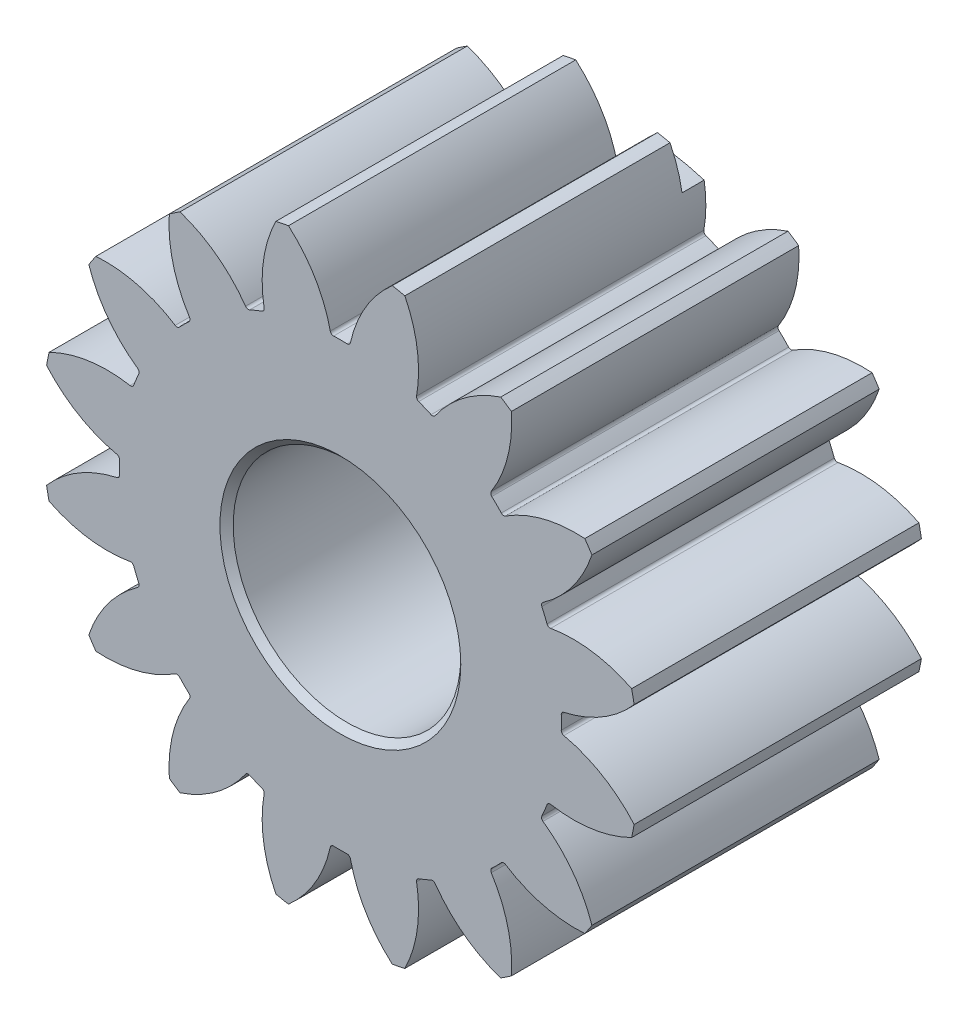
ISO-10303-21;
HEADER;
FILE_DESCRIPTION(('STEP AP214'),'2;1');
FILE_NAME('part.step','',(''),(''),'','','');
FILE_SCHEMA(('AUTOMOTIVE_DESIGN { 1 0 10303 214 1 1 1 1 }'));
ENDSEC;
DATA;
#1=APPLICATION_CONTEXT('core data for automotive mechanical design processes');
#2=APPLICATION_PROTOCOL_DEFINITION('international standard','automotive_design',2000,#1);
#3=PRODUCT_CONTEXT('',#1,'mechanical');
#4=PRODUCT('Part','Part','',(#3));
#5=PRODUCT_RELATED_PRODUCT_CATEGORY('part','',(#4));
#6=PRODUCT_DEFINITION_FORMATION('','',#4);
#7=PRODUCT_DEFINITION_CONTEXT('part definition',#1,'design');
#8=PRODUCT_DEFINITION('design','',#6,#7);
#9=PRODUCT_DEFINITION_SHAPE('','',#8);
#10=(LENGTH_UNIT() NAMED_UNIT(*) SI_UNIT(.MILLI.,.METRE.));
#11=(NAMED_UNIT(*) PLANE_ANGLE_UNIT() SI_UNIT($,.RADIAN.));
#12=(NAMED_UNIT(*) SI_UNIT($,.STERADIAN.) SOLID_ANGLE_UNIT());
#13=UNCERTAINTY_MEASURE_WITH_UNIT(LENGTH_MEASURE(1.E-05),#10,'distance_accuracy_value','');
#14=(GEOMETRIC_REPRESENTATION_CONTEXT(3) GLOBAL_UNCERTAINTY_ASSIGNED_CONTEXT((#13)) GLOBAL_UNIT_ASSIGNED_CONTEXT((#10,
#11,#12)) REPRESENTATION_CONTEXT('',''));
#15=CARTESIAN_POINT('',(0.,0.,0.));
#16=DIRECTION('',(0.,0.,1.));
#17=DIRECTION('',(1.,0.,0.));
#18=AXIS2_PLACEMENT_3D('',#15,#16,#17);
#19=CARTESIAN_POINT('',(0.,0.,13.));
#20=DIRECTION('',(0.,0.,-1.));
#21=DIRECTION('',(-1.,0.,0.));
#22=AXIS2_PLACEMENT_3D('',#19,#20,#21);
#23=CYLINDRICAL_SURFACE('',#22,13.5);
#24=CARTESIAN_POINT('',(0.,0.,0.999999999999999));
#25=DIRECTION('',(0.,0.,-1.));
#26=DIRECTION('',(-1.,0.,0.));
#27=AXIS2_PLACEMENT_3D('',#24,#25,#26);
#28=CIRCLE('',#27,13.5);
#29=CARTESIAN_POINT('',(2.34856400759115,13.2941433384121,0.999999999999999));
#30=VERTEX_POINT('',#29);
#31=CARTESIAN_POINT('',(2.91765818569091,13.1809434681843,1.));
#32=VERTEX_POINT('',#31);
#33=EDGE_CURVE('E49',#30,#32,#28,.T.);
#34=ORIENTED_EDGE('',*,*,#33,.F.);
#35=DIRECTION('',(0.,0.,-1.));
#36=VECTOR('',#35,1.);
#37=CARTESIAN_POINT('',(2.34856400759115,13.2941433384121,13.));
#38=LINE('',#37,#36);
#39=CARTESIAN_POINT('',(2.34856400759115,13.2941433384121,13.));
#40=VERTEX_POINT('',#39);
#41=EDGE_CURVE('E746',#40,#30,#38,.T.);
#42=ORIENTED_EDGE('',*,*,#41,.F.);
#43=CARTESIAN_POINT('',(0.,0.,13.));
#44=DIRECTION('',(0.,0.,1.));
#45=DIRECTION('',(1.,0.,0.));
#46=AXIS2_PLACEMENT_3D('',#43,#44,#45);
#47=CIRCLE('',#46,13.5);
#48=CARTESIAN_POINT('',(2.91765818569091,13.1809434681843,13.));
#49=VERTEX_POINT('',#48);
#50=EDGE_CURVE('E754',#49,#40,#47,.T.);
#51=ORIENTED_EDGE('',*,*,#50,.F.);
#52=DIRECTION('',(0.,0.,-1.));
#53=VECTOR('',#52,1.);
#54=CARTESIAN_POINT('',(2.91765818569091,13.1809434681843,13.));
#55=LINE('',#54,#53);
#56=EDGE_CURVE('E695',#49,#32,#55,.T.);
#57=ORIENTED_EDGE('',*,*,#56,.T.);
#58=EDGE_LOOP('',(#34,#42,#51,#57));
#59=FACE_BOUND('',#58,.T.);
#60=ADVANCED_FACE('F34',(#59),#23,.T.);
#61=CARTESIAN_POINT('',(-7.25723862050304,11.3834303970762,13.));
#62=VERTEX_POINT('',#61);
#63=CARTESIAN_POINT('',(-7.73969336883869,11.0610644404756,13.));
#64=VERTEX_POINT('',#63);
#65=EDGE_CURVE('E760',#62,#64,#47,.T.);
#66=ORIENTED_EDGE('',*,*,#65,.F.);
#67=DIRECTION('',(0.,0.,-1.));
#68=VECTOR('',#67,1.);
#69=CARTESIAN_POINT('',(-7.25723862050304,11.3834303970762,13.));
#70=LINE('',#69,#68);
#71=CARTESIAN_POINT('',(-7.25723862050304,11.3834303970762,0.));
#72=VERTEX_POINT('',#71);
#73=EDGE_CURVE('E1722',#62,#72,#70,.T.);
#74=ORIENTED_EDGE('',*,*,#73,.T.);
#75=CARTESIAN_POINT('',(0.,0.,0.));
#76=DIRECTION('',(0.,0.,1.));
#77=DIRECTION('',(1.,0.,0.));
#78=AXIS2_PLACEMENT_3D('',#75,#76,#77);
#79=CIRCLE('',#78,13.5);
#80=CARTESIAN_POINT('',(-7.73969336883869,11.0610644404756,0.));
#81=VERTEX_POINT('',#80);
#82=EDGE_CURVE('E755',#72,#81,#79,.T.);
#83=ORIENTED_EDGE('',*,*,#82,.T.);
#84=DIRECTION('',(0.,0.,-1.));
#85=VECTOR('',#84,1.);
#86=CARTESIAN_POINT('',(-7.73969336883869,11.0610644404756,13.));
#87=LINE('',#86,#85);
#88=EDGE_CURVE('E860',#64,#81,#87,.T.);
#89=ORIENTED_EDGE('',*,*,#88,.F.);
#90=EDGE_LOOP('',(#66,#74,#83,#89));
#91=FACE_BOUND('',#90,.T.);
#92=ADVANCED_FACE('F866',(#91),#23,.T.);
#93=CARTESIAN_POINT('',(-11.0610644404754,7.73969336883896,13.));
#94=VERTEX_POINT('',#93);
#95=CARTESIAN_POINT('',(-11.3834303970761,7.25723862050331,13.));
#96=VERTEX_POINT('',#95);
#97=EDGE_CURVE('E833',#94,#96,#47,.T.);
#98=ORIENTED_EDGE('',*,*,#97,.F.);
#99=DIRECTION('',(0.,0.,-1.));
#100=VECTOR('',#99,1.);
#101=CARTESIAN_POINT('',(-11.0610644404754,7.73969336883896,13.));
#102=LINE('',#101,#100);
#103=CARTESIAN_POINT('',(-11.0610644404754,7.73969336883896,0.));
#104=VERTEX_POINT('',#103);
#105=EDGE_CURVE('E874',#94,#104,#102,.T.);
#106=ORIENTED_EDGE('',*,*,#105,.T.);
#107=CARTESIAN_POINT('',(-11.3834303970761,7.25723862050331,0.));
#108=VERTEX_POINT('',#107);
#109=EDGE_CURVE('E1442',#104,#108,#79,.T.);
#110=ORIENTED_EDGE('',*,*,#109,.T.);
#111=DIRECTION('',(0.,0.,-1.));
#112=VECTOR('',#111,1.);
#113=CARTESIAN_POINT('',(-11.3834303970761,7.25723862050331,13.));
#114=LINE('',#113,#112);
#115=EDGE_CURVE('E940',#96,#108,#114,.T.);
#116=ORIENTED_EDGE('',*,*,#115,.F.);
#117=EDGE_LOOP('',(#98,#106,#110,#116));
#118=FACE_BOUND('',#117,.T.);
#119=ADVANCED_FACE('F1450',(#118),#23,.T.);
#120=CARTESIAN_POINT('',(-13.1809434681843,2.91765818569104,13.));
#121=VERTEX_POINT('',#120);
#122=CARTESIAN_POINT('',(-13.2941433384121,2.34856400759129,13.));
#123=VERTEX_POINT('',#122);
#124=EDGE_CURVE('E828',#121,#123,#47,.T.);
#125=ORIENTED_EDGE('',*,*,#124,.F.);
#126=DIRECTION('',(0.,0.,-1.));
#127=VECTOR('',#126,1.);
#128=CARTESIAN_POINT('',(-13.1809434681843,2.91765818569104,13.));
#129=LINE('',#128,#127);
#130=CARTESIAN_POINT('',(-13.1809434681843,2.91765818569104,0.));
#131=VERTEX_POINT('',#130);
#132=EDGE_CURVE('E930',#121,#131,#129,.T.);
#133=ORIENTED_EDGE('',*,*,#132,.T.);
#134=CARTESIAN_POINT('',(-13.2941433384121,2.34856400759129,0.));
#135=VERTEX_POINT('',#134);
#136=EDGE_CURVE('E1438',#131,#135,#79,.T.);
#137=ORIENTED_EDGE('',*,*,#136,.T.);
#138=DIRECTION('',(0.,0.,-1.));
#139=VECTOR('',#138,1.);
#140=CARTESIAN_POINT('',(-13.2941433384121,2.34856400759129,13.));
#141=LINE('',#140,#139);
#142=EDGE_CURVE('E981',#123,#135,#141,.T.);
#143=ORIENTED_EDGE('',*,*,#142,.F.);
#144=EDGE_LOOP('',(#125,#133,#137,#143));
#145=FACE_BOUND('',#144,.T.);
#146=ADVANCED_FACE('F1471',(#145),#23,.T.);
#147=CARTESIAN_POINT('',(-13.2941433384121,-2.34856400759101,13.));
#148=VERTEX_POINT('',#147);
#149=CARTESIAN_POINT('',(-13.1809434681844,-2.91765818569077,13.));
#150=VERTEX_POINT('',#149);
#151=EDGE_CURVE('E823',#148,#150,#47,.T.);
#152=ORIENTED_EDGE('',*,*,#151,.F.);
#153=DIRECTION('',(0.,0.,-1.));
#154=VECTOR('',#153,1.);
#155=CARTESIAN_POINT('',(-13.2941433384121,-2.34856400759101,13.));
#156=LINE('',#155,#154);
#157=CARTESIAN_POINT('',(-13.2941433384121,-2.34856400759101,0.));
#158=VERTEX_POINT('',#157);
#159=EDGE_CURVE('E971',#148,#158,#156,.T.);
#160=ORIENTED_EDGE('',*,*,#159,.T.);
#161=CARTESIAN_POINT('',(-13.1809434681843,-2.91765818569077,0.));
#162=VERTEX_POINT('',#161);
#163=EDGE_CURVE('E1434',#158,#162,#79,.T.);
#164=ORIENTED_EDGE('',*,*,#163,.T.);
#165=DIRECTION('',(0.,0.,-1.));
#166=VECTOR('',#165,1.);
#167=CARTESIAN_POINT('',(-13.1809434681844,-2.91765818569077,13.));
#168=LINE('',#167,#166);
#169=EDGE_CURVE('E990',#150,#162,#168,.T.);
#170=ORIENTED_EDGE('',*,*,#169,.F.);
#171=EDGE_LOOP('',(#152,#160,#164,#170));
#172=FACE_BOUND('',#171,.T.);
#173=ADVANCED_FACE('F1491',(#172),#23,.T.);
#174=CARTESIAN_POINT('',(-11.3834303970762,-7.25723862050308,13.));
#175=VERTEX_POINT('',#174);
#176=CARTESIAN_POINT('',(-11.0610644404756,-7.73969336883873,13.));
#177=VERTEX_POINT('',#176);
#178=EDGE_CURVE('E818',#175,#177,#47,.T.);
#179=ORIENTED_EDGE('',*,*,#178,.F.);
#180=DIRECTION('',(0.,0.,-1.));
#181=VECTOR('',#180,1.);
#182=CARTESIAN_POINT('',(-11.3834303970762,-7.25723862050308,13.));
#183=LINE('',#182,#181);
#184=CARTESIAN_POINT('',(-11.3834303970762,-7.25723862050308,0.));
#185=VERTEX_POINT('',#184);
#186=EDGE_CURVE('E986',#175,#185,#183,.T.);
#187=ORIENTED_EDGE('',*,*,#186,.T.);
#188=CARTESIAN_POINT('',(-11.0610644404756,-7.73969336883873,0.));
#189=VERTEX_POINT('',#188);
#190=EDGE_CURVE('E1430',#185,#189,#79,.T.);
#191=ORIENTED_EDGE('',*,*,#190,.T.);
#192=DIRECTION('',(0.,0.,-1.));
#193=VECTOR('',#192,1.);
#194=CARTESIAN_POINT('',(-11.0610644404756,-7.73969336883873,13.));
#195=LINE('',#194,#193);
#196=EDGE_CURVE('E1031',#177,#189,#195,.T.);
#197=ORIENTED_EDGE('',*,*,#196,.F.);
#198=EDGE_LOOP('',(#179,#187,#191,#197));
#199=FACE_BOUND('',#198,.T.);
#200=ADVANCED_FACE('F1511',(#199),#23,.T.);
#201=CARTESIAN_POINT('',(-7.73969336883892,-11.0610644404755,13.));
#202=VERTEX_POINT('',#201);
#203=CARTESIAN_POINT('',(-7.25723862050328,-11.3834303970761,13.));
#204=VERTEX_POINT('',#203);
#205=EDGE_CURVE('E813',#202,#204,#47,.T.);
#206=ORIENTED_EDGE('',*,*,#205,.F.);
#207=DIRECTION('',(0.,0.,-1.));
#208=VECTOR('',#207,1.);
#209=CARTESIAN_POINT('',(-7.73969336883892,-11.0610644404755,13.));
#210=LINE('',#209,#208);
#211=CARTESIAN_POINT('',(-7.73969336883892,-11.0610644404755,0.));
#212=VERTEX_POINT('',#211);
#213=EDGE_CURVE('E1027',#202,#212,#210,.T.);
#214=ORIENTED_EDGE('',*,*,#213,.T.);
#215=CARTESIAN_POINT('',(-7.25723862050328,-11.3834303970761,0.));
#216=VERTEX_POINT('',#215);
#217=EDGE_CURVE('E1426',#212,#216,#79,.T.);
#218=ORIENTED_EDGE('',*,*,#217,.T.);
#219=DIRECTION('',(0.,0.,-1.));
#220=VECTOR('',#219,1.);
#221=CARTESIAN_POINT('',(-7.25723862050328,-11.3834303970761,13.));
#222=LINE('',#221,#220);
#223=EDGE_CURVE('E1104',#204,#216,#222,.T.);
#224=ORIENTED_EDGE('',*,*,#223,.F.);
#225=EDGE_LOOP('',(#206,#214,#218,#224));
#226=FACE_BOUND('',#225,.T.);
#227=ADVANCED_FACE('F1531',(#226),#23,.T.);
#228=CARTESIAN_POINT('',(-2.917658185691,-13.1809434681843,13.));
#229=VERTEX_POINT('',#228);
#230=CARTESIAN_POINT('',(-2.34856400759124,-13.2941433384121,13.));
#231=VERTEX_POINT('',#230);
#232=EDGE_CURVE('E808',#229,#231,#47,.T.);
#233=ORIENTED_EDGE('',*,*,#232,.F.);
#234=DIRECTION('',(0.,0.,-1.));
#235=VECTOR('',#234,1.);
#236=CARTESIAN_POINT('',(-2.917658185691,-13.1809434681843,13.));
#237=LINE('',#236,#235);
#238=CARTESIAN_POINT('',(-2.917658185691,-13.1809434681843,0.));
#239=VERTEX_POINT('',#238);
#240=EDGE_CURVE('E1094',#229,#239,#237,.T.);
#241=ORIENTED_EDGE('',*,*,#240,.T.);
#242=CARTESIAN_POINT('',(-2.34856400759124,-13.2941433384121,0.));
#243=VERTEX_POINT('',#242);
#244=EDGE_CURVE('E1422',#239,#243,#79,.T.);
#245=ORIENTED_EDGE('',*,*,#244,.T.);
#246=DIRECTION('',(0.,0.,-1.));
#247=VECTOR('',#246,1.);
#248=CARTESIAN_POINT('',(-2.34856400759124,-13.2941433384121,13.));
#249=LINE('',#248,#247);
#250=EDGE_CURVE('E1145',#231,#243,#249,.T.);
#251=ORIENTED_EDGE('',*,*,#250,.F.);
#252=EDGE_LOOP('',(#233,#241,#245,#251));
#253=FACE_BOUND('',#252,.T.);
#254=ADVANCED_FACE('F1551',(#253),#23,.T.);
#255=CARTESIAN_POINT('',(2.34856400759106,-13.2941433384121,13.));
#256=VERTEX_POINT('',#255);
#257=CARTESIAN_POINT('',(2.91765818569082,-13.1809434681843,13.));
#258=VERTEX_POINT('',#257);
#259=EDGE_CURVE('E803',#256,#258,#47,.T.);
#260=ORIENTED_EDGE('',*,*,#259,.F.);
#261=DIRECTION('',(0.,0.,-1.));
#262=VECTOR('',#261,1.);
#263=CARTESIAN_POINT('',(2.34856400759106,-13.2941433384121,13.));
#264=LINE('',#263,#262);
#265=CARTESIAN_POINT('',(2.34856400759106,-13.2941433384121,0.));
#266=VERTEX_POINT('',#265);
#267=EDGE_CURVE('E1135',#256,#266,#264,.T.);
#268=ORIENTED_EDGE('',*,*,#267,.T.);
#269=CARTESIAN_POINT('',(2.91765818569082,-13.1809434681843,0.));
#270=VERTEX_POINT('',#269);
#271=EDGE_CURVE('E1418',#266,#270,#79,.T.);
#272=ORIENTED_EDGE('',*,*,#271,.T.);
#273=DIRECTION('',(0.,0.,-1.));
#274=VECTOR('',#273,1.);
#275=CARTESIAN_POINT('',(2.91765818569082,-13.1809434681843,13.));
#276=LINE('',#275,#274);
#277=EDGE_CURVE('E1154',#258,#270,#276,.T.);
#278=ORIENTED_EDGE('',*,*,#277,.F.);
#279=EDGE_LOOP('',(#260,#268,#272,#278));
#280=FACE_BOUND('',#279,.T.);
#281=ADVANCED_FACE('F1571',(#280),#23,.T.);
#282=CARTESIAN_POINT('',(7.25723862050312,-11.3834303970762,13.));
#283=VERTEX_POINT('',#282);
#284=CARTESIAN_POINT('',(7.73969336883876,-11.0610644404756,13.));
#285=VERTEX_POINT('',#284);
#286=EDGE_CURVE('E798',#283,#285,#47,.T.);
#287=ORIENTED_EDGE('',*,*,#286,.F.);
#288=DIRECTION('',(0.,0.,-1.));
#289=VECTOR('',#288,1.);
#290=CARTESIAN_POINT('',(7.25723862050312,-11.3834303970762,13.));
#291=LINE('',#290,#289);
#292=CARTESIAN_POINT('',(7.25723862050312,-11.3834303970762,0.));
#293=VERTEX_POINT('',#292);
#294=EDGE_CURVE('E1150',#283,#293,#291,.T.);
#295=ORIENTED_EDGE('',*,*,#294,.T.);
#296=CARTESIAN_POINT('',(7.73969336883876,-11.0610644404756,0.));
#297=VERTEX_POINT('',#296);
#298=EDGE_CURVE('E1414',#293,#297,#79,.T.);
#299=ORIENTED_EDGE('',*,*,#298,.T.);
#300=DIRECTION('',(0.,0.,-1.));
#301=VECTOR('',#300,1.);
#302=CARTESIAN_POINT('',(7.73969336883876,-11.0610644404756,13.));
#303=LINE('',#302,#301);
#304=EDGE_CURVE('E1195',#285,#297,#303,.T.);
#305=ORIENTED_EDGE('',*,*,#304,.F.);
#306=EDGE_LOOP('',(#287,#295,#299,#305));
#307=FACE_BOUND('',#306,.T.);
#308=ADVANCED_FACE('F1591',(#307),#23,.T.);
#309=CARTESIAN_POINT('',(11.0610644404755,-7.73969336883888,13.));
#310=VERTEX_POINT('',#309);
#311=CARTESIAN_POINT('',(11.3834303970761,-7.25723862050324,13.));
#312=VERTEX_POINT('',#311);
#313=EDGE_CURVE('E793',#310,#312,#47,.T.);
#314=ORIENTED_EDGE('',*,*,#313,.F.);
#315=DIRECTION('',(0.,0.,-1.));
#316=VECTOR('',#315,1.);
#317=CARTESIAN_POINT('',(11.0610644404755,-7.73969336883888,13.));
#318=LINE('',#317,#316);
#319=CARTESIAN_POINT('',(11.0610644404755,-7.73969336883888,0.));
#320=VERTEX_POINT('',#319);
#321=EDGE_CURVE('E1191',#310,#320,#318,.T.);
#322=ORIENTED_EDGE('',*,*,#321,.T.);
#323=CARTESIAN_POINT('',(11.3834303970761,-7.25723862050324,0.));
#324=VERTEX_POINT('',#323);
#325=EDGE_CURVE('E1410',#320,#324,#79,.T.);
#326=ORIENTED_EDGE('',*,*,#325,.T.);
#327=DIRECTION('',(0.,0.,-1.));
#328=VECTOR('',#327,1.);
#329=CARTESIAN_POINT('',(11.3834303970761,-7.25723862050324,13.));
#330=LINE('',#329,#328);
#331=EDGE_CURVE('E1268',#312,#324,#330,.T.);
#332=ORIENTED_EDGE('',*,*,#331,.F.);
#333=EDGE_LOOP('',(#314,#322,#326,#332));
#334=FACE_BOUND('',#333,.T.);
#335=ADVANCED_FACE('F1611',(#334),#23,.T.);
#336=CARTESIAN_POINT('',(13.1809434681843,-2.91765818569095,13.));
#337=VERTEX_POINT('',#336);
#338=CARTESIAN_POINT('',(13.2941433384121,-2.3485640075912,13.));
#339=VERTEX_POINT('',#338);
#340=EDGE_CURVE('E788',#337,#339,#47,.T.);
#341=ORIENTED_EDGE('',*,*,#340,.F.);
#342=DIRECTION('',(0.,0.,-1.));
#343=VECTOR('',#342,1.);
#344=CARTESIAN_POINT('',(13.1809434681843,-2.91765818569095,13.));
#345=LINE('',#344,#343);
#346=CARTESIAN_POINT('',(13.1809434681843,-2.91765818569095,0.));
#347=VERTEX_POINT('',#346);
#348=EDGE_CURVE('E1258',#337,#347,#345,.T.);
#349=ORIENTED_EDGE('',*,*,#348,.T.);
#350=CARTESIAN_POINT('',(13.2941433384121,-2.3485640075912,0.));
#351=VERTEX_POINT('',#350);
#352=EDGE_CURVE('E1406',#347,#351,#79,.T.);
#353=ORIENTED_EDGE('',*,*,#352,.T.);
#354=DIRECTION('',(0.,0.,-1.));
#355=VECTOR('',#354,1.);
#356=CARTESIAN_POINT('',(13.2941433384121,-2.3485640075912,13.));
#357=LINE('',#356,#355);
#358=EDGE_CURVE('E1309',#339,#351,#357,.T.);
#359=ORIENTED_EDGE('',*,*,#358,.F.);
#360=EDGE_LOOP('',(#341,#349,#353,#359));
#361=FACE_BOUND('',#360,.T.);
#362=ADVANCED_FACE('F1631',(#361),#23,.T.);
#363=CARTESIAN_POINT('',(13.2941433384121,2.3485640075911,13.));
#364=VERTEX_POINT('',#363);
#365=CARTESIAN_POINT('',(13.1809434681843,2.91765818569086,13.));
#366=VERTEX_POINT('',#365);
#367=EDGE_CURVE('E783',#364,#366,#47,.T.);
#368=ORIENTED_EDGE('',*,*,#367,.F.);
#369=DIRECTION('',(0.,0.,-1.));
#370=VECTOR('',#369,1.);
#371=CARTESIAN_POINT('',(13.2941433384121,2.3485640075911,13.));
#372=LINE('',#371,#370);
#373=CARTESIAN_POINT('',(13.2941433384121,2.3485640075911,0.));
#374=VERTEX_POINT('',#373);
#375=EDGE_CURVE('E1299',#364,#374,#372,.T.);
#376=ORIENTED_EDGE('',*,*,#375,.T.);
#377=CARTESIAN_POINT('',(13.1809434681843,2.91765818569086,0.));
#378=VERTEX_POINT('',#377);
#379=EDGE_CURVE('E1402',#374,#378,#79,.T.);
#380=ORIENTED_EDGE('',*,*,#379,.T.);
#381=DIRECTION('',(0.,0.,-1.));
#382=VECTOR('',#381,1.);
#383=CARTESIAN_POINT('',(13.1809434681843,2.91765818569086,13.));
#384=LINE('',#383,#382);
#385=EDGE_CURVE('E1318',#366,#378,#384,.T.);
#386=ORIENTED_EDGE('',*,*,#385,.F.);
#387=EDGE_LOOP('',(#368,#376,#380,#386));
#388=FACE_BOUND('',#387,.T.);
#389=ADVANCED_FACE('F1651',(#388),#23,.T.);
#390=CARTESIAN_POINT('',(11.3834303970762,7.25723862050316,13.));
#391=VERTEX_POINT('',#390);
#392=CARTESIAN_POINT('',(11.0610644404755,7.7396933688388,13.));
#393=VERTEX_POINT('',#392);
#394=EDGE_CURVE('E779',#391,#393,#47,.T.);
#395=ORIENTED_EDGE('',*,*,#394,.F.);
#396=DIRECTION('',(0.,0.,-1.));
#397=VECTOR('',#396,1.);
#398=CARTESIAN_POINT('',(11.3834303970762,7.25723862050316,13.));
#399=LINE('',#398,#397);
#400=CARTESIAN_POINT('',(11.3834303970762,7.25723862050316,0.));
#401=VERTEX_POINT('',#400);
#402=EDGE_CURVE('E1314',#391,#401,#399,.T.);
#403=ORIENTED_EDGE('',*,*,#402,.T.);
#404=CARTESIAN_POINT('',(11.0610644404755,7.7396933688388,0.));
#405=VERTEX_POINT('',#404);
#406=EDGE_CURVE('E1401',#401,#405,#79,.T.);
#407=ORIENTED_EDGE('',*,*,#406,.T.);
#408=DIRECTION('',(0.,0.,-1.));
#409=VECTOR('',#408,1.);
#410=CARTESIAN_POINT('',(11.0610644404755,7.7396933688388,13.));
#411=LINE('',#410,#409);
#412=EDGE_CURVE('E1359',#393,#405,#411,.T.);
#413=ORIENTED_EDGE('',*,*,#412,.F.);
#414=EDGE_LOOP('',(#395,#403,#407,#413));
#415=FACE_BOUND('',#414,.T.);
#416=ADVANCED_FACE('F1671',(#415),#23,.T.);
#417=CARTESIAN_POINT('',(7.73969336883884,11.0610644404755,13.));
#418=VERTEX_POINT('',#417);
#419=CARTESIAN_POINT('',(7.2572386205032,11.3834303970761,13.));
#420=VERTEX_POINT('',#419);
#421=EDGE_CURVE('E778',#418,#420,#47,.T.);
#422=ORIENTED_EDGE('',*,*,#421,.F.);
#423=DIRECTION('',(0.,0.,-1.));
#424=VECTOR('',#423,1.);
#425=CARTESIAN_POINT('',(7.73969336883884,11.0610644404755,13.));
#426=LINE('',#425,#424);
#427=CARTESIAN_POINT('',(7.73969336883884,11.0610644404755,0.));
#428=VERTEX_POINT('',#427);
#429=EDGE_CURVE('E1355',#418,#428,#426,.T.);
#430=ORIENTED_EDGE('',*,*,#429,.T.);
#431=CARTESIAN_POINT('',(7.2572386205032,11.3834303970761,0.));
#432=VERTEX_POINT('',#431);
#433=EDGE_CURVE('E738',#428,#432,#79,.T.);
#434=ORIENTED_EDGE('',*,*,#433,.T.);
#435=DIRECTION('',(0.,0.,-1.));
#436=VECTOR('',#435,1.);
#437=CARTESIAN_POINT('',(7.2572386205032,11.3834303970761,13.));
#438=LINE('',#437,#436);
#439=EDGE_CURVE('E704',#420,#432,#438,.T.);
#440=ORIENTED_EDGE('',*,*,#439,.F.);
#441=EDGE_LOOP('',(#422,#430,#434,#440));
#442=FACE_BOUND('',#441,.T.);
#443=ADVANCED_FACE('F1397',(#442),#23,.T.);
#444=CARTESIAN_POINT('',(-2.34856400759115,13.2941433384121,0.));
#445=VERTEX_POINT('',#444);
#446=CARTESIAN_POINT('',(-2.91765818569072,13.1809434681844,0.));
#447=VERTEX_POINT('',#446);
#448=EDGE_CURVE('E751',#445,#447,#79,.T.);
#449=ORIENTED_EDGE('',*,*,#448,.T.);
#450=DIRECTION('',(0.,0.,-1.));
#451=VECTOR('',#450,1.);
#452=CARTESIAN_POINT('',(-2.91765818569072,13.1809434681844,13.));
#453=LINE('',#452,#451);
#454=CARTESIAN_POINT('',(-2.91765818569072,13.1809434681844,13.));
#455=VERTEX_POINT('',#454);
#456=EDGE_CURVE('E57',#455,#447,#453,.T.);
#457=ORIENTED_EDGE('',*,*,#456,.F.);
#458=CARTESIAN_POINT('',(-2.34856400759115,13.2941433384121,13.));
#459=VERTEX_POINT('',#458);
#460=EDGE_CURVE('E756',#459,#455,#47,.T.);
#461=ORIENTED_EDGE('',*,*,#460,.F.);
#462=DIRECTION('',(0.,0.,-1.));
#463=VECTOR('',#462,1.);
#464=CARTESIAN_POINT('',(-2.34856400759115,13.2941433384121,13.));
#465=LINE('',#464,#463);
#466=EDGE_CURVE('E735',#459,#445,#465,.T.);
#467=ORIENTED_EDGE('',*,*,#466,.T.);
#468=EDGE_LOOP('',(#449,#457,#461,#467));
#469=FACE_BOUND('',#468,.T.);
#470=ADVANCED_FACE('F36',(#469),#23,.T.);
#471=CARTESIAN_POINT('',(0.,0.,13.));
#472=DIRECTION('',(0.,0.,1.));
#473=DIRECTION('',(1.,0.,0.));
#474=AXIS2_PLACEMENT_3D('',#471,#472,#473);
#475=PLANE('',#474);
#476=CARTESIAN_POINT('',(-9.13164220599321,5.77871550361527,13.));
#477=DIRECTION('',(0.,0.,1.));
#478=DIRECTION('',(-0.923879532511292,-0.382683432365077,0.));
#479=AXIS2_PLACEMENT_3D('',#476,#477,#478);
#480=CIRCLE('',#479,5.90984076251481);
#481=CARTESIAN_POINT('',(-4.29077932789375,9.1687397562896,13.));
#482=VERTEX_POINT('',#481);
#483=EDGE_CURVE('E852',#482,#62,#480,.T.);
#484=ORIENTED_EDGE('',*,*,#483,.T.);
#485=ORIENTED_EDGE('',*,*,#65,.T.);
#486=CARTESIAN_POINT('',(-1.84430879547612,10.6479560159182,13.));
#487=DIRECTION('',(0.,0.,1.));
#488=DIRECTION('',(0.707106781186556,0.707106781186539,0.));
#489=AXIS2_PLACEMENT_3D('',#486,#487,#488);
#490=CIRCLE('',#489,5.90984076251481);
#491=CARTESIAN_POINT('',(-6.82880083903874,7.47288799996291,13.));
#492=VERTEX_POINT('',#491);
#493=EDGE_CURVE('E849',#64,#492,#490,.T.);
#494=ORIENTED_EDGE('',*,*,#493,.T.);
#495=CARTESIAN_POINT('',(-6.95531419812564,7.3923003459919,13.));
#496=DIRECTION('',(0.,0.,-1.));
#497=DIRECTION('',(0.707106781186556,0.707106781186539,0.));
#498=AXIS2_PLACEMENT_3D('',#495,#496,#497);
#499=CIRCLE('',#498,0.150000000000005);
#500=CARTESIAN_POINT('',(-6.85252630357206,7.28305452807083,13.));
#501=VERTEX_POINT('',#500);
#502=EDGE_CURVE('E878',#492,#501,#499,.T.);
#503=ORIENTED_EDGE('',*,*,#502,.T.);
#504=CARTESIAN_POINT('',(0.,0.,13.));
#505=DIRECTION('',(0.,0.,1.));
#506=DIRECTION('',(-0.707106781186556,-0.707106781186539,0.));
#507=AXIS2_PLACEMENT_3D('',#504,#505,#506);
#508=CIRCLE('',#507,10.);
#509=CARTESIAN_POINT('',(-7.28305452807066,6.85252630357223,13.));
#510=VERTEX_POINT('',#509);
#511=EDGE_CURVE('E881',#501,#510,#508,.T.);
#512=ORIENTED_EDGE('',*,*,#511,.T.);
#513=CARTESIAN_POINT('',(-7.39230034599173,6.95531419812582,13.));
#514=DIRECTION('',(0.,0.,-1.));
#515=DIRECTION('',(0.707106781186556,0.707106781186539,0.));
#516=AXIS2_PLACEMENT_3D('',#513,#514,#515);
#517=CIRCLE('',#516,0.150000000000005);
#518=CARTESIAN_POINT('',(-7.47288799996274,6.82880083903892,13.));
#519=VERTEX_POINT('',#518);
#520=EDGE_CURVE('E884',#510,#519,#517,.T.);
#521=ORIENTED_EDGE('',*,*,#520,.T.);
#522=CARTESIAN_POINT('',(-10.6479560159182,1.84430879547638,13.));
#523=DIRECTION('',(0.,0.,1.));
#524=DIRECTION('',(-0.707106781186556,-0.707106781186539,0.));
#525=AXIS2_PLACEMENT_3D('',#522,#523,#524);
#526=CIRCLE('',#525,5.90984076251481);
#527=EDGE_CURVE('E890',#519,#94,#526,.T.);
#528=ORIENTED_EDGE('',*,*,#527,.T.);
#529=ORIENTED_EDGE('',*,*,#97,.T.);
#530=CARTESIAN_POINT('',(-5.77871550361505,9.13164220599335,13.));
#531=DIRECTION('',(0.,0.,1.));
#532=DIRECTION('',(0.3826834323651,0.923879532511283,0.));
#533=AXIS2_PLACEMENT_3D('',#530,#531,#532);
#534=CIRCLE('',#533,5.90984076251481);
#535=CARTESIAN_POINT('',(-9.1687397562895,4.29077932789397,13.));
#536=VERTEX_POINT('',#535);
#537=EDGE_CURVE('E919',#96,#536,#534,.T.);
#538=ORIENTED_EDGE('',*,*,#537,.T.);
#539=CARTESIAN_POINT('',(-9.25478329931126,4.16791147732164,13.));
#540=DIRECTION('',(0.,0.,-1.));
#541=DIRECTION('',(0.3826834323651,0.923879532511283,0.));
#542=AXIS2_PLACEMENT_3D('',#539,#540,#541);
#543=CIRCLE('',#542,0.150000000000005);
#544=CARTESIAN_POINT('',(-9.11801310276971,4.10631672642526,13.));
#545=VERTEX_POINT('',#544);
#546=EDGE_CURVE('E921',#536,#545,#543,.T.);
#547=ORIENTED_EDGE('',*,*,#546,.T.);
#548=CARTESIAN_POINT('',(0.,0.,13.));
#549=DIRECTION('',(0.,0.,1.));
#550=DIRECTION('',(-0.3826834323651,-0.923879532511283,0.));
#551=AXIS2_PLACEMENT_3D('',#548,#549,#550);
#552=CIRCLE('',#551,10.);
#553=CARTESIAN_POINT('',(-9.35101329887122,3.54380449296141,13.));
#554=VERTEX_POINT('',#553);
#555=EDGE_CURVE('E924',#545,#554,#552,.T.);
#556=ORIENTED_EDGE('',*,*,#555,.T.);
#557=CARTESIAN_POINT('',(-9.4912784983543,3.59696156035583,13.));
#558=DIRECTION('',(0.,0.,-1.));
#559=DIRECTION('',(0.3826834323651,0.923879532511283,0.));
#560=AXIS2_PLACEMENT_3D('',#557,#558,#559);
#561=CIRCLE('',#560,0.150000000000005);
#562=CARTESIAN_POINT('',(-9.51731721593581,3.44923889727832,13.));
#563=VERTEX_POINT('',#562);
#564=EDGE_CURVE('E927',#554,#563,#561,.T.);
#565=ORIENTED_EDGE('',*,*,#564,.T.);
#566=CARTESIAN_POINT('',(-10.5432150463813,-2.37087720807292,13.));
#567=DIRECTION('',(0.,0.,1.));
#568=DIRECTION('',(-0.3826834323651,-0.923879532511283,0.));
#569=AXIS2_PLACEMENT_3D('',#566,#567,#568);
#570=CIRCLE('',#569,5.90984076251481);
#571=EDGE_CURVE('E917',#563,#121,#570,.T.);
#572=ORIENTED_EDGE('',*,*,#571,.T.);
#573=ORIENTED_EDGE('',*,*,#124,.T.);
#574=CARTESIAN_POINT('',(-8.83336516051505,6.22511864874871,13.));
#575=DIRECTION('',(0.,0.,1.));
#576=DIRECTION('',(0.,1.,0.));
#577=AXIS2_PLACEMENT_3D('',#574,#575,#576);
#578=CIRCLE('',#577,5.90984076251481);
#579=CARTESIAN_POINT('',(-10.112821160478,0.455438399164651,13.));
#580=VERTEX_POINT('',#579);
#581=EDGE_CURVE('E960',#123,#580,#578,.T.);
#582=ORIENTED_EDGE('',*,*,#581,.T.);
#583=CARTESIAN_POINT('',(-10.1452955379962,0.308995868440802,13.));
#584=DIRECTION('',(0.,0.,-1.));
#585=DIRECTION('',(0.,1.,0.));
#586=AXIS2_PLACEMENT_3D('',#583,#584,#585);
#587=CIRCLE('',#586,0.150000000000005);
#588=CARTESIAN_POINT('',(-9.99536506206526,0.304429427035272,13.));
#589=VERTEX_POINT('',#588);
#590=EDGE_CURVE('E962',#580,#589,#587,.T.);
#591=ORIENTED_EDGE('',*,*,#590,.T.);
#592=CARTESIAN_POINT('',(0.,0.,13.));
#593=DIRECTION('',(0.,0.,1.));
#594=DIRECTION('',(0.,-1.,0.));
#595=AXIS2_PLACEMENT_3D('',#592,#593,#594);
#596=CIRCLE('',#595,10.);
#597=CARTESIAN_POINT('',(-9.99536506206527,-0.304429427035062,13.));
#598=VERTEX_POINT('',#597);
#599=EDGE_CURVE('E965',#589,#598,#596,.T.);
#600=ORIENTED_EDGE('',*,*,#599,.T.);
#601=CARTESIAN_POINT('',(-10.1452955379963,-0.308995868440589,13.));
#602=DIRECTION('',(0.,0.,-1.));
#603=DIRECTION('',(0.,1.,0.));
#604=AXIS2_PLACEMENT_3D('',#601,#602,#603);
#605=CIRCLE('',#604,0.150000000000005);
#606=CARTESIAN_POINT('',(-10.112821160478,-0.45543839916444,13.));
#607=VERTEX_POINT('',#606);
#608=EDGE_CURVE('E968',#598,#607,#605,.T.);
#609=ORIENTED_EDGE('',*,*,#608,.T.);
#610=CARTESIAN_POINT('',(-8.83336516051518,-6.22511864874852,13.));
#611=DIRECTION('',(0.,0.,1.));
#612=DIRECTION('',(0.,-1.,0.));
#613=AXIS2_PLACEMENT_3D('',#610,#611,#612);
#614=CIRCLE('',#613,5.90984076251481);
#615=EDGE_CURVE('E958',#607,#148,#614,.T.);
#616=ORIENTED_EDGE('',*,*,#615,.T.);
#617=ORIENTED_EDGE('',*,*,#151,.T.);
#618=CARTESIAN_POINT('',(-10.5432150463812,2.37087720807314,13.));
#619=DIRECTION('',(0.,0.,1.));
#620=DIRECTION('',(-0.382683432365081,0.923879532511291,0.));
#621=AXIS2_PLACEMENT_3D('',#618,#619,#620);
#622=CIRCLE('',#621,5.90984076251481);
#623=CARTESIAN_POINT('',(-9.51731721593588,-3.44923889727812,13.));
#624=VERTEX_POINT('',#623);
#625=EDGE_CURVE('E996',#150,#624,#622,.T.);
#626=ORIENTED_EDGE('',*,*,#625,.T.);
#627=CARTESIAN_POINT('',(-9.49127849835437,-3.59696156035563,13.));
#628=DIRECTION('',(0.,0.,-1.));
#629=DIRECTION('',(-0.382683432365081,0.923879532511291,0.));
#630=AXIS2_PLACEMENT_3D('',#627,#628,#629);
#631=CIRCLE('',#630,0.150000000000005);
#632=CARTESIAN_POINT('',(-9.3510132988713,-3.54380449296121,13.));
#633=VERTEX_POINT('',#632);
#634=EDGE_CURVE('E999',#624,#633,#631,.T.);
#635=ORIENTED_EDGE('',*,*,#634,.T.);
#636=CARTESIAN_POINT('',(0.,0.,13.));
#637=DIRECTION('',(0.,0.,1.));
#638=DIRECTION('',(0.382683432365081,-0.923879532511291,0.));
#639=AXIS2_PLACEMENT_3D('',#636,#637,#638);
#640=CIRCLE('',#639,10.);
#641=CARTESIAN_POINT('',(-9.11801310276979,-4.10631672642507,13.));
#642=VERTEX_POINT('',#641);
#643=EDGE_CURVE('E1002',#633,#642,#640,.T.);
#644=ORIENTED_EDGE('',*,*,#643,.T.);
#645=CARTESIAN_POINT('',(-9.25478329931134,-4.16791147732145,13.));
#646=DIRECTION('',(0.,0.,-1.));
#647=DIRECTION('',(-0.382683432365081,0.923879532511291,0.));
#648=AXIS2_PLACEMENT_3D('',#645,#646,#647);
#649=CIRCLE('',#648,0.150000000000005);
#650=CARTESIAN_POINT('',(-9.16873975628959,-4.29077932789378,13.));
#651=VERTEX_POINT('',#650);
#652=EDGE_CURVE('E989',#642,#651,#649,.T.);
#653=ORIENTED_EDGE('',*,*,#652,.T.);
#654=CARTESIAN_POINT('',(-5.77871550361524,-9.13164220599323,13.));
#655=DIRECTION('',(0.,0.,1.));
#656=DIRECTION('',(0.382683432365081,-0.923879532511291,0.));
#657=AXIS2_PLACEMENT_3D('',#654,#655,#656);
#658=CIRCLE('',#657,5.90984076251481);
#659=EDGE_CURVE('E974',#651,#175,#658,.T.);
#660=ORIENTED_EDGE('',*,*,#659,.T.);
#661=ORIENTED_EDGE('',*,*,#178,.T.);
#662=CARTESIAN_POINT('',(-10.6479560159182,-1.84430879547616,13.));
#663=DIRECTION('',(0.,0.,1.));
#664=DIRECTION('',(-0.707106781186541,0.707106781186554,0.));
#665=AXIS2_PLACEMENT_3D('',#662,#663,#664);
#666=CIRCLE('',#665,5.90984076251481);
#667=CARTESIAN_POINT('',(-7.47288799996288,-6.82880083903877,13.));
#668=VERTEX_POINT('',#667);
#669=EDGE_CURVE('E1037',#177,#668,#666,.T.);
#670=ORIENTED_EDGE('',*,*,#669,.T.);
#671=CARTESIAN_POINT('',(-7.39230034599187,-6.95531419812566,13.));
#672=DIRECTION('',(0.,0.,-1.));
#673=DIRECTION('',(-0.707106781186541,0.707106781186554,0.));
#674=AXIS2_PLACEMENT_3D('',#671,#672,#673);
#675=CIRCLE('',#674,0.150000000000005);
#676=CARTESIAN_POINT('',(-7.28305452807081,-6.85252630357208,13.));
#677=VERTEX_POINT('',#676);
#678=EDGE_CURVE('E1040',#668,#677,#675,.T.);
#679=ORIENTED_EDGE('',*,*,#678,.T.);
#680=CARTESIAN_POINT('',(0.,0.,13.));
#681=DIRECTION('',(0.,0.,1.));
#682=DIRECTION('',(0.707106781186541,-0.707106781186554,0.));
#683=AXIS2_PLACEMENT_3D('',#680,#681,#682);
#684=CIRCLE('',#683,10.);
#685=CARTESIAN_POINT('',(-6.85252630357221,-7.28305452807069,13.));
#686=VERTEX_POINT('',#685);
#687=EDGE_CURVE('E1043',#677,#686,#684,.T.);
#688=ORIENTED_EDGE('',*,*,#687,.T.);
#689=CARTESIAN_POINT('',(-6.95531419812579,-7.39230034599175,13.));
#690=DIRECTION('',(0.,0.,-1.));
#691=DIRECTION('',(-0.707106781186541,0.707106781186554,0.));
#692=AXIS2_PLACEMENT_3D('',#689,#690,#691);
#693=CIRCLE('',#692,0.150000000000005);
#694=CARTESIAN_POINT('',(-6.8288008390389,-7.47288799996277,13.));
#695=VERTEX_POINT('',#694);
#696=EDGE_CURVE('E1030',#686,#695,#693,.T.);
#697=ORIENTED_EDGE('',*,*,#696,.T.);
#698=CARTESIAN_POINT('',(-1.84430879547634,-10.6479560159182,13.));
#699=DIRECTION('',(0.,0.,1.));
#700=DIRECTION('',(0.707106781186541,-0.707106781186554,0.));
#701=AXIS2_PLACEMENT_3D('',#698,#699,#700);
#702=CIRCLE('',#701,5.90984076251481);
#703=EDGE_CURVE('E1016',#695,#202,#702,.T.);
#704=ORIENTED_EDGE('',*,*,#703,.T.);
#705=ORIENTED_EDGE('',*,*,#205,.T.);
#706=CARTESIAN_POINT('',(-9.13164220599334,-5.77871550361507,13.));
#707=DIRECTION('',(0.,0.,1.));
#708=DIRECTION('',(-0.923879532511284,0.382683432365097,0.));
#709=AXIS2_PLACEMENT_3D('',#706,#707,#708);
#710=CIRCLE('',#709,5.90984076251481);
#711=CARTESIAN_POINT('',(-4.29077932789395,-9.16873975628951,13.));
#712=VERTEX_POINT('',#711);
#713=EDGE_CURVE('E1083',#204,#712,#710,.T.);
#714=ORIENTED_EDGE('',*,*,#713,.T.);
#715=CARTESIAN_POINT('',(-4.16791147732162,-9.25478329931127,13.));
#716=DIRECTION('',(0.,0.,-1.));
#717=DIRECTION('',(-0.923879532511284,0.382683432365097,0.));
#718=AXIS2_PLACEMENT_3D('',#715,#716,#717);
#719=CIRCLE('',#718,0.150000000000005);
#720=CARTESIAN_POINT('',(-4.10631672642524,-9.11801310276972,13.));
#721=VERTEX_POINT('',#720);
#722=EDGE_CURVE('E1085',#712,#721,#719,.T.);
#723=ORIENTED_EDGE('',*,*,#722,.T.);
#724=CARTESIAN_POINT('',(0.,0.,13.));
#725=DIRECTION('',(0.,0.,1.));
#726=DIRECTION('',(0.923879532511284,-0.382683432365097,0.));
#727=AXIS2_PLACEMENT_3D('',#724,#725,#726);
#728=CIRCLE('',#727,10.);
#729=CARTESIAN_POINT('',(-3.54380449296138,-9.35101329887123,13.));
#730=VERTEX_POINT('',#729);
#731=EDGE_CURVE('E1088',#721,#730,#728,.T.);
#732=ORIENTED_EDGE('',*,*,#731,.T.);
#733=CARTESIAN_POINT('',(-3.5969615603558,-9.49127849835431,13.));
#734=DIRECTION('',(0.,0.,-1.));
#735=DIRECTION('',(-0.923879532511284,0.382683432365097,0.));
#736=AXIS2_PLACEMENT_3D('',#733,#734,#735);
#737=CIRCLE('',#736,0.150000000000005);
#738=CARTESIAN_POINT('',(-3.44923889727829,-9.51731721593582,13.));
#739=VERTEX_POINT('',#738);
#740=EDGE_CURVE('E1091',#730,#739,#737,.T.);
#741=ORIENTED_EDGE('',*,*,#740,.T.);
#742=CARTESIAN_POINT('',(2.37087720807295,-10.5432150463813,13.));
#743=DIRECTION('',(0.,0.,1.));
#744=DIRECTION('',(0.923879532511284,-0.382683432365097,0.));
#745=AXIS2_PLACEMENT_3D('',#742,#743,#744);
#746=CIRCLE('',#745,5.90984076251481);
#747=EDGE_CURVE('E1081',#739,#229,#746,.T.);
#748=ORIENTED_EDGE('',*,*,#747,.T.);
#749=ORIENTED_EDGE('',*,*,#232,.T.);
#750=CARTESIAN_POINT('',(-6.22511864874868,-8.83336516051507,13.));
#751=DIRECTION('',(0.,0.,1.));
#752=DIRECTION('',(-1.,0.,0.));
#753=AXIS2_PLACEMENT_3D('',#750,#751,#752);
#754=CIRCLE('',#753,5.90984076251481);
#755=CARTESIAN_POINT('',(-0.455438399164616,-10.112821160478,13.));
#756=VERTEX_POINT('',#755);
#757=EDGE_CURVE('E1124',#231,#756,#754,.T.);
#758=ORIENTED_EDGE('',*,*,#757,.T.);
#759=CARTESIAN_POINT('',(-0.308995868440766,-10.1452955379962,13.));
#760=DIRECTION('',(0.,0.,-1.));
#761=DIRECTION('',(-1.,0.,0.));
#762=AXIS2_PLACEMENT_3D('',#759,#760,#761);
#763=CIRCLE('',#762,0.150000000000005);
#764=CARTESIAN_POINT('',(-0.304429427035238,-9.99536506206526,13.));
#765=VERTEX_POINT('',#764);
#766=EDGE_CURVE('E1126',#756,#765,#763,.T.);
#767=ORIENTED_EDGE('',*,*,#766,.T.);
#768=CARTESIAN_POINT('',(0.,0.,13.));
#769=DIRECTION('',(0.,0.,1.));
#770=DIRECTION('',(1.,0.,0.));
#771=AXIS2_PLACEMENT_3D('',#768,#769,#770);
#772=CIRCLE('',#771,10.);
#773=CARTESIAN_POINT('',(0.304429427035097,-9.99536506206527,13.));
#774=VERTEX_POINT('',#773);
#775=EDGE_CURVE('E1129',#765,#774,#772,.T.);
#776=ORIENTED_EDGE('',*,*,#775,.T.);
#777=CARTESIAN_POINT('',(0.308995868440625,-10.1452955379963,13.));
#778=DIRECTION('',(0.,0.,-1.));
#779=DIRECTION('',(-1.,0.,0.));
#780=AXIS2_PLACEMENT_3D('',#777,#778,#779);
#781=CIRCLE('',#780,0.150000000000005);
#782=CARTESIAN_POINT('',(0.455438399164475,-10.112821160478,13.));
#783=VERTEX_POINT('',#782);
#784=EDGE_CURVE('E1132',#774,#783,#781,.T.);
#785=ORIENTED_EDGE('',*,*,#784,.T.);
#786=CARTESIAN_POINT('',(6.22511864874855,-8.83336516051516,13.));
#787=DIRECTION('',(0.,0.,1.));
#788=DIRECTION('',(1.,0.,0.));
#789=AXIS2_PLACEMENT_3D('',#786,#787,#788);
#790=CIRCLE('',#789,5.90984076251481);
#791=EDGE_CURVE('E1122',#783,#256,#790,.T.);
#792=ORIENTED_EDGE('',*,*,#791,.T.);
#793=ORIENTED_EDGE('',*,*,#259,.T.);
#794=CARTESIAN_POINT('',(-2.3708772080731,-10.5432150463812,13.));
#795=DIRECTION('',(0.,0.,1.));
#796=DIRECTION('',(-0.923879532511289,-0.382683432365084,0.));
#797=AXIS2_PLACEMENT_3D('',#794,#795,#796);
#798=CIRCLE('',#797,5.90984076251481);
#799=CARTESIAN_POINT('',(3.44923889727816,-9.51731721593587,13.));
#800=VERTEX_POINT('',#799);
#801=EDGE_CURVE('E1160',#258,#800,#798,.T.);
#802=ORIENTED_EDGE('',*,*,#801,.T.);
#803=CARTESIAN_POINT('',(3.59696156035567,-9.49127849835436,13.));
#804=DIRECTION('',(0.,0.,-1.));
#805=DIRECTION('',(-0.923879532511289,-0.382683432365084,0.));
#806=AXIS2_PLACEMENT_3D('',#803,#804,#805);
#807=CIRCLE('',#806,0.150000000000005);
#808=CARTESIAN_POINT('',(3.54380449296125,-9.35101329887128,13.));
#809=VERTEX_POINT('',#808);
#810=EDGE_CURVE('E1163',#800,#809,#807,.T.);
#811=ORIENTED_EDGE('',*,*,#810,.T.);
#812=CARTESIAN_POINT('',(0.,0.,13.));
#813=DIRECTION('',(0.,0.,1.));
#814=DIRECTION('',(0.923879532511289,0.382683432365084,0.));
#815=AXIS2_PLACEMENT_3D('',#812,#813,#814);
#816=CIRCLE('',#815,10.);
#817=CARTESIAN_POINT('',(4.10631672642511,-9.11801310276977,13.));
#818=VERTEX_POINT('',#817);
#819=EDGE_CURVE('E1166',#809,#818,#816,.T.);
#820=ORIENTED_EDGE('',*,*,#819,.T.);
#821=CARTESIAN_POINT('',(4.16791147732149,-9.25478329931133,13.));
#822=DIRECTION('',(0.,0.,-1.));
#823=DIRECTION('',(-0.923879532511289,-0.382683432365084,0.));
#824=AXIS2_PLACEMENT_3D('',#821,#822,#823);
#825=CIRCLE('',#824,0.150000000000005);
#826=CARTESIAN_POINT('',(4.29077932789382,-9.16873975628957,13.));
#827=VERTEX_POINT('',#826);
#828=EDGE_CURVE('E1153',#818,#827,#825,.T.);
#829=ORIENTED_EDGE('',*,*,#828,.T.);
#830=CARTESIAN_POINT('',(9.13164220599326,-5.7787155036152,13.));
#831=DIRECTION('',(0.,0.,1.));
#832=DIRECTION('',(0.923879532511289,0.382683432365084,0.));
#833=AXIS2_PLACEMENT_3D('',#830,#831,#832);
#834=CIRCLE('',#833,5.90984076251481);
#835=EDGE_CURVE('E1138',#827,#283,#834,.T.);
#836=ORIENTED_EDGE('',*,*,#835,.T.);
#837=ORIENTED_EDGE('',*,*,#286,.T.);
#838=CARTESIAN_POINT('',(1.8443087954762,-10.6479560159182,13.));
#839=DIRECTION('',(0.,0.,1.));
#840=DIRECTION('',(-0.707106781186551,-0.707106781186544,0.));
#841=AXIS2_PLACEMENT_3D('',#838,#839,#840);
#842=CIRCLE('',#841,5.90984076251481);
#843=CARTESIAN_POINT('',(6.82880083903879,-7.47288799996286,13.));
#844=VERTEX_POINT('',#843);
#845=EDGE_CURVE('E1201',#285,#844,#842,.T.);
#846=ORIENTED_EDGE('',*,*,#845,.T.);
#847=CARTESIAN_POINT('',(6.95531419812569,-7.39230034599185,13.));
#848=DIRECTION('',(0.,0.,-1.));
#849=DIRECTION('',(-0.707106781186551,-0.707106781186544,0.));
#850=AXIS2_PLACEMENT_3D('',#847,#848,#849);
#851=CIRCLE('',#850,0.150000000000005);
#852=CARTESIAN_POINT('',(6.85252630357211,-7.28305452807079,13.));
#853=VERTEX_POINT('',#852);
#854=EDGE_CURVE('E1204',#844,#853,#851,.T.);
#855=ORIENTED_EDGE('',*,*,#854,.T.);
#856=CARTESIAN_POINT('',(0.,0.,13.));
#857=DIRECTION('',(0.,0.,1.));
#858=DIRECTION('',(0.707106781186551,0.707106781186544,0.));
#859=AXIS2_PLACEMENT_3D('',#856,#857,#858);
#860=CIRCLE('',#859,10.);
#861=CARTESIAN_POINT('',(7.28305452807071,-6.85252630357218,13.));
#862=VERTEX_POINT('',#861);
#863=EDGE_CURVE('E1207',#853,#862,#860,.T.);
#864=ORIENTED_EDGE('',*,*,#863,.T.);
#865=CARTESIAN_POINT('',(7.39230034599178,-6.95531419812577,13.));
#866=DIRECTION('',(0.,0.,-1.));
#867=DIRECTION('',(-0.707106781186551,-0.707106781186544,0.));
#868=AXIS2_PLACEMENT_3D('',#865,#866,#867);
#869=CIRCLE('',#868,0.150000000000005);
#870=CARTESIAN_POINT('',(7.47288799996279,-6.82880083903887,13.));
#871=VERTEX_POINT('',#870);
#872=EDGE_CURVE('E1194',#862,#871,#869,.T.);
#873=ORIENTED_EDGE('',*,*,#872,.T.);
#874=CARTESIAN_POINT('',(10.6479560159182,-1.84430879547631,13.));
#875=DIRECTION('',(0.,0.,1.));
#876=DIRECTION('',(0.707106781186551,0.707106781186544,0.));
#877=AXIS2_PLACEMENT_3D('',#874,#875,#876);
#878=CIRCLE('',#877,5.90984076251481);
#879=EDGE_CURVE('E1180',#871,#310,#878,.T.);
#880=ORIENTED_EDGE('',*,*,#879,.T.);
#881=ORIENTED_EDGE('',*,*,#313,.T.);
#882=CARTESIAN_POINT('',(5.7787155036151,-9.13164220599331,13.));
#883=DIRECTION('',(0.,0.,1.));
#884=DIRECTION('',(-0.382683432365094,-0.923879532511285,0.));
#885=AXIS2_PLACEMENT_3D('',#882,#883,#884);
#886=CIRCLE('',#885,5.90984076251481);
#887=CARTESIAN_POINT('',(9.16873975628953,-4.29077932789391,13.));
#888=VERTEX_POINT('',#887);
#889=EDGE_CURVE('E1247',#312,#888,#886,.T.);
#890=ORIENTED_EDGE('',*,*,#889,.T.);
#891=CARTESIAN_POINT('',(9.25478329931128,-4.16791147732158,13.));
#892=DIRECTION('',(0.,0.,-1.));
#893=DIRECTION('',(-0.382683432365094,-0.923879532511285,0.));
#894=AXIS2_PLACEMENT_3D('',#891,#892,#893);
#895=CIRCLE('',#894,0.150000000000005);
#896=CARTESIAN_POINT('',(9.11801310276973,-4.1063167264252,13.));
#897=VERTEX_POINT('',#896);
#898=EDGE_CURVE('E1249',#888,#897,#895,.T.);
#899=ORIENTED_EDGE('',*,*,#898,.T.);
#900=CARTESIAN_POINT('',(0.,0.,13.));
#901=DIRECTION('',(0.,0.,1.));
#902=DIRECTION('',(0.382683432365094,0.923879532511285,0.));
#903=AXIS2_PLACEMENT_3D('',#900,#901,#902);
#904=CIRCLE('',#903,10.);
#905=CARTESIAN_POINT('',(9.35101329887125,-3.54380449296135,13.));
#906=VERTEX_POINT('',#905);
#907=EDGE_CURVE('E1252',#897,#906,#904,.T.);
#908=ORIENTED_EDGE('',*,*,#907,.T.);
#909=CARTESIAN_POINT('',(9.49127849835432,-3.59696156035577,13.));
#910=DIRECTION('',(0.,0.,-1.));
#911=DIRECTION('',(-0.382683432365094,-0.923879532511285,0.));
#912=AXIS2_PLACEMENT_3D('',#909,#910,#911);
#913=CIRCLE('',#912,0.150000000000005);
#914=CARTESIAN_POINT('',(9.51731721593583,-3.44923889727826,13.));
#915=VERTEX_POINT('',#914);
#916=EDGE_CURVE('E1255',#906,#915,#913,.T.);
#917=ORIENTED_EDGE('',*,*,#916,.T.);
#918=CARTESIAN_POINT('',(10.5432150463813,2.37087720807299,13.));
#919=DIRECTION('',(0.,0.,1.));
#920=DIRECTION('',(0.382683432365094,0.923879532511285,0.));
#921=AXIS2_PLACEMENT_3D('',#918,#919,#920);
#922=CIRCLE('',#921,5.90984076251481);
#923=EDGE_CURVE('E1245',#915,#337,#922,.T.);
#924=ORIENTED_EDGE('',*,*,#923,.T.);
#925=ORIENTED_EDGE('',*,*,#340,.T.);
#926=CARTESIAN_POINT('',(8.8333651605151,-6.22511864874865,13.));
#927=DIRECTION('',(0.,0.,1.));
#928=DIRECTION('',(0.,-1.,0.));
#929=AXIS2_PLACEMENT_3D('',#926,#927,#928);
#930=CIRCLE('',#929,5.90984076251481);
#931=CARTESIAN_POINT('',(10.112821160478,-0.45543839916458,13.));
#932=VERTEX_POINT('',#931);
#933=EDGE_CURVE('E1288',#339,#932,#930,.T.);
#934=ORIENTED_EDGE('',*,*,#933,.T.);
#935=CARTESIAN_POINT('',(10.1452955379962,-0.308995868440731,13.));
#936=DIRECTION('',(0.,0.,-1.));
#937=DIRECTION('',(0.,-1.,0.));
#938=AXIS2_PLACEMENT_3D('',#935,#936,#937);
#939=CIRCLE('',#938,0.150000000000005);
#940=CARTESIAN_POINT('',(9.99536506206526,-0.304429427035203,13.));
#941=VERTEX_POINT('',#940);
#942=EDGE_CURVE('E1290',#932,#941,#939,.T.);
#943=ORIENTED_EDGE('',*,*,#942,.T.);
#944=CARTESIAN_POINT('',(0.,0.,13.));
#945=DIRECTION('',(0.,0.,1.));
#946=DIRECTION('',(0.,1.,0.));
#947=AXIS2_PLACEMENT_3D('',#944,#945,#946);
#948=CIRCLE('',#947,10.);
#949=CARTESIAN_POINT('',(9.99536506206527,0.304429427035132,13.));
#950=VERTEX_POINT('',#949);
#951=EDGE_CURVE('E1293',#941,#950,#948,.T.);
#952=ORIENTED_EDGE('',*,*,#951,.T.);
#953=CARTESIAN_POINT('',(10.1452955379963,0.30899586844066,13.));
#954=DIRECTION('',(0.,0.,-1.));
#955=DIRECTION('',(0.,-1.,0.));
#956=AXIS2_PLACEMENT_3D('',#953,#954,#955);
#957=CIRCLE('',#956,0.150000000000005);
#958=CARTESIAN_POINT('',(10.112821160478,0.455438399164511,13.));
#959=VERTEX_POINT('',#958);
#960=EDGE_CURVE('E1296',#950,#959,#957,.T.);
#961=ORIENTED_EDGE('',*,*,#960,.T.);
#962=CARTESIAN_POINT('',(8.83336516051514,6.22511864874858,13.));
#963=DIRECTION('',(0.,0.,1.));
#964=DIRECTION('',(0.,1.,0.));
#965=AXIS2_PLACEMENT_3D('',#962,#963,#964);
#966=CIRCLE('',#965,5.90984076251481);
#967=EDGE_CURVE('E1286',#959,#364,#966,.T.);
#968=ORIENTED_EDGE('',*,*,#967,.T.);
#969=ORIENTED_EDGE('',*,*,#367,.T.);
#970=CARTESIAN_POINT('',(10.5432150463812,-2.37087720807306,13.));
#971=DIRECTION('',(0.,0.,1.));
#972=DIRECTION('',(0.382683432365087,-0.923879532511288,0.));
#973=AXIS2_PLACEMENT_3D('',#970,#971,#972);
#974=CIRCLE('',#973,5.90984076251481);
#975=CARTESIAN_POINT('',(9.51731721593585,3.44923889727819,13.));
#976=VERTEX_POINT('',#975);
#977=EDGE_CURVE('E1324',#366,#976,#974,.T.);
#978=ORIENTED_EDGE('',*,*,#977,.T.);
#979=CARTESIAN_POINT('',(9.49127849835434,3.5969615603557,13.));
#980=DIRECTION('',(0.,0.,-1.));
#981=DIRECTION('',(0.382683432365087,-0.923879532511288,0.));
#982=AXIS2_PLACEMENT_3D('',#979,#980,#981);
#983=CIRCLE('',#982,0.150000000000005);
#984=CARTESIAN_POINT('',(9.35101329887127,3.54380449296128,13.));
#985=VERTEX_POINT('',#984);
#986=EDGE_CURVE('E1327',#976,#985,#983,.T.);
#987=ORIENTED_EDGE('',*,*,#986,.T.);
#988=CARTESIAN_POINT('',(0.,0.,13.));
#989=DIRECTION('',(0.,0.,1.));
#990=DIRECTION('',(-0.382683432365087,0.923879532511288,0.));
#991=AXIS2_PLACEMENT_3D('',#988,#989,#990);
#992=CIRCLE('',#991,10.);
#993=CARTESIAN_POINT('',(9.11801310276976,4.10631672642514,13.));
#994=VERTEX_POINT('',#993);
#995=EDGE_CURVE('E1330',#985,#994,#992,.T.);
#996=ORIENTED_EDGE('',*,*,#995,.T.);
#997=CARTESIAN_POINT('',(9.25478329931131,4.16791147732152,13.));
#998=DIRECTION('',(0.,0.,-1.));
#999=DIRECTION('',(0.382683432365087,-0.923879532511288,0.));
#1000=AXIS2_PLACEMENT_3D('',#997,#998,#999);
#1001=CIRCLE('',#1000,0.150000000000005);
#1002=CARTESIAN_POINT('',(9.16873975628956,4.29077932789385,13.));
#1003=VERTEX_POINT('',#1002);
#1004=EDGE_CURVE('E1317',#994,#1003,#1001,.T.);
#1005=ORIENTED_EDGE('',*,*,#1004,.T.);
#1006=CARTESIAN_POINT('',(5.77871550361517,9.13164220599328,13.));
#1007=DIRECTION('',(0.,0.,1.));
#1008=DIRECTION('',(-0.382683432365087,0.923879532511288,0.));
#1009=AXIS2_PLACEMENT_3D('',#1006,#1007,#1008);
#1010=CIRCLE('',#1009,5.90984076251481);
#1011=EDGE_CURVE('E1302',#1003,#391,#1010,.T.);
#1012=ORIENTED_EDGE('',*,*,#1011,.T.);
#1013=ORIENTED_EDGE('',*,*,#394,.T.);
#1014=CARTESIAN_POINT('',(10.6479560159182,1.84430879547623,13.));
#1015=DIRECTION('',(0.,0.,1.));
#1016=DIRECTION('',(0.707106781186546,-0.707106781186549,0.));
#1017=AXIS2_PLACEMENT_3D('',#1014,#1015,#1016);
#1018=CIRCLE('',#1017,5.90984076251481);
#1019=CARTESIAN_POINT('',(7.47288799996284,6.82880083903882,13.));
#1020=VERTEX_POINT('',#1019);
#1021=EDGE_CURVE('E1364',#393,#1020,#1018,.T.);
#1022=ORIENTED_EDGE('',*,*,#1021,.T.);
#1023=CARTESIAN_POINT('',(7.39230034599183,6.95531419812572,13.));
#1024=DIRECTION('',(0.,0.,-1.));
#1025=DIRECTION('',(0.707106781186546,-0.707106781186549,0.));
#1026=AXIS2_PLACEMENT_3D('',#1023,#1024,#1025);
#1027=CIRCLE('',#1026,0.150000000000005);
#1028=CARTESIAN_POINT('',(7.28305452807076,6.85252630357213,13.));
#1029=VERTEX_POINT('',#1028);
#1030=EDGE_CURVE('E1367',#1020,#1029,#1027,.T.);
#1031=ORIENTED_EDGE('',*,*,#1030,.T.);
#1032=CARTESIAN_POINT('',(0.,0.,13.));
#1033=DIRECTION('',(0.,0.,1.));
#1034=DIRECTION('',(-0.707106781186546,0.707106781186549,0.));
#1035=AXIS2_PLACEMENT_3D('',#1032,#1033,#1034);
#1036=CIRCLE('',#1035,10.);
#1037=CARTESIAN_POINT('',(6.85252630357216,7.28305452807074,13.));
#1038=VERTEX_POINT('',#1037);
#1039=EDGE_CURVE('E1370',#1029,#1038,#1036,.T.);
#1040=ORIENTED_EDGE('',*,*,#1039,.T.);
#1041=CARTESIAN_POINT('',(6.95531419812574,7.3923003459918,13.));
#1042=DIRECTION('',(0.,0.,-1.));
#1043=DIRECTION('',(0.707106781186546,-0.707106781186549,0.));
#1044=AXIS2_PLACEMENT_3D('',#1041,#1042,#1043);
#1045=CIRCLE('',#1044,0.150000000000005);
#1046=CARTESIAN_POINT('',(6.82880083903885,7.47288799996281,13.));
#1047=VERTEX_POINT('',#1046);
#1048=EDGE_CURVE('E1358',#1038,#1047,#1045,.T.);
#1049=ORIENTED_EDGE('',*,*,#1048,.T.);
#1050=CARTESIAN_POINT('',(1.84430879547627,10.6479560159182,13.));
#1051=DIRECTION('',(0.,0.,1.));
#1052=DIRECTION('',(-0.707106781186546,0.707106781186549,0.));
#1053=AXIS2_PLACEMENT_3D('',#1050,#1051,#1052);
#1054=CIRCLE('',#1053,5.90984076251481);
#1055=EDGE_CURVE('E1344',#1047,#418,#1054,.T.);
#1056=ORIENTED_EDGE('',*,*,#1055,.T.);
#1057=ORIENTED_EDGE('',*,*,#421,.T.);
#1058=CARTESIAN_POINT('',(9.1316422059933,5.77871550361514,13.));
#1059=DIRECTION('',(0.,0.,1.));
#1060=DIRECTION('',(0.923879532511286,-0.382683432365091,0.));
#1061=AXIS2_PLACEMENT_3D('',#1058,#1059,#1060);
#1062=CIRCLE('',#1061,5.90984076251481);
#1063=CARTESIAN_POINT('',(4.29077932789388,9.16873975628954,13.));
#1064=VERTEX_POINT('',#1063);
#1065=EDGE_CURVE('E683',#420,#1064,#1062,.T.);
#1066=ORIENTED_EDGE('',*,*,#1065,.T.);
#1067=CARTESIAN_POINT('',(4.16791147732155,9.2547832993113,13.));
#1068=DIRECTION('',(0.,0.,-1.));
#1069=DIRECTION('',(0.923879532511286,-0.382683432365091,0.));
#1070=AXIS2_PLACEMENT_3D('',#1067,#1068,#1069);
#1071=CIRCLE('',#1070,0.150000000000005);
#1072=CARTESIAN_POINT('',(4.10631672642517,9.11801310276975,13.));
#1073=VERTEX_POINT('',#1072);
#1074=EDGE_CURVE('E686',#1064,#1073,#1071,.T.);
#1075=ORIENTED_EDGE('',*,*,#1074,.T.);
#1076=CARTESIAN_POINT('',(0.,0.,13.));
#1077=DIRECTION('',(0.,0.,1.));
#1078=DIRECTION('',(-0.923879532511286,0.382683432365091,0.));
#1079=AXIS2_PLACEMENT_3D('',#1076,#1077,#1078);
#1080=CIRCLE('',#1079,10.);
#1081=CARTESIAN_POINT('',(3.54380449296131,9.35101329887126,13.));
#1082=VERTEX_POINT('',#1081);
#1083=EDGE_CURVE('E689',#1073,#1082,#1080,.T.);
#1084=ORIENTED_EDGE('',*,*,#1083,.T.);
#1085=CARTESIAN_POINT('',(3.59696156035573,9.49127849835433,13.));
#1086=DIRECTION('',(0.,0.,-1.));
#1087=DIRECTION('',(0.923879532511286,-0.382683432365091,0.));
#1088=AXIS2_PLACEMENT_3D('',#1085,#1086,#1087);
#1089=CIRCLE('',#1088,0.150000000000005);
#1090=CARTESIAN_POINT('',(3.44923889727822,9.51731721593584,13.));
#1091=VERTEX_POINT('',#1090);
#1092=EDGE_CURVE('E692',#1082,#1091,#1089,.T.);
#1093=ORIENTED_EDGE('',*,*,#1092,.T.);
#1094=CARTESIAN_POINT('',(-2.37087720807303,10.5432150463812,13.));
#1095=DIRECTION('',(0.,0.,1.));
#1096=DIRECTION('',(-0.923879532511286,0.382683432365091,0.));
#1097=AXIS2_PLACEMENT_3D('',#1094,#1095,#1096);
#1098=CIRCLE('',#1097,5.90984076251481);
#1099=EDGE_CURVE('E680',#1091,#49,#1098,.T.);
#1100=ORIENTED_EDGE('',*,*,#1099,.T.);
#1101=ORIENTED_EDGE('',*,*,#50,.T.);
#1102=CARTESIAN_POINT('',(6.22511864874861,8.83336516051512,13.));
#1103=DIRECTION('',(0.,0.,1.));
#1104=DIRECTION('',(1.,0.,0.));
#1105=AXIS2_PLACEMENT_3D('',#1102,#1103,#1104);
#1106=CIRCLE('',#1105,5.90984076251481);
#1107=CARTESIAN_POINT('',(0.455438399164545,10.112821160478,13.));
#1108=VERTEX_POINT('',#1107);
#1109=EDGE_CURVE('E723',#40,#1108,#1106,.T.);
#1110=ORIENTED_EDGE('',*,*,#1109,.T.);
#1111=CARTESIAN_POINT('',(0.308995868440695,10.1452955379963,13.));
#1112=DIRECTION('',(0.,0.,-1.));
#1113=DIRECTION('',(1.,0.,0.));
#1114=AXIS2_PLACEMENT_3D('',#1111,#1112,#1113);
#1115=CIRCLE('',#1114,0.150000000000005);
#1116=CARTESIAN_POINT('',(0.304429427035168,9.99536506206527,13.));
#1117=VERTEX_POINT('',#1116);
#1118=EDGE_CURVE('E726',#1108,#1117,#1115,.T.);
#1119=ORIENTED_EDGE('',*,*,#1118,.T.);
#1120=CARTESIAN_POINT('',(0.,0.,13.));
#1121=DIRECTION('',(0.,0.,1.));
#1122=DIRECTION('',(-1.,0.,0.));
#1123=AXIS2_PLACEMENT_3D('',#1120,#1121,#1122);
#1124=CIRCLE('',#1123,10.);
#1125=CARTESIAN_POINT('',(-0.304429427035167,9.99536506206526,13.));
#1126=VERTEX_POINT('',#1125);
#1127=EDGE_CURVE('E729',#1117,#1126,#1124,.T.);
#1128=ORIENTED_EDGE('',*,*,#1127,.T.);
#1129=CARTESIAN_POINT('',(-0.308995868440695,10.1452955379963,13.));
#1130=DIRECTION('',(0.,0.,-1.));
#1131=DIRECTION('',(1.,0.,0.));
#1132=AXIS2_PLACEMENT_3D('',#1129,#1130,#1131);
#1133=CIRCLE('',#1132,0.150000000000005);
#1134=CARTESIAN_POINT('',(-0.455438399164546,10.112821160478,13.));
#1135=VERTEX_POINT('',#1134);
#1136=EDGE_CURVE('E732',#1126,#1135,#1133,.T.);
#1137=ORIENTED_EDGE('',*,*,#1136,.T.);
#1138=CARTESIAN_POINT('',(-6.22511864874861,8.83336516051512,13.));
#1139=DIRECTION('',(0.,0.,1.));
#1140=DIRECTION('',(-1.,0.,0.));
#1141=AXIS2_PLACEMENT_3D('',#1138,#1139,#1140);
#1142=CIRCLE('',#1141,5.90984076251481);
#1143=EDGE_CURVE('E720',#1135,#459,#1142,.T.);
#1144=ORIENTED_EDGE('',*,*,#1143,.T.);
#1145=ORIENTED_EDGE('',*,*,#460,.T.);
#1146=CARTESIAN_POINT('',(2.37087720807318,10.5432150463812,13.));
#1147=DIRECTION('',(0.,0.,1.));
#1148=DIRECTION('',(0.923879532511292,0.382683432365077,0.));
#1149=AXIS2_PLACEMENT_3D('',#1146,#1147,#1148);
#1150=CIRCLE('',#1149,5.90984076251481);
#1151=CARTESIAN_POINT('',(-3.44923889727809,9.51731721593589,13.));
#1152=VERTEX_POINT('',#1151);
#1153=EDGE_CURVE('E1724',#455,#1152,#1150,.T.);
#1154=ORIENTED_EDGE('',*,*,#1153,.T.);
#1155=CARTESIAN_POINT('',(-3.5969615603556,9.49127849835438,13.));
#1156=DIRECTION('',(0.,0.,-1.));
#1157=DIRECTION('',(0.923879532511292,0.382683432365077,0.));
#1158=AXIS2_PLACEMENT_3D('',#1155,#1156,#1157);
#1159=CIRCLE('',#1158,0.150000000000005);
#1160=CARTESIAN_POINT('',(-3.54380449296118,9.35101329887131,13.));
#1161=VERTEX_POINT('',#1160);
#1162=EDGE_CURVE('E1729',#1152,#1161,#1159,.T.);
#1163=ORIENTED_EDGE('',*,*,#1162,.T.);
#1164=CARTESIAN_POINT('',(0.,0.,13.));
#1165=DIRECTION('',(0.,0.,1.));
#1166=DIRECTION('',(-0.923879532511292,-0.382683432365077,0.));
#1167=AXIS2_PLACEMENT_3D('',#1164,#1165,#1166);
#1168=CIRCLE('',#1167,10.);
#1169=CARTESIAN_POINT('',(-4.10631672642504,9.11801310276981,13.));
#1170=VERTEX_POINT('',#1169);
#1171=EDGE_CURVE('E1733',#1161,#1170,#1168,.T.);
#1172=ORIENTED_EDGE('',*,*,#1171,.T.);
#1173=CARTESIAN_POINT('',(-4.16791147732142,9.25478329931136,13.));
#1174=DIRECTION('',(0.,0.,-1.));
#1175=DIRECTION('',(0.923879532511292,0.382683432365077,0.));
#1176=AXIS2_PLACEMENT_3D('',#1173,#1174,#1175);
#1177=CIRCLE('',#1176,0.150000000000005);
#1178=EDGE_CURVE('E1737',#1170,#482,#1177,.T.);
#1179=ORIENTED_EDGE('',*,*,#1178,.T.);
#1180=EDGE_LOOP('',(#484,#485,#494,#503,#512,#521,#528,#529,#538,#547,#556,#565,#572,#573,#582,
#591,#600,#609,#616,#617,#626,#635,#644,#653,#660,#661,#670,#679,#688,#697,#704,#705,#714,#723,
#732,#741,#748,#749,#758,#767,#776,#785,#792,#793,#802,#811,#820,#829,#836,#837,#846,#855,#864,
#873,#880,#881,#890,#899,#908,#917,#924,#925,#934,#943,#952,#961,#968,#969,#978,#987,#996,#1005,
#1012,#1013,#1022,#1031,#1040,#1049,#1056,#1057,#1066,#1075,#1084,#1093,#1100,#1101,#1110,#1119,
#1128,#1137,#1144,#1145,#1154,#1163,#1172,#1179));
#1181=FACE_BOUND('',#1180,.T.);
#1182=CARTESIAN_POINT('',(0.,0.,13.));
#1183=DIRECTION('',(0.,0.,1.));
#1184=DIRECTION('',(1.,0.,0.));
#1185=AXIS2_PLACEMENT_3D('',#1182,#1183,#1184);
#1186=CIRCLE('',#1185,5.45000000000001);
#1187=CARTESIAN_POINT('',(5.45000000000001,0.,13.));
#1188=VERTEX_POINT('',#1187);
#1189=EDGE_CURVE('E766',#1188,#1188,#1186,.F.);
#1190=ORIENTED_EDGE('',*,*,#1189,.T.);
#1191=EDGE_LOOP('',(#1190));
#1192=FACE_BOUND('',#1191,.T.);
#1193=ADVANCED_FACE('F846',(#1181,#1192),#475,.T.);
#1194=CARTESIAN_POINT('',(0.,0.,0.));
#1195=DIRECTION('',(0.,0.,1.));
#1196=DIRECTION('',(1.,0.,0.));
#1197=AXIS2_PLACEMENT_3D('',#1194,#1195,#1196);
#1198=PLANE('',#1197);
#1199=CARTESIAN_POINT('',(0.,0.,0.));
#1200=DIRECTION('',(0.,0.,1.));
#1201=DIRECTION('',(1.,0.,0.));
#1202=AXIS2_PLACEMENT_3D('',#1199,#1200,#1201);
#1203=CIRCLE('',#1202,5.45000000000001);
#1204=CARTESIAN_POINT('',(5.45000000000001,0.,0.));
#1205=VERTEX_POINT('',#1204);
#1206=EDGE_CURVE('E769',#1205,#1205,#1203,.T.);
#1207=ORIENTED_EDGE('',*,*,#1206,.T.);
#1208=EDGE_LOOP('',(#1207));
#1209=FACE_BOUND('',#1208,.T.);
#1210=CARTESIAN_POINT('',(6.22511864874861,8.83336516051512,0.));
#1211=DIRECTION('',(0.,0.,1.));
#1212=DIRECTION('',(1.,0.,0.));
#1213=AXIS2_PLACEMENT_3D('',#1210,#1211,#1212);
#1214=CIRCLE('',#1213,5.90984076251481);
#1215=CARTESIAN_POINT('',(1.19773733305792,11.9400764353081,0.));
#1216=VERTEX_POINT('',#1215);
#1217=CARTESIAN_POINT('',(0.455438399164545,10.112821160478,0.));
#1218=VERTEX_POINT('',#1217);
#1219=EDGE_CURVE('E654',#1216,#1218,#1214,.T.);
#1220=ORIENTED_EDGE('',*,*,#1219,.F.);
#1221=CARTESIAN_POINT('',(0.,0.,0.));
#1222=DIRECTION('',(0.,0.,1.));
#1223=DIRECTION('',(-1.,0.,0.));
#1224=AXIS2_PLACEMENT_3D('',#1221,#1222,#1223);
#1225=CIRCLE('',#1224,12.);
#1226=CARTESIAN_POINT('',(3.46270442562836,11.4895464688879,0.));
#1227=VERTEX_POINT('',#1226);
#1228=EDGE_CURVE('E641',#1227,#1216,#1225,.T.);
#1229=ORIENTED_EDGE('',*,*,#1228,.F.);
#1230=CARTESIAN_POINT('',(-2.37087720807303,10.5432150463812,0.));
#1231=DIRECTION('',(0.,0.,1.));
#1232=DIRECTION('',(-0.923879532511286,0.382683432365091,0.));
#1233=AXIS2_PLACEMENT_3D('',#1230,#1231,#1232);
#1234=CIRCLE('',#1233,5.90984076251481);
#1235=CARTESIAN_POINT('',(3.44923889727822,9.51731721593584,0.));
#1236=VERTEX_POINT('',#1235);
#1237=EDGE_CURVE('E652',#1236,#1227,#1234,.T.);
#1238=ORIENTED_EDGE('',*,*,#1237,.F.);
#1239=CARTESIAN_POINT('',(3.59696156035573,9.49127849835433,0.));
#1240=DIRECTION('',(0.,0.,-1.));
#1241=DIRECTION('',(0.923879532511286,-0.382683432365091,0.));
#1242=AXIS2_PLACEMENT_3D('',#1239,#1240,#1241);
#1243=CIRCLE('',#1242,0.150000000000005);
#1244=CARTESIAN_POINT('',(3.54380449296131,9.35101329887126,0.));
#1245=VERTEX_POINT('',#1244);
#1246=EDGE_CURVE('E678',#1245,#1236,#1243,.T.);
#1247=ORIENTED_EDGE('',*,*,#1246,.F.);
#1248=CARTESIAN_POINT('',(0.,0.,0.));
#1249=DIRECTION('',(0.,0.,1.));
#1250=DIRECTION('',(-0.923879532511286,0.382683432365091,0.));
#1251=AXIS2_PLACEMENT_3D('',#1248,#1249,#1250);
#1252=CIRCLE('',#1251,10.);
#1253=CARTESIAN_POINT('',(4.10631672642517,9.11801310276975,0.));
#1254=VERTEX_POINT('',#1253);
#1255=EDGE_CURVE('E675',#1254,#1245,#1252,.T.);
#1256=ORIENTED_EDGE('',*,*,#1255,.F.);
#1257=CARTESIAN_POINT('',(4.16791147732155,9.2547832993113,0.));
#1258=DIRECTION('',(0.,0.,-1.));
#1259=DIRECTION('',(0.923879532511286,-0.382683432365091,0.));
#1260=AXIS2_PLACEMENT_3D('',#1257,#1258,#1259);
#1261=CIRCLE('',#1260,0.150000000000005);
#1262=CARTESIAN_POINT('',(4.29077932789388,9.16873975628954,0.));
#1263=VERTEX_POINT('',#1262);
#1264=EDGE_CURVE('E664',#1263,#1254,#1261,.T.);
#1265=ORIENTED_EDGE('',*,*,#1264,.F.);
#1266=CARTESIAN_POINT('',(9.1316422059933,5.77871550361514,0.));
#1267=DIRECTION('',(0.,0.,1.));
#1268=DIRECTION('',(0.923879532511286,-0.382683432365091,0.));
#1269=AXIS2_PLACEMENT_3D('',#1266,#1267,#1268);
#1270=CIRCLE('',#1269,5.90984076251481);
#1271=EDGE_CURVE('E660',#432,#1263,#1270,.T.);
#1272=ORIENTED_EDGE('',*,*,#1271,.F.);
#1273=ORIENTED_EDGE('',*,*,#433,.F.);
#1274=CARTESIAN_POINT('',(1.84430879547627,10.6479560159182,0.));
#1275=DIRECTION('',(0.,0.,1.));
#1276=DIRECTION('',(-0.707106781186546,0.707106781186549,0.));
#1277=AXIS2_PLACEMENT_3D('',#1274,#1275,#1276);
#1278=CIRCLE('',#1277,5.90984076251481);
#1279=CARTESIAN_POINT('',(6.82880083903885,7.47288799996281,0.));
#1280=VERTEX_POINT('',#1279);
#1281=EDGE_CURVE('E670',#1280,#428,#1278,.T.);
#1282=ORIENTED_EDGE('',*,*,#1281,.F.);
#1283=CARTESIAN_POINT('',(6.95531419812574,7.3923003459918,0.));
#1284=DIRECTION('',(0.,0.,-1.));
#1285=DIRECTION('',(0.707106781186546,-0.707106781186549,0.));
#1286=AXIS2_PLACEMENT_3D('',#1283,#1284,#1285);
#1287=CIRCLE('',#1286,0.150000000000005);
#1288=CARTESIAN_POINT('',(6.85252630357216,7.28305452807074,0.));
#1289=VERTEX_POINT('',#1288);
#1290=EDGE_CURVE('E661',#1289,#1280,#1287,.T.);
#1291=ORIENTED_EDGE('',*,*,#1290,.F.);
#1292=CARTESIAN_POINT('',(0.,0.,0.));
#1293=DIRECTION('',(0.,0.,1.));
#1294=DIRECTION('',(-0.707106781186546,0.707106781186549,0.));
#1295=AXIS2_PLACEMENT_3D('',#1292,#1293,#1294);
#1296=CIRCLE('',#1295,10.);
#1297=CARTESIAN_POINT('',(7.28305452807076,6.85252630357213,0.));
#1298=VERTEX_POINT('',#1297);
#1299=EDGE_CURVE('E667',#1298,#1289,#1296,.T.);
#1300=ORIENTED_EDGE('',*,*,#1299,.F.);
#1301=CARTESIAN_POINT('',(7.39230034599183,6.95531419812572,0.));
#1302=DIRECTION('',(0.,0.,-1.));
#1303=DIRECTION('',(0.707106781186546,-0.707106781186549,0.));
#1304=AXIS2_PLACEMENT_3D('',#1301,#1302,#1303);
#1305=CIRCLE('',#1304,0.150000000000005);
#1306=CARTESIAN_POINT('',(7.47288799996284,6.82880083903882,0.));
#1307=VERTEX_POINT('',#1306);
#1308=EDGE_CURVE('E1383',#1307,#1298,#1305,.T.);
#1309=ORIENTED_EDGE('',*,*,#1308,.F.);
#1310=CARTESIAN_POINT('',(10.6479560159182,1.84430879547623,0.));
#1311=DIRECTION('',(0.,0.,1.));
#1312=DIRECTION('',(0.707106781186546,-0.707106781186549,0.));
#1313=AXIS2_PLACEMENT_3D('',#1310,#1311,#1312);
#1314=CIRCLE('',#1313,5.90984076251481);
#1315=EDGE_CURVE('E1385',#405,#1307,#1314,.T.);
#1316=ORIENTED_EDGE('',*,*,#1315,.F.);
#1317=ORIENTED_EDGE('',*,*,#406,.F.);
#1318=CARTESIAN_POINT('',(5.77871550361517,9.13164220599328,0.));
#1319=DIRECTION('',(0.,0.,1.));
#1320=DIRECTION('',(-0.382683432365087,0.923879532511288,0.));
#1321=AXIS2_PLACEMENT_3D('',#1318,#1319,#1320);
#1322=CIRCLE('',#1321,5.90984076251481);
#1323=CARTESIAN_POINT('',(9.16873975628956,4.29077932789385,0.));
#1324=VERTEX_POINT('',#1323);
#1325=EDGE_CURVE('E1321',#1324,#401,#1322,.T.);
#1326=ORIENTED_EDGE('',*,*,#1325,.F.);
#1327=CARTESIAN_POINT('',(9.25478329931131,4.16791147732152,0.));
#1328=DIRECTION('',(0.,0.,-1.));
#1329=DIRECTION('',(0.382683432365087,-0.923879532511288,0.));
#1330=AXIS2_PLACEMENT_3D('',#1327,#1328,#1329);
#1331=CIRCLE('',#1330,0.150000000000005);
#1332=CARTESIAN_POINT('',(9.11801310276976,4.10631672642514,0.));
#1333=VERTEX_POINT('',#1332);
#1334=EDGE_CURVE('E1341',#1333,#1324,#1331,.T.);
#1335=ORIENTED_EDGE('',*,*,#1334,.F.);
#1336=CARTESIAN_POINT('',(0.,0.,0.));
#1337=DIRECTION('',(0.,0.,1.));
#1338=DIRECTION('',(-0.382683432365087,0.923879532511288,0.));
#1339=AXIS2_PLACEMENT_3D('',#1336,#1337,#1338);
#1340=CIRCLE('',#1339,10.);
#1341=CARTESIAN_POINT('',(9.35101329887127,3.54380449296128,0.));
#1342=VERTEX_POINT('',#1341);
#1343=EDGE_CURVE('E1345',#1342,#1333,#1340,.T.);
#1344=ORIENTED_EDGE('',*,*,#1343,.F.);
#1345=CARTESIAN_POINT('',(9.49127849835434,3.5969615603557,0.));
#1346=DIRECTION('',(0.,0.,-1.));
#1347=DIRECTION('',(0.382683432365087,-0.923879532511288,0.));
#1348=AXIS2_PLACEMENT_3D('',#1345,#1346,#1347);
#1349=CIRCLE('',#1348,0.150000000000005);
#1350=CARTESIAN_POINT('',(9.51731721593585,3.44923889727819,0.));
#1351=VERTEX_POINT('',#1350);
#1352=EDGE_CURVE('E1348',#1351,#1342,#1349,.T.);
#1353=ORIENTED_EDGE('',*,*,#1352,.F.);
#1354=CARTESIAN_POINT('',(10.5432150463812,-2.37087720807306,0.));
#1355=DIRECTION('',(0.,0.,1.));
#1356=DIRECTION('',(0.382683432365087,-0.923879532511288,0.));
#1357=AXIS2_PLACEMENT_3D('',#1354,#1355,#1356);
#1358=CIRCLE('',#1357,5.90984076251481);
#1359=EDGE_CURVE('E1351',#378,#1351,#1358,.T.);
#1360=ORIENTED_EDGE('',*,*,#1359,.F.);
#1361=ORIENTED_EDGE('',*,*,#379,.F.);
#1362=CARTESIAN_POINT('',(8.83336516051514,6.22511864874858,0.));
#1363=DIRECTION('',(0.,0.,1.));
#1364=DIRECTION('',(0.,1.,0.));
#1365=AXIS2_PLACEMENT_3D('',#1362,#1363,#1364);
#1366=CIRCLE('',#1365,5.90984076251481);
#1367=CARTESIAN_POINT('',(10.112821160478,0.455438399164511,0.));
#1368=VERTEX_POINT('',#1367);
#1369=EDGE_CURVE('E1261',#1368,#374,#1366,.T.);
#1370=ORIENTED_EDGE('',*,*,#1369,.F.);
#1371=CARTESIAN_POINT('',(10.1452955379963,0.30899586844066,0.));
#1372=DIRECTION('',(0.,0.,-1.));
#1373=DIRECTION('',(0.,-1.,0.));
#1374=AXIS2_PLACEMENT_3D('',#1371,#1372,#1373);
#1375=CIRCLE('',#1374,0.150000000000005);
#1376=CARTESIAN_POINT('',(9.99536506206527,0.304429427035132,0.));
#1377=VERTEX_POINT('',#1376);
#1378=EDGE_CURVE('E1283',#1377,#1368,#1375,.T.);
#1379=ORIENTED_EDGE('',*,*,#1378,.F.);
#1380=CARTESIAN_POINT('',(0.,0.,0.));
#1381=DIRECTION('',(0.,0.,1.));
#1382=DIRECTION('',(0.,1.,0.));
#1383=AXIS2_PLACEMENT_3D('',#1380,#1381,#1382);
#1384=CIRCLE('',#1383,10.);
#1385=CARTESIAN_POINT('',(9.99536506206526,-0.304429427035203,0.));
#1386=VERTEX_POINT('',#1385);
#1387=EDGE_CURVE('E1280',#1386,#1377,#1384,.T.);
#1388=ORIENTED_EDGE('',*,*,#1387,.F.);
#1389=CARTESIAN_POINT('',(10.1452955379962,-0.308995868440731,0.));
#1390=DIRECTION('',(0.,0.,-1.));
#1391=DIRECTION('',(0.,-1.,0.));
#1392=AXIS2_PLACEMENT_3D('',#1389,#1390,#1391);
#1393=CIRCLE('',#1392,0.150000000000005);
#1394=CARTESIAN_POINT('',(10.112821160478,-0.45543839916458,0.));
#1395=VERTEX_POINT('',#1394);
#1396=EDGE_CURVE('E1277',#1395,#1386,#1393,.T.);
#1397=ORIENTED_EDGE('',*,*,#1396,.F.);
#1398=CARTESIAN_POINT('',(8.8333651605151,-6.22511864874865,0.));
#1399=DIRECTION('',(0.,0.,1.));
#1400=DIRECTION('',(0.,-1.,0.));
#1401=AXIS2_PLACEMENT_3D('',#1398,#1399,#1400);
#1402=CIRCLE('',#1401,5.90984076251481);
#1403=EDGE_CURVE('E1274',#351,#1395,#1402,.T.);
#1404=ORIENTED_EDGE('',*,*,#1403,.F.);
#1405=ORIENTED_EDGE('',*,*,#352,.F.);
#1406=CARTESIAN_POINT('',(10.5432150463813,2.37087720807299,0.));
#1407=DIRECTION('',(0.,0.,1.));
#1408=DIRECTION('',(0.382683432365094,0.923879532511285,0.));
#1409=AXIS2_PLACEMENT_3D('',#1406,#1407,#1408);
#1410=CIRCLE('',#1409,5.90984076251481);
#1411=CARTESIAN_POINT('',(9.51731721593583,-3.44923889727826,0.));
#1412=VERTEX_POINT('',#1411);
#1413=EDGE_CURVE('E1221',#1412,#347,#1410,.T.);
#1414=ORIENTED_EDGE('',*,*,#1413,.F.);
#1415=CARTESIAN_POINT('',(9.49127849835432,-3.59696156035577,0.));
#1416=DIRECTION('',(0.,0.,-1.));
#1417=DIRECTION('',(-0.382683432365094,-0.923879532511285,0.));
#1418=AXIS2_PLACEMENT_3D('',#1415,#1416,#1417);
#1419=CIRCLE('',#1418,0.150000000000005);
#1420=CARTESIAN_POINT('',(9.35101329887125,-3.54380449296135,0.));
#1421=VERTEX_POINT('',#1420);
#1422=EDGE_CURVE('E1242',#1421,#1412,#1419,.T.);
#1423=ORIENTED_EDGE('',*,*,#1422,.F.);
#1424=CARTESIAN_POINT('',(0.,0.,0.));
#1425=DIRECTION('',(0.,0.,1.));
#1426=DIRECTION('',(0.382683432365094,0.923879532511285,0.));
#1427=AXIS2_PLACEMENT_3D('',#1424,#1425,#1426);
#1428=CIRCLE('',#1427,10.);
#1429=CARTESIAN_POINT('',(9.11801310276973,-4.1063167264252,0.));
#1430=VERTEX_POINT('',#1429);
#1431=EDGE_CURVE('E1239',#1430,#1421,#1428,.T.);
#1432=ORIENTED_EDGE('',*,*,#1431,.F.);
#1433=CARTESIAN_POINT('',(9.25478329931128,-4.16791147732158,0.));
#1434=DIRECTION('',(0.,0.,-1.));
#1435=DIRECTION('',(-0.382683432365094,-0.923879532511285,0.));
#1436=AXIS2_PLACEMENT_3D('',#1433,#1434,#1435);
#1437=CIRCLE('',#1436,0.150000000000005);
#1438=CARTESIAN_POINT('',(9.16873975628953,-4.29077932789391,0.));
#1439=VERTEX_POINT('',#1438);
#1440=EDGE_CURVE('E1236',#1439,#1430,#1437,.T.);
#1441=ORIENTED_EDGE('',*,*,#1440,.F.);
#1442=CARTESIAN_POINT('',(5.7787155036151,-9.13164220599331,0.));
#1443=DIRECTION('',(0.,0.,1.));
#1444=DIRECTION('',(-0.382683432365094,-0.923879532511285,0.));
#1445=AXIS2_PLACEMENT_3D('',#1442,#1443,#1444);
#1446=CIRCLE('',#1445,5.90984076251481);
#1447=EDGE_CURVE('E1233',#324,#1439,#1446,.T.);
#1448=ORIENTED_EDGE('',*,*,#1447,.F.);
#1449=ORIENTED_EDGE('',*,*,#325,.F.);
#1450=CARTESIAN_POINT('',(10.6479560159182,-1.84430879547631,0.));
#1451=DIRECTION('',(0.,0.,1.));
#1452=DIRECTION('',(0.707106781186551,0.707106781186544,0.));
#1453=AXIS2_PLACEMENT_3D('',#1450,#1451,#1452);
#1454=CIRCLE('',#1453,5.90984076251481);
#1455=CARTESIAN_POINT('',(7.47288799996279,-6.82880083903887,0.));
#1456=VERTEX_POINT('',#1455);
#1457=EDGE_CURVE('E1198',#1456,#320,#1454,.T.);
#1458=ORIENTED_EDGE('',*,*,#1457,.F.);
#1459=CARTESIAN_POINT('',(7.39230034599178,-6.95531419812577,0.));
#1460=DIRECTION('',(0.,0.,-1.));
#1461=DIRECTION('',(-0.707106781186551,-0.707106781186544,0.));
#1462=AXIS2_PLACEMENT_3D('',#1459,#1460,#1461);
#1463=CIRCLE('',#1462,0.150000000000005);
#1464=CARTESIAN_POINT('',(7.28305452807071,-6.85252630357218,0.));
#1465=VERTEX_POINT('',#1464);
#1466=EDGE_CURVE('E1218',#1465,#1456,#1463,.T.);
#1467=ORIENTED_EDGE('',*,*,#1466,.F.);
#1468=CARTESIAN_POINT('',(0.,0.,0.));
#1469=DIRECTION('',(0.,0.,1.));
#1470=DIRECTION('',(0.707106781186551,0.707106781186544,0.));
#1471=AXIS2_PLACEMENT_3D('',#1468,#1469,#1470);
#1472=CIRCLE('',#1471,10.);
#1473=CARTESIAN_POINT('',(6.85252630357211,-7.28305452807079,0.));
#1474=VERTEX_POINT('',#1473);
#1475=EDGE_CURVE('E1222',#1474,#1465,#1472,.T.);
#1476=ORIENTED_EDGE('',*,*,#1475,.F.);
#1477=CARTESIAN_POINT('',(6.95531419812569,-7.39230034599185,0.));
#1478=DIRECTION('',(0.,0.,-1.));
#1479=DIRECTION('',(-0.707106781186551,-0.707106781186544,0.));
#1480=AXIS2_PLACEMENT_3D('',#1477,#1478,#1479);
#1481=CIRCLE('',#1480,0.150000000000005);
#1482=CARTESIAN_POINT('',(6.82880083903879,-7.47288799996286,0.));
#1483=VERTEX_POINT('',#1482);
#1484=EDGE_CURVE('E1225',#1483,#1474,#1481,.T.);
#1485=ORIENTED_EDGE('',*,*,#1484,.F.);
#1486=CARTESIAN_POINT('',(1.8443087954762,-10.6479560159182,0.));
#1487=DIRECTION('',(0.,0.,1.));
#1488=DIRECTION('',(-0.707106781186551,-0.707106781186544,0.));
#1489=AXIS2_PLACEMENT_3D('',#1486,#1487,#1488);
#1490=CIRCLE('',#1489,5.90984076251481);
#1491=EDGE_CURVE('E1228',#297,#1483,#1490,.T.);
#1492=ORIENTED_EDGE('',*,*,#1491,.F.);
#1493=ORIENTED_EDGE('',*,*,#298,.F.);
#1494=CARTESIAN_POINT('',(9.13164220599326,-5.7787155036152,0.));
#1495=DIRECTION('',(0.,0.,1.));
#1496=DIRECTION('',(0.923879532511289,0.382683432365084,0.));
#1497=AXIS2_PLACEMENT_3D('',#1494,#1495,#1496);
#1498=CIRCLE('',#1497,5.90984076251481);
#1499=CARTESIAN_POINT('',(4.29077932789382,-9.16873975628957,0.));
#1500=VERTEX_POINT('',#1499);
#1501=EDGE_CURVE('E1157',#1500,#293,#1498,.T.);
#1502=ORIENTED_EDGE('',*,*,#1501,.F.);
#1503=CARTESIAN_POINT('',(4.16791147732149,-9.25478329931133,0.));
#1504=DIRECTION('',(0.,0.,-1.));
#1505=DIRECTION('',(-0.923879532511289,-0.382683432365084,0.));
#1506=AXIS2_PLACEMENT_3D('',#1503,#1504,#1505);
#1507=CIRCLE('',#1506,0.150000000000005);
#1508=CARTESIAN_POINT('',(4.10631672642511,-9.11801310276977,0.));
#1509=VERTEX_POINT('',#1508);
#1510=EDGE_CURVE('E1177',#1509,#1500,#1507,.T.);
#1511=ORIENTED_EDGE('',*,*,#1510,.F.);
#1512=CARTESIAN_POINT('',(0.,0.,0.));
#1513=DIRECTION('',(0.,0.,1.));
#1514=DIRECTION('',(0.923879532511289,0.382683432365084,0.));
#1515=AXIS2_PLACEMENT_3D('',#1512,#1513,#1514);
#1516=CIRCLE('',#1515,10.);
#1517=CARTESIAN_POINT('',(3.54380449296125,-9.35101329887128,0.));
#1518=VERTEX_POINT('',#1517);
#1519=EDGE_CURVE('E1181',#1518,#1509,#1516,.T.);
#1520=ORIENTED_EDGE('',*,*,#1519,.F.);
#1521=CARTESIAN_POINT('',(3.59696156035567,-9.49127849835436,0.));
#1522=DIRECTION('',(0.,0.,-1.));
#1523=DIRECTION('',(-0.923879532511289,-0.382683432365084,0.));
#1524=AXIS2_PLACEMENT_3D('',#1521,#1522,#1523);
#1525=CIRCLE('',#1524,0.150000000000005);
#1526=CARTESIAN_POINT('',(3.44923889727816,-9.51731721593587,0.));
#1527=VERTEX_POINT('',#1526);
#1528=EDGE_CURVE('E1184',#1527,#1518,#1525,.T.);
#1529=ORIENTED_EDGE('',*,*,#1528,.F.);
#1530=CARTESIAN_POINT('',(-2.3708772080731,-10.5432150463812,0.));
#1531=DIRECTION('',(0.,0.,1.));
#1532=DIRECTION('',(-0.923879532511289,-0.382683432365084,0.));
#1533=AXIS2_PLACEMENT_3D('',#1530,#1531,#1532);
#1534=CIRCLE('',#1533,5.90984076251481);
#1535=EDGE_CURVE('E1187',#270,#1527,#1534,.T.);
#1536=ORIENTED_EDGE('',*,*,#1535,.F.);
#1537=ORIENTED_EDGE('',*,*,#271,.F.);
#1538=CARTESIAN_POINT('',(6.22511864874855,-8.83336516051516,0.));
#1539=DIRECTION('',(0.,0.,1.));
#1540=DIRECTION('',(1.,0.,0.));
#1541=AXIS2_PLACEMENT_3D('',#1538,#1539,#1540);
#1542=CIRCLE('',#1541,5.90984076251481);
#1543=CARTESIAN_POINT('',(0.455438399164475,-10.112821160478,0.));
#1544=VERTEX_POINT('',#1543);
#1545=EDGE_CURVE('E1097',#1544,#266,#1542,.T.);
#1546=ORIENTED_EDGE('',*,*,#1545,.F.);
#1547=CARTESIAN_POINT('',(0.308995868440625,-10.1452955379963,0.));
#1548=DIRECTION('',(0.,0.,-1.));
#1549=DIRECTION('',(-1.,0.,0.));
#1550=AXIS2_PLACEMENT_3D('',#1547,#1548,#1549);
#1551=CIRCLE('',#1550,0.150000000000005);
#1552=CARTESIAN_POINT('',(0.304429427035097,-9.99536506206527,0.));
#1553=VERTEX_POINT('',#1552);
#1554=EDGE_CURVE('E1119',#1553,#1544,#1551,.T.);
#1555=ORIENTED_EDGE('',*,*,#1554,.F.);
#1556=CARTESIAN_POINT('',(0.,0.,0.));
#1557=DIRECTION('',(0.,0.,1.));
#1558=DIRECTION('',(1.,0.,0.));
#1559=AXIS2_PLACEMENT_3D('',#1556,#1557,#1558);
#1560=CIRCLE('',#1559,10.);
#1561=CARTESIAN_POINT('',(-0.304429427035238,-9.99536506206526,0.));
#1562=VERTEX_POINT('',#1561);
#1563=EDGE_CURVE('E1116',#1562,#1553,#1560,.T.);
#1564=ORIENTED_EDGE('',*,*,#1563,.F.);
#1565=CARTESIAN_POINT('',(-0.308995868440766,-10.1452955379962,0.));
#1566=DIRECTION('',(0.,0.,-1.));
#1567=DIRECTION('',(-1.,0.,0.));
#1568=AXIS2_PLACEMENT_3D('',#1565,#1566,#1567);
#1569=CIRCLE('',#1568,0.150000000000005);
#1570=CARTESIAN_POINT('',(-0.455438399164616,-10.112821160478,0.));
#1571=VERTEX_POINT('',#1570);
#1572=EDGE_CURVE('E1113',#1571,#1562,#1569,.T.);
#1573=ORIENTED_EDGE('',*,*,#1572,.F.);
#1574=CARTESIAN_POINT('',(-6.22511864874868,-8.83336516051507,0.));
#1575=DIRECTION('',(0.,0.,1.));
#1576=DIRECTION('',(-1.,0.,0.));
#1577=AXIS2_PLACEMENT_3D('',#1574,#1575,#1576);
#1578=CIRCLE('',#1577,5.90984076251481);
#1579=EDGE_CURVE('E1110',#243,#1571,#1578,.T.);
#1580=ORIENTED_EDGE('',*,*,#1579,.F.);
#1581=ORIENTED_EDGE('',*,*,#244,.F.);
#1582=CARTESIAN_POINT('',(2.37087720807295,-10.5432150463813,0.));
#1583=DIRECTION('',(0.,0.,1.));
#1584=DIRECTION('',(0.923879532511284,-0.382683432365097,0.));
#1585=AXIS2_PLACEMENT_3D('',#1582,#1583,#1584);
#1586=CIRCLE('',#1585,5.90984076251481);
#1587=CARTESIAN_POINT('',(-3.44923889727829,-9.51731721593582,0.));
#1588=VERTEX_POINT('',#1587);
#1589=EDGE_CURVE('E1057',#1588,#239,#1586,.T.);
#1590=ORIENTED_EDGE('',*,*,#1589,.F.);
#1591=CARTESIAN_POINT('',(-3.5969615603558,-9.49127849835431,0.));
#1592=DIRECTION('',(0.,0.,-1.));
#1593=DIRECTION('',(-0.923879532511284,0.382683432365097,0.));
#1594=AXIS2_PLACEMENT_3D('',#1591,#1592,#1593);
#1595=CIRCLE('',#1594,0.150000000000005);
#1596=CARTESIAN_POINT('',(-3.54380449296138,-9.35101329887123,0.));
#1597=VERTEX_POINT('',#1596);
#1598=EDGE_CURVE('E1078',#1597,#1588,#1595,.T.);
#1599=ORIENTED_EDGE('',*,*,#1598,.F.);
#1600=CARTESIAN_POINT('',(0.,0.,0.));
#1601=DIRECTION('',(0.,0.,1.));
#1602=DIRECTION('',(0.923879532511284,-0.382683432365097,0.));
#1603=AXIS2_PLACEMENT_3D('',#1600,#1601,#1602);
#1604=CIRCLE('',#1603,10.);
#1605=CARTESIAN_POINT('',(-4.10631672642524,-9.11801310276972,0.));
#1606=VERTEX_POINT('',#1605);
#1607=EDGE_CURVE('E1075',#1606,#1597,#1604,.T.);
#1608=ORIENTED_EDGE('',*,*,#1607,.F.);
#1609=CARTESIAN_POINT('',(-4.16791147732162,-9.25478329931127,0.));
#1610=DIRECTION('',(0.,0.,-1.));
#1611=DIRECTION('',(-0.923879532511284,0.382683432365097,0.));
#1612=AXIS2_PLACEMENT_3D('',#1609,#1610,#1611);
#1613=CIRCLE('',#1612,0.150000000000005);
#1614=CARTESIAN_POINT('',(-4.29077932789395,-9.16873975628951,0.));
#1615=VERTEX_POINT('',#1614);
#1616=EDGE_CURVE('E1072',#1615,#1606,#1613,.T.);
#1617=ORIENTED_EDGE('',*,*,#1616,.F.);
#1618=CARTESIAN_POINT('',(-9.13164220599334,-5.77871550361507,0.));
#1619=DIRECTION('',(0.,0.,1.));
#1620=DIRECTION('',(-0.923879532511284,0.382683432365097,0.));
#1621=AXIS2_PLACEMENT_3D('',#1618,#1619,#1620);
#1622=CIRCLE('',#1621,5.90984076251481);
#1623=EDGE_CURVE('E1069',#216,#1615,#1622,.T.);
#1624=ORIENTED_EDGE('',*,*,#1623,.F.);
#1625=ORIENTED_EDGE('',*,*,#217,.F.);
#1626=CARTESIAN_POINT('',(-1.84430879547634,-10.6479560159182,0.));
#1627=DIRECTION('',(0.,0.,1.));
#1628=DIRECTION('',(0.707106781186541,-0.707106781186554,0.));
#1629=AXIS2_PLACEMENT_3D('',#1626,#1627,#1628);
#1630=CIRCLE('',#1629,5.90984076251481);
#1631=CARTESIAN_POINT('',(-6.8288008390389,-7.47288799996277,0.));
#1632=VERTEX_POINT('',#1631);
#1633=EDGE_CURVE('E1034',#1632,#212,#1630,.T.);
#1634=ORIENTED_EDGE('',*,*,#1633,.F.);
#1635=CARTESIAN_POINT('',(-6.95531419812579,-7.39230034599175,0.));
#1636=DIRECTION('',(0.,0.,-1.));
#1637=DIRECTION('',(-0.707106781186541,0.707106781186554,0.));
#1638=AXIS2_PLACEMENT_3D('',#1635,#1636,#1637);
#1639=CIRCLE('',#1638,0.150000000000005);
#1640=CARTESIAN_POINT('',(-6.85252630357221,-7.28305452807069,0.));
#1641=VERTEX_POINT('',#1640);
#1642=EDGE_CURVE('E1054',#1641,#1632,#1639,.T.);
#1643=ORIENTED_EDGE('',*,*,#1642,.F.);
#1644=CARTESIAN_POINT('',(0.,0.,0.));
#1645=DIRECTION('',(0.,0.,1.));
#1646=DIRECTION('',(0.707106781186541,-0.707106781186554,0.));
#1647=AXIS2_PLACEMENT_3D('',#1644,#1645,#1646);
#1648=CIRCLE('',#1647,10.);
#1649=CARTESIAN_POINT('',(-7.28305452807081,-6.85252630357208,0.));
#1650=VERTEX_POINT('',#1649);
#1651=EDGE_CURVE('E1058',#1650,#1641,#1648,.T.);
#1652=ORIENTED_EDGE('',*,*,#1651,.F.);
#1653=CARTESIAN_POINT('',(-7.39230034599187,-6.95531419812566,0.));
#1654=DIRECTION('',(0.,0.,-1.));
#1655=DIRECTION('',(-0.707106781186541,0.707106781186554,0.));
#1656=AXIS2_PLACEMENT_3D('',#1653,#1654,#1655);
#1657=CIRCLE('',#1656,0.150000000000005);
#1658=CARTESIAN_POINT('',(-7.47288799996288,-6.82880083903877,0.));
#1659=VERTEX_POINT('',#1658);
#1660=EDGE_CURVE('E1061',#1659,#1650,#1657,.T.);
#1661=ORIENTED_EDGE('',*,*,#1660,.F.);
#1662=CARTESIAN_POINT('',(-10.6479560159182,-1.84430879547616,0.));
#1663=DIRECTION('',(0.,0.,1.));
#1664=DIRECTION('',(-0.707106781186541,0.707106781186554,0.));
#1665=AXIS2_PLACEMENT_3D('',#1662,#1663,#1664);
#1666=CIRCLE('',#1665,5.90984076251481);
#1667=EDGE_CURVE('E1064',#189,#1659,#1666,.T.);
#1668=ORIENTED_EDGE('',*,*,#1667,.F.);
#1669=ORIENTED_EDGE('',*,*,#190,.F.);
#1670=CARTESIAN_POINT('',(-5.77871550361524,-9.13164220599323,0.));
#1671=DIRECTION('',(0.,0.,1.));
#1672=DIRECTION('',(0.382683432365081,-0.923879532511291,0.));
#1673=AXIS2_PLACEMENT_3D('',#1670,#1671,#1672);
#1674=CIRCLE('',#1673,5.90984076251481);
#1675=CARTESIAN_POINT('',(-9.16873975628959,-4.29077932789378,0.));
#1676=VERTEX_POINT('',#1675);
#1677=EDGE_CURVE('E993',#1676,#185,#1674,.T.);
#1678=ORIENTED_EDGE('',*,*,#1677,.F.);
#1679=CARTESIAN_POINT('',(-9.25478329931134,-4.16791147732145,0.));
#1680=DIRECTION('',(0.,0.,-1.));
#1681=DIRECTION('',(-0.382683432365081,0.923879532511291,0.));
#1682=AXIS2_PLACEMENT_3D('',#1679,#1680,#1681);
#1683=CIRCLE('',#1682,0.150000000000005);
#1684=CARTESIAN_POINT('',(-9.11801310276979,-4.10631672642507,0.));
#1685=VERTEX_POINT('',#1684);
#1686=EDGE_CURVE('E1013',#1685,#1676,#1683,.T.);
#1687=ORIENTED_EDGE('',*,*,#1686,.F.);
#1688=CARTESIAN_POINT('',(0.,0.,0.));
#1689=DIRECTION('',(0.,0.,1.));
#1690=DIRECTION('',(0.382683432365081,-0.923879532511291,0.));
#1691=AXIS2_PLACEMENT_3D('',#1688,#1689,#1690);
#1692=CIRCLE('',#1691,10.);
#1693=CARTESIAN_POINT('',(-9.3510132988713,-3.54380449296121,0.));
#1694=VERTEX_POINT('',#1693);
#1695=EDGE_CURVE('E1017',#1694,#1685,#1692,.T.);
#1696=ORIENTED_EDGE('',*,*,#1695,.F.);
#1697=CARTESIAN_POINT('',(-9.49127849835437,-3.59696156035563,0.));
#1698=DIRECTION('',(0.,0.,-1.));
#1699=DIRECTION('',(-0.382683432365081,0.923879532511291,0.));
#1700=AXIS2_PLACEMENT_3D('',#1697,#1698,#1699);
#1701=CIRCLE('',#1700,0.150000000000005);
#1702=CARTESIAN_POINT('',(-9.51731721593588,-3.44923889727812,0.));
#1703=VERTEX_POINT('',#1702);
#1704=EDGE_CURVE('E1020',#1703,#1694,#1701,.T.);
#1705=ORIENTED_EDGE('',*,*,#1704,.F.);
#1706=CARTESIAN_POINT('',(-10.5432150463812,2.37087720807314,0.));
#1707=DIRECTION('',(0.,0.,1.));
#1708=DIRECTION('',(-0.382683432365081,0.923879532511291,0.));
#1709=AXIS2_PLACEMENT_3D('',#1706,#1707,#1708);
#1710=CIRCLE('',#1709,5.90984076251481);
#1711=EDGE_CURVE('E1023',#162,#1703,#1710,.T.);
#1712=ORIENTED_EDGE('',*,*,#1711,.F.);
#1713=ORIENTED_EDGE('',*,*,#163,.F.);
#1714=CARTESIAN_POINT('',(-8.83336516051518,-6.22511864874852,0.));
#1715=DIRECTION('',(0.,0.,1.));
#1716=DIRECTION('',(0.,-1.,0.));
#1717=AXIS2_PLACEMENT_3D('',#1714,#1715,#1716);
#1718=CIRCLE('',#1717,5.90984076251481);
#1719=CARTESIAN_POINT('',(-10.112821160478,-0.45543839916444,0.));
#1720=VERTEX_POINT('',#1719);
#1721=EDGE_CURVE('E933',#1720,#158,#1718,.T.);
#1722=ORIENTED_EDGE('',*,*,#1721,.F.);
#1723=CARTESIAN_POINT('',(-10.1452955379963,-0.308995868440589,0.));
#1724=DIRECTION('',(0.,0.,-1.));
#1725=DIRECTION('',(0.,1.,0.));
#1726=AXIS2_PLACEMENT_3D('',#1723,#1724,#1725);
#1727=CIRCLE('',#1726,0.150000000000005);
#1728=CARTESIAN_POINT('',(-9.99536506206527,-0.304429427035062,0.));
#1729=VERTEX_POINT('',#1728);
#1730=EDGE_CURVE('E955',#1729,#1720,#1727,.T.);
#1731=ORIENTED_EDGE('',*,*,#1730,.F.);
#1732=CARTESIAN_POINT('',(0.,0.,0.));
#1733=DIRECTION('',(0.,0.,1.));
#1734=DIRECTION('',(0.,-1.,0.));
#1735=AXIS2_PLACEMENT_3D('',#1732,#1733,#1734);
#1736=CIRCLE('',#1735,10.);
#1737=CARTESIAN_POINT('',(-9.99536506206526,0.304429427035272,0.));
#1738=VERTEX_POINT('',#1737);
#1739=EDGE_CURVE('E952',#1738,#1729,#1736,.T.);
#1740=ORIENTED_EDGE('',*,*,#1739,.F.);
#1741=CARTESIAN_POINT('',(-10.1452955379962,0.308995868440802,0.));
#1742=DIRECTION('',(0.,0.,-1.));
#1743=DIRECTION('',(0.,1.,0.));
#1744=AXIS2_PLACEMENT_3D('',#1741,#1742,#1743);
#1745=CIRCLE('',#1744,0.150000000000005);
#1746=CARTESIAN_POINT('',(-10.112821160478,0.455438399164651,0.));
#1747=VERTEX_POINT('',#1746);
#1748=EDGE_CURVE('E949',#1747,#1738,#1745,.T.);
#1749=ORIENTED_EDGE('',*,*,#1748,.F.);
#1750=CARTESIAN_POINT('',(-8.83336516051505,6.22511864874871,0.));
#1751=DIRECTION('',(0.,0.,1.));
#1752=DIRECTION('',(0.,1.,0.));
#1753=AXIS2_PLACEMENT_3D('',#1750,#1751,#1752);
#1754=CIRCLE('',#1753,5.90984076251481);
#1755=EDGE_CURVE('E946',#135,#1747,#1754,.T.);
#1756=ORIENTED_EDGE('',*,*,#1755,.F.);
#1757=ORIENTED_EDGE('',*,*,#136,.F.);
#1758=CARTESIAN_POINT('',(-10.5432150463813,-2.37087720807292,0.));
#1759=DIRECTION('',(0.,0.,1.));
#1760=DIRECTION('',(-0.3826834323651,-0.923879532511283,0.));
#1761=AXIS2_PLACEMENT_3D('',#1758,#1759,#1760);
#1762=CIRCLE('',#1761,5.90984076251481);
#1763=CARTESIAN_POINT('',(-9.51731721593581,3.44923889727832,0.));
#1764=VERTEX_POINT('',#1763);
#1765=EDGE_CURVE('E896',#1764,#131,#1762,.T.);
#1766=ORIENTED_EDGE('',*,*,#1765,.F.);
#1767=CARTESIAN_POINT('',(-9.4912784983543,3.59696156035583,0.));
#1768=DIRECTION('',(0.,0.,-1.));
#1769=DIRECTION('',(0.3826834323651,0.923879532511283,0.));
#1770=AXIS2_PLACEMENT_3D('',#1767,#1768,#1769);
#1771=CIRCLE('',#1770,0.150000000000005);
#1772=CARTESIAN_POINT('',(-9.35101329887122,3.54380449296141,0.));
#1773=VERTEX_POINT('',#1772);
#1774=EDGE_CURVE('E914',#1773,#1764,#1771,.T.);
#1775=ORIENTED_EDGE('',*,*,#1774,.F.);
#1776=CARTESIAN_POINT('',(0.,0.,0.));
#1777=DIRECTION('',(0.,0.,1.));
#1778=DIRECTION('',(-0.3826834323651,-0.923879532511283,0.));
#1779=AXIS2_PLACEMENT_3D('',#1776,#1777,#1778);
#1780=CIRCLE('',#1779,10.);
#1781=CARTESIAN_POINT('',(-9.11801310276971,4.10631672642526,0.));
#1782=VERTEX_POINT('',#1781);
#1783=EDGE_CURVE('E911',#1782,#1773,#1780,.T.);
#1784=ORIENTED_EDGE('',*,*,#1783,.F.);
#1785=CARTESIAN_POINT('',(-9.25478329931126,4.16791147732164,0.));
#1786=DIRECTION('',(0.,0.,-1.));
#1787=DIRECTION('',(0.3826834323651,0.923879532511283,0.));
#1788=AXIS2_PLACEMENT_3D('',#1785,#1786,#1787);
#1789=CIRCLE('',#1788,0.150000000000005);
#1790=CARTESIAN_POINT('',(-9.1687397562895,4.29077932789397,0.));
#1791=VERTEX_POINT('',#1790);
#1792=EDGE_CURVE('E908',#1791,#1782,#1789,.T.);
#1793=ORIENTED_EDGE('',*,*,#1792,.F.);
#1794=CARTESIAN_POINT('',(-5.77871550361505,9.13164220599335,0.));
#1795=DIRECTION('',(0.,0.,1.));
#1796=DIRECTION('',(0.3826834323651,0.923879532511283,0.));
#1797=AXIS2_PLACEMENT_3D('',#1794,#1795,#1796);
#1798=CIRCLE('',#1797,5.90984076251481);
#1799=EDGE_CURVE('E905',#108,#1791,#1798,.T.);
#1800=ORIENTED_EDGE('',*,*,#1799,.F.);
#1801=ORIENTED_EDGE('',*,*,#109,.F.);
#1802=CARTESIAN_POINT('',(-10.6479560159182,1.84430879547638,0.));
#1803=DIRECTION('',(0.,0.,1.));
#1804=DIRECTION('',(-0.707106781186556,-0.707106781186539,0.));
#1805=AXIS2_PLACEMENT_3D('',#1802,#1803,#1804);
#1806=CIRCLE('',#1805,5.90984076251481);
#1807=CARTESIAN_POINT('',(-7.47288799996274,6.82880083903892,0.));
#1808=VERTEX_POINT('',#1807);
#1809=EDGE_CURVE('E868',#1808,#104,#1806,.T.);
#1810=ORIENTED_EDGE('',*,*,#1809,.F.);
#1811=CARTESIAN_POINT('',(-7.39230034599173,6.95531419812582,0.));
#1812=DIRECTION('',(0.,0.,-1.));
#1813=DIRECTION('',(0.707106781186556,0.707106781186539,0.));
#1814=AXIS2_PLACEMENT_3D('',#1811,#1812,#1813);
#1815=CIRCLE('',#1814,0.150000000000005);
#1816=CARTESIAN_POINT('',(-7.28305452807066,6.85252630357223,0.));
#1817=VERTEX_POINT('',#1816);
#1818=EDGE_CURVE('E893',#1817,#1808,#1815,.T.);
#1819=ORIENTED_EDGE('',*,*,#1818,.F.);
#1820=CARTESIAN_POINT('',(0.,0.,0.));
#1821=DIRECTION('',(0.,0.,1.));
#1822=DIRECTION('',(-0.707106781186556,-0.707106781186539,0.));
#1823=AXIS2_PLACEMENT_3D('',#1820,#1821,#1822);
#1824=CIRCLE('',#1823,10.);
#1825=CARTESIAN_POINT('',(-6.85252630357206,7.28305452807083,0.));
#1826=VERTEX_POINT('',#1825);
#1827=EDGE_CURVE('E897',#1826,#1817,#1824,.T.);
#1828=ORIENTED_EDGE('',*,*,#1827,.F.);
#1829=CARTESIAN_POINT('',(-6.95531419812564,7.3923003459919,0.));
#1830=DIRECTION('',(0.,0.,-1.));
#1831=DIRECTION('',(0.707106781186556,0.707106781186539,0.));
#1832=AXIS2_PLACEMENT_3D('',#1829,#1830,#1831);
#1833=CIRCLE('',#1832,0.150000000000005);
#1834=CARTESIAN_POINT('',(-6.82880083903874,7.47288799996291,0.));
#1835=VERTEX_POINT('',#1834);
#1836=EDGE_CURVE('E900',#1835,#1826,#1833,.T.);
#1837=ORIENTED_EDGE('',*,*,#1836,.F.);
#1838=CARTESIAN_POINT('',(-1.84430879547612,10.6479560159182,0.));
#1839=DIRECTION('',(0.,0.,1.));
#1840=DIRECTION('',(0.707106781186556,0.707106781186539,0.));
#1841=AXIS2_PLACEMENT_3D('',#1838,#1839,#1840);
#1842=CIRCLE('',#1841,5.90984076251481);
#1843=EDGE_CURVE('E870',#81,#1835,#1842,.T.);
#1844=ORIENTED_EDGE('',*,*,#1843,.F.);
#1845=ORIENTED_EDGE('',*,*,#82,.F.);
#1846=CARTESIAN_POINT('',(-9.13164220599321,5.77871550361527,0.));
#1847=DIRECTION('',(0.,0.,1.));
#1848=DIRECTION('',(-0.923879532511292,-0.382683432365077,0.));
#1849=AXIS2_PLACEMENT_3D('',#1846,#1847,#1848);
#1850=CIRCLE('',#1849,5.90984076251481);
#1851=CARTESIAN_POINT('',(-4.29077932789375,9.1687397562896,0.));
#1852=VERTEX_POINT('',#1851);
#1853=EDGE_CURVE('E1712',#1852,#72,#1850,.T.);
#1854=ORIENTED_EDGE('',*,*,#1853,.F.);
#1855=CARTESIAN_POINT('',(-4.16791147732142,9.25478329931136,0.));
#1856=DIRECTION('',(0.,0.,-1.));
#1857=DIRECTION('',(0.923879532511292,0.382683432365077,0.));
#1858=AXIS2_PLACEMENT_3D('',#1855,#1856,#1857);
#1859=CIRCLE('',#1858,0.150000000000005);
#1860=CARTESIAN_POINT('',(-4.10631672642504,9.11801310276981,0.));
#1861=VERTEX_POINT('',#1860);
#1862=EDGE_CURVE('E892',#1861,#1852,#1859,.T.);
#1863=ORIENTED_EDGE('',*,*,#1862,.F.);
#1864=CARTESIAN_POINT('',(0.,0.,0.));
#1865=DIRECTION('',(0.,0.,1.));
#1866=DIRECTION('',(-0.923879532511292,-0.382683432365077,0.));
#1867=AXIS2_PLACEMENT_3D('',#1864,#1865,#1866);
#1868=CIRCLE('',#1867,10.);
#1869=CARTESIAN_POINT('',(-3.54380449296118,9.35101329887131,0.));
#1870=VERTEX_POINT('',#1869);
#1871=EDGE_CURVE('E1714',#1870,#1861,#1868,.T.);
#1872=ORIENTED_EDGE('',*,*,#1871,.F.);
#1873=CARTESIAN_POINT('',(-3.5969615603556,9.49127849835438,0.));
#1874=DIRECTION('',(0.,0.,-1.));
#1875=DIRECTION('',(0.923879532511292,0.382683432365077,0.));
#1876=AXIS2_PLACEMENT_3D('',#1873,#1874,#1875);
#1877=CIRCLE('',#1876,0.150000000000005);
#1878=CARTESIAN_POINT('',(-3.44923889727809,9.51731721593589,0.));
#1879=VERTEX_POINT('',#1878);
#1880=EDGE_CURVE('E1711',#1879,#1870,#1877,.T.);
#1881=ORIENTED_EDGE('',*,*,#1880,.F.);
#1882=CARTESIAN_POINT('',(2.37087720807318,10.5432150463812,0.));
#1883=DIRECTION('',(0.,0.,1.));
#1884=DIRECTION('',(0.923879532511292,0.382683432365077,0.));
#1885=AXIS2_PLACEMENT_3D('',#1882,#1883,#1884);
#1886=CIRCLE('',#1885,5.90984076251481);
#1887=EDGE_CURVE('E1708',#447,#1879,#1886,.T.);
#1888=ORIENTED_EDGE('',*,*,#1887,.F.);
#1889=ORIENTED_EDGE('',*,*,#448,.F.);
#1890=CARTESIAN_POINT('',(-6.22511864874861,8.83336516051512,0.));
#1891=DIRECTION('',(0.,0.,1.));
#1892=DIRECTION('',(-1.,0.,0.));
#1893=AXIS2_PLACEMENT_3D('',#1890,#1891,#1892);
#1894=CIRCLE('',#1893,5.90984076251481);
#1895=CARTESIAN_POINT('',(-0.455438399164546,10.112821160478,0.));
#1896=VERTEX_POINT('',#1895);
#1897=EDGE_CURVE('E697',#1896,#445,#1894,.T.);
#1898=ORIENTED_EDGE('',*,*,#1897,.F.);
#1899=CARTESIAN_POINT('',(-0.308995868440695,10.1452955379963,0.));
#1900=DIRECTION('',(0.,0.,-1.));
#1901=DIRECTION('',(1.,0.,0.));
#1902=AXIS2_PLACEMENT_3D('',#1899,#1900,#1901);
#1903=CIRCLE('',#1902,0.150000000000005);
#1904=CARTESIAN_POINT('',(-0.304429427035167,9.99536506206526,0.));
#1905=VERTEX_POINT('',#1904);
#1906=EDGE_CURVE('E717',#1905,#1896,#1903,.T.);
#1907=ORIENTED_EDGE('',*,*,#1906,.F.);
#1908=CARTESIAN_POINT('',(0.,0.,0.));
#1909=DIRECTION('',(0.,0.,1.));
#1910=DIRECTION('',(-1.,0.,0.));
#1911=AXIS2_PLACEMENT_3D('',#1908,#1909,#1910);
#1912=CIRCLE('',#1911,10.);
#1913=CARTESIAN_POINT('',(0.304429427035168,9.99536506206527,0.));
#1914=VERTEX_POINT('',#1913);
#1915=EDGE_CURVE('E714',#1914,#1905,#1912,.T.);
#1916=ORIENTED_EDGE('',*,*,#1915,.F.);
#1917=CARTESIAN_POINT('',(0.308995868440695,10.1452955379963,0.));
#1918=DIRECTION('',(0.,0.,-1.));
#1919=DIRECTION('',(1.,0.,0.));
#1920=AXIS2_PLACEMENT_3D('',#1917,#1918,#1919);
#1921=CIRCLE('',#1920,0.150000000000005);
#1922=EDGE_CURVE('E711',#1218,#1914,#1921,.T.);
#1923=ORIENTED_EDGE('',*,*,#1922,.F.);
#1924=EDGE_LOOP('',(#1220,#1229,#1238,#1247,#1256,#1265,#1272,#1273,#1282,#1291,#1300,#1309,
#1316,#1317,#1326,#1335,#1344,#1353,#1360,#1361,#1370,#1379,#1388,#1397,#1404,#1405,#1414,#1423,
#1432,#1441,#1448,#1449,#1458,#1467,#1476,#1485,#1492,#1493,#1502,#1511,#1520,#1529,#1536,#1537,
#1546,#1555,#1564,#1573,#1580,#1581,#1590,#1599,#1608,#1617,#1624,#1625,#1634,#1643,#1652,#1661,
#1668,#1669,#1678,#1687,#1696,#1705,#1712,#1713,#1722,#1731,#1740,#1749,#1756,#1757,#1766,#1775,
#1784,#1793,#1800,#1801,#1810,#1819,#1828,#1837,#1844,#1845,#1854,#1863,#1872,#1881,#1888,#1889,
#1898,#1907,#1916,#1923));
#1925=FACE_BOUND('',#1924,.T.);
#1926=ADVANCED_FACE('F650',(#1209,#1925),#1198,.F.);
#1927=CARTESIAN_POINT('',(0.,0.,0.));
#1928=DIRECTION('',(0.,0.,1.));
#1929=DIRECTION('',(1.,0.,0.));
#1930=AXIS2_PLACEMENT_3D('',#1927,#1928,#1929);
#1931=CYLINDRICAL_SURFACE('',#1930,5.15);
#1932=CARTESIAN_POINT('',(0.,0.,12.7));
#1933=DIRECTION('',(0.,0.,1.));
#1934=DIRECTION('',(1.,0.,0.));
#1935=AXIS2_PLACEMENT_3D('',#1932,#1933,#1934);
#1936=CIRCLE('',#1935,5.15);
#1937=CARTESIAN_POINT('',(5.15,0.,12.7));
#1938=VERTEX_POINT('',#1937);
#1939=EDGE_CURVE('E763',#1938,#1938,#1936,.T.);
#1940=CARTESIAN_POINT('',(0.,0.,0.300000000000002));
#1941=DIRECTION('',(0.,0.,1.));
#1942=DIRECTION('',(1.,0.,0.));
#1943=AXIS2_PLACEMENT_3D('',#1940,#1941,#1942);
#1944=CIRCLE('',#1943,5.15);
#1945=CARTESIAN_POINT('',(5.15,0.,0.300000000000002));
#1946=VERTEX_POINT('',#1945);
#1947=EDGE_CURVE('E759',#1946,#1946,#1944,.F.);
#1948=CARTESIAN_POINT('',(5.15,0.,12.7));
#1949=CARTESIAN_POINT('',(5.15,0.,12.5708333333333));
#1950=CARTESIAN_POINT('',(5.15,0.,12.4416666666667));
#1951=CARTESIAN_POINT('',(5.15,0.,12.1833333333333));
#1952=CARTESIAN_POINT('',(5.15,0.,12.0541666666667));
#1953=CARTESIAN_POINT('',(5.15,0.,11.7958333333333));
#1954=CARTESIAN_POINT('',(5.15,0.,11.6666666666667));
#1955=CARTESIAN_POINT('',(5.15,0.,11.4083333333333));
#1956=CARTESIAN_POINT('',(5.15,0.,11.2791666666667));
#1957=CARTESIAN_POINT('',(5.15,0.,11.0208333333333));
#1958=CARTESIAN_POINT('',(5.15,0.,10.8916666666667));
#1959=CARTESIAN_POINT('',(5.15,0.,10.6333333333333));
#1960=CARTESIAN_POINT('',(5.15,0.,10.5041666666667));
#1961=CARTESIAN_POINT('',(5.15,0.,10.2458333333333));
#1962=CARTESIAN_POINT('',(5.15,0.,10.1166666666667));
#1963=CARTESIAN_POINT('',(5.15,0.,9.85833333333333));
#1964=CARTESIAN_POINT('',(5.15,0.,9.72916666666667));
#1965=CARTESIAN_POINT('',(5.15,0.,9.47083333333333));
#1966=CARTESIAN_POINT('',(5.15,0.,9.34166666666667));
#1967=CARTESIAN_POINT('',(5.15,0.,9.08333333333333));
#1968=CARTESIAN_POINT('',(5.15,0.,8.95416666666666));
#1969=CARTESIAN_POINT('',(5.15,0.,8.69583333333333));
#1970=CARTESIAN_POINT('',(5.15,0.,8.56666666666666));
#1971=CARTESIAN_POINT('',(5.15,0.,8.30833333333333));
#1972=CARTESIAN_POINT('',(5.15,0.,8.17916666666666));
#1973=CARTESIAN_POINT('',(5.15,0.,7.92083333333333));
#1974=CARTESIAN_POINT('',(5.15,0.,7.79166666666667));
#1975=CARTESIAN_POINT('',(5.15,0.,7.53333333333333));
#1976=CARTESIAN_POINT('',(5.15,0.,7.40416666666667));
#1977=CARTESIAN_POINT('',(5.15,0.,7.14583333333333));
#1978=CARTESIAN_POINT('',(5.15,0.,7.01666666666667));
#1979=CARTESIAN_POINT('',(5.15,0.,6.75833333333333));
#1980=CARTESIAN_POINT('',(5.15,0.,6.62916666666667));
#1981=CARTESIAN_POINT('',(5.15,0.,6.37083333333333));
#1982=CARTESIAN_POINT('',(5.15,0.,6.24166666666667));
#1983=CARTESIAN_POINT('',(5.15,0.,5.98333333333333));
#1984=CARTESIAN_POINT('',(5.15,0.,5.85416666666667));
#1985=CARTESIAN_POINT('',(5.15,0.,5.59583333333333));
#1986=CARTESIAN_POINT('',(5.15,0.,5.46666666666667));
#1987=CARTESIAN_POINT('',(5.15,0.,5.20833333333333));
#1988=CARTESIAN_POINT('',(5.15,0.,5.07916666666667));
#1989=CARTESIAN_POINT('',(5.15,0.,4.82083333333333));
#1990=CARTESIAN_POINT('',(5.15,0.,4.69166666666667));
#1991=CARTESIAN_POINT('',(5.15,0.,4.43333333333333));
#1992=CARTESIAN_POINT('',(5.15,0.,4.30416666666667));
#1993=CARTESIAN_POINT('',(5.15,0.,4.04583333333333));
#1994=CARTESIAN_POINT('',(5.15,0.,3.91666666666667));
#1995=CARTESIAN_POINT('',(5.15,0.,3.65833333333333));
#1996=CARTESIAN_POINT('',(5.15,0.,3.52916666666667));
#1997=CARTESIAN_POINT('',(5.15,0.,3.27083333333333));
#1998=CARTESIAN_POINT('',(5.15,0.,3.14166666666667));
#1999=CARTESIAN_POINT('',(5.15,0.,2.88333333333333));
#2000=CARTESIAN_POINT('',(5.15,0.,2.75416666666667));
#2001=CARTESIAN_POINT('',(5.15,0.,2.49583333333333));
#2002=CARTESIAN_POINT('',(5.15,0.,2.36666666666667));
#2003=CARTESIAN_POINT('',(5.15,0.,2.10833333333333));
#2004=CARTESIAN_POINT('',(5.15,0.,1.97916666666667));
#2005=CARTESIAN_POINT('',(5.15,0.,1.72083333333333));
#2006=CARTESIAN_POINT('',(5.15,0.,1.59166666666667));
#2007=CARTESIAN_POINT('',(5.15,0.,1.33333333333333));
#2008=CARTESIAN_POINT('',(5.15,0.,1.20416666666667));
#2009=CARTESIAN_POINT('',(5.15,0.,0.945833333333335));
#2010=CARTESIAN_POINT('',(5.15,0.,0.816666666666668));
#2011=CARTESIAN_POINT('',(5.15,0.,0.558333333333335));
#2012=CARTESIAN_POINT('',(5.15,0.,0.429166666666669));
#2013=CARTESIAN_POINT('',(5.15,0.,0.300000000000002));
#2014=B_SPLINE_CURVE_WITH_KNOTS('',3,(#1948,#1949,#1950,#1951,#1952,#1953,#1954,#1955,#1956,
#1957,#1958,#1959,#1960,#1961,#1962,#1963,#1964,#1965,#1966,#1967,#1968,#1969,#1970,#1971,#1972,
#1973,#1974,#1975,#1976,#1977,#1978,#1979,#1980,#1981,#1982,#1983,#1984,#1985,#1986,#1987,#1988,
#1989,#1990,#1991,#1992,#1993,#1994,#1995,#1996,#1997,#1998,#1999,#2000,#2001,#2002,#2003,#2004,
#2005,#2006,#2007,#2008,#2009,#2010,#2011,#2012,#2013),.UNSPECIFIED.,.F.,.F.,(4,2,2,2,2,2,2,2,2,
2,2,2,2,2,2,2,2,2,2,2,2,2,2,2,2,2,2,2,2,2,2,2,4),(0.,0.387500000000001,0.775,1.1625,1.55,1.9375,
2.325,2.7125,3.1,3.4875,3.875,4.2625,4.65,5.0375,5.425,5.8125,6.2,6.5875,6.975,7.3625,7.75,
8.1375,8.525,8.9125,9.3,9.6875,10.075,10.4625,10.85,11.2375,11.625,12.0125,12.4),.UNSPECIFIED.);
#2015=EDGE_CURVE('BSEAM1780',#1938,#1946,#2014,.T.);
#2016=ORIENTED_EDGE('',*,*,#1939,.T.);
#2017=ORIENTED_EDGE('',*,*,#1947,.T.);
#2018=ORIENTED_EDGE('',*,*,#2015,.T.);
#2019=ORIENTED_EDGE('',*,*,#2015,.F.);
#2020=EDGE_LOOP('',(#2016,#2018,#2017,#2019));
#2021=FACE_BOUND('',#2020,.T.);
#2022=ADVANCED_FACE('F1780',(#2021),#1931,.F.);
#2023=CARTESIAN_POINT('',(0.,0.,12.7));
#2024=DIRECTION('',(0.,0.,1.));
#2025=DIRECTION('',(1.,0.,0.));
#2026=AXIS2_PLACEMENT_3D('',#2023,#2024,#2025);
#2027=CONICAL_SURFACE('',#2026,5.15,0.785398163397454);
#2028=ORIENTED_EDGE('',*,*,#1189,.F.);
#2029=EDGE_LOOP('',(#2028));
#2030=FACE_BOUND('',#2029,.T.);
#2031=ORIENTED_EDGE('',*,*,#1939,.F.);
#2032=EDGE_LOOP('',(#2031));
#2033=FACE_BOUND('',#2032,.T.);
#2034=ADVANCED_FACE('F1772',(#2030,#2033),#2027,.F.);
#2035=CARTESIAN_POINT('',(0.,0.,0.));
#2036=DIRECTION('',(0.,0.,-1.));
#2037=DIRECTION('',(-1.,0.,0.));
#2038=AXIS2_PLACEMENT_3D('',#2035,#2036,#2037);
#2039=CONICAL_SURFACE('',#2038,5.45000000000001,0.785398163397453);
#2040=ORIENTED_EDGE('',*,*,#1947,.F.);
#2041=EDGE_LOOP('',(#2040));
#2042=FACE_BOUND('',#2041,.T.);
#2043=ORIENTED_EDGE('',*,*,#1206,.F.);
#2044=EDGE_LOOP('',(#2043));
#2045=FACE_BOUND('',#2044,.T.);
#2046=ADVANCED_FACE('F1765',(#2042,#2045),#2039,.F.);
#2047=CARTESIAN_POINT('',(-6.22511864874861,8.83336516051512,13.));
#2048=DIRECTION('',(0.,0.,-1.));
#2049=DIRECTION('',(-1.,0.,0.));
#2050=AXIS2_PLACEMENT_3D('',#2047,#2048,#2049);
#2051=CYLINDRICAL_SURFACE('',#2050,5.90984076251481);
#2052=ORIENTED_EDGE('',*,*,#1897,.T.);
#2053=ORIENTED_EDGE('',*,*,#466,.F.);
#2054=ORIENTED_EDGE('',*,*,#1143,.F.);
#2055=DIRECTION('',(0.,0.,-1.));
#2056=VECTOR('',#2055,1.);
#2057=CARTESIAN_POINT('',(-0.455438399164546,10.112821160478,13.));
#2058=LINE('',#2057,#2056);
#2059=EDGE_CURVE('E736',#1135,#1896,#2058,.T.);
#2060=ORIENTED_EDGE('',*,*,#2059,.T.);
#2061=EDGE_LOOP('',(#2052,#2053,#2054,#2060));
#2062=FACE_BOUND('',#2061,.T.);
#2063=ADVANCED_FACE('F1763',(#2062),#2051,.T.);
#2064=CARTESIAN_POINT('',(-0.308995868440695,10.1452955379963,13.));
#2065=DIRECTION('',(0.,0.,-1.));
#2066=DIRECTION('',(-1.,0.,0.));
#2067=AXIS2_PLACEMENT_3D('',#2064,#2065,#2066);
#2068=CYLINDRICAL_SURFACE('',#2067,0.150000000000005);
#2069=ORIENTED_EDGE('',*,*,#1906,.T.);
#2070=ORIENTED_EDGE('',*,*,#2059,.F.);
#2071=ORIENTED_EDGE('',*,*,#1136,.F.);
#2072=DIRECTION('',(0.,0.,-1.));
#2073=VECTOR('',#2072,1.);
#2074=CARTESIAN_POINT('',(-0.304429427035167,9.99536506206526,13.));
#2075=LINE('',#2074,#2073);
#2076=EDGE_CURVE('E739',#1126,#1905,#2075,.T.);
#2077=ORIENTED_EDGE('',*,*,#2076,.T.);
#2078=EDGE_LOOP('',(#2069,#2070,#2071,#2077));
#2079=FACE_BOUND('',#2078,.T.);
#2080=ADVANCED_FACE('F1760',(#2079),#2068,.F.);
#2081=CARTESIAN_POINT('',(0.,0.,13.));
#2082=DIRECTION('',(0.,0.,-1.));
#2083=DIRECTION('',(-1.,0.,0.));
#2084=AXIS2_PLACEMENT_3D('',#2081,#2082,#2083);
#2085=CYLINDRICAL_SURFACE('',#2084,10.);
#2086=ORIENTED_EDGE('',*,*,#1915,.T.);
#2087=ORIENTED_EDGE('',*,*,#2076,.F.);
#2088=ORIENTED_EDGE('',*,*,#1127,.F.);
#2089=DIRECTION('',(0.,0.,-1.));
#2090=VECTOR('',#2089,1.);
#2091=CARTESIAN_POINT('',(0.304429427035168,9.99536506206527,13.));
#2092=LINE('',#2091,#2090);
#2093=EDGE_CURVE('E741',#1117,#1914,#2092,.T.);
#2094=ORIENTED_EDGE('',*,*,#2093,.T.);
#2095=EDGE_LOOP('',(#2086,#2087,#2088,#2094));
#2096=FACE_BOUND('',#2095,.T.);
#2097=ADVANCED_FACE('F1757',(#2096),#2085,.T.);
#2098=CARTESIAN_POINT('',(0.308995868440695,10.1452955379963,13.));
#2099=DIRECTION('',(0.,0.,-1.));
#2100=DIRECTION('',(-1.,0.,0.));
#2101=AXIS2_PLACEMENT_3D('',#2098,#2099,#2100);
#2102=CYLINDRICAL_SURFACE('',#2101,0.150000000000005);
#2103=ORIENTED_EDGE('',*,*,#1922,.T.);
#2104=ORIENTED_EDGE('',*,*,#2093,.F.);
#2105=ORIENTED_EDGE('',*,*,#1118,.F.);
#2106=DIRECTION('',(0.,0.,-1.));
#2107=VECTOR('',#2106,1.);
#2108=CARTESIAN_POINT('',(0.455438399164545,10.112821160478,13.));
#2109=LINE('',#2108,#2107);
#2110=EDGE_CURVE('E743',#1108,#1218,#2109,.T.);
#2111=ORIENTED_EDGE('',*,*,#2110,.T.);
#2112=EDGE_LOOP('',(#2103,#2104,#2105,#2111));
#2113=FACE_BOUND('',#2112,.T.);
#2114=ADVANCED_FACE('F1754',(#2113),#2102,.F.);
#2115=CARTESIAN_POINT('',(6.22511864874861,8.83336516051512,13.));
#2116=DIRECTION('',(0.,0.,-1.));
#2117=DIRECTION('',(-1.,0.,0.));
#2118=AXIS2_PLACEMENT_3D('',#2115,#2116,#2117);
#2119=CYLINDRICAL_SURFACE('',#2118,5.90984076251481);
#2120=CARTESIAN_POINT('',(6.22511864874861,8.83336516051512,0.999999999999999));
#2121=DIRECTION('',(0.,0.,-1.));
#2122=DIRECTION('',(-1.,0.,0.));
#2123=AXIS2_PLACEMENT_3D('',#2120,#2121,#2122);
#2124=CIRCLE('',#2123,5.90984076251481);
#2125=CARTESIAN_POINT('',(1.19773733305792,11.9400764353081,0.999999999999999));
#2126=VERTEX_POINT('',#2125);
#2127=EDGE_CURVE('E1746',#2126,#30,#2124,.T.);
#2128=ORIENTED_EDGE('',*,*,#2127,.F.);
#2129=DIRECTION('',(0.,0.,-1.));
#2130=VECTOR('',#2129,1.);
#2131=CARTESIAN_POINT('',(1.19773733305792,11.9400764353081,0.5));
#2132=LINE('',#2131,#2130);
#2133=EDGE_CURVE('E1723',#2126,#1216,#2132,.T.);
#2134=ORIENTED_EDGE('',*,*,#2133,.T.);
#2135=ORIENTED_EDGE('',*,*,#1219,.T.);
#2136=ORIENTED_EDGE('',*,*,#2110,.F.);
#2137=ORIENTED_EDGE('',*,*,#1109,.F.);
#2138=ORIENTED_EDGE('',*,*,#41,.T.);
#2139=EDGE_LOOP('',(#2128,#2134,#2135,#2136,#2137,#2138));
#2140=FACE_BOUND('',#2139,.T.);
#2141=ADVANCED_FACE('F1750',(#2140),#2119,.T.);
#2142=CARTESIAN_POINT('',(-2.37087720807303,10.5432150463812,13.));
#2143=DIRECTION('',(0.,0.,-1.));
#2144=DIRECTION('',(-1.,0.,0.));
#2145=AXIS2_PLACEMENT_3D('',#2142,#2143,#2144);
#2146=CYLINDRICAL_SURFACE('',#2145,5.90984076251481);
#2147=ORIENTED_EDGE('',*,*,#1237,.T.);
#2148=DIRECTION('',(0.,0.,-1.));
#2149=VECTOR('',#2148,1.);
#2150=CARTESIAN_POINT('',(3.46270442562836,11.4895464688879,0.5));
#2151=LINE('',#2150,#2149);
#2152=CARTESIAN_POINT('',(3.46270442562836,11.4895464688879,0.999999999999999));
#2153=VERTEX_POINT('',#2152);
#2154=EDGE_CURVE('E11',#1227,#2153,#2151,.F.);
#2155=ORIENTED_EDGE('',*,*,#2154,.T.);
#2156=CARTESIAN_POINT('',(-2.37087720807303,10.5432150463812,0.999999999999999));
#2157=DIRECTION('',(0.,0.,-1.));
#2158=DIRECTION('',(-1.,0.,0.));
#2159=AXIS2_PLACEMENT_3D('',#2156,#2157,#2158);
#2160=CIRCLE('',#2159,5.90984076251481);
#2161=EDGE_CURVE('E42',#32,#2153,#2160,.T.);
#2162=ORIENTED_EDGE('',*,*,#2161,.F.);
#2163=ORIENTED_EDGE('',*,*,#56,.F.);
#2164=ORIENTED_EDGE('',*,*,#1099,.F.);
#2165=DIRECTION('',(0.,0.,-1.));
#2166=VECTOR('',#2165,1.);
#2167=CARTESIAN_POINT('',(3.44923889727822,9.51731721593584,13.));
#2168=LINE('',#2167,#2166);
#2169=EDGE_CURVE('E658',#1091,#1236,#2168,.T.);
#2170=ORIENTED_EDGE('',*,*,#2169,.T.);
#2171=EDGE_LOOP('',(#2147,#2155,#2162,#2163,#2164,#2170));
#2172=FACE_BOUND('',#2171,.T.);
#2173=ADVANCED_FACE('F656',(#2172),#2146,.T.);
#2174=CARTESIAN_POINT('',(3.59696156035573,9.49127849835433,13.));
#2175=DIRECTION('',(0.,0.,-1.));
#2176=DIRECTION('',(-1.,0.,0.));
#2177=AXIS2_PLACEMENT_3D('',#2174,#2175,#2176);
#2178=CYLINDRICAL_SURFACE('',#2177,0.150000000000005);
#2179=ORIENTED_EDGE('',*,*,#1246,.T.);
#2180=ORIENTED_EDGE('',*,*,#2169,.F.);
#2181=ORIENTED_EDGE('',*,*,#1092,.F.);
#2182=DIRECTION('',(0.,0.,-1.));
#2183=VECTOR('',#2182,1.);
#2184=CARTESIAN_POINT('',(3.54380449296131,9.35101329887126,13.));
#2185=LINE('',#2184,#2183);
#2186=EDGE_CURVE('E698',#1082,#1245,#2185,.T.);
#2187=ORIENTED_EDGE('',*,*,#2186,.T.);
#2188=EDGE_LOOP('',(#2179,#2180,#2181,#2187));
#2189=FACE_BOUND('',#2188,.T.);
#2190=ADVANCED_FACE('F1847',(#2189),#2178,.F.);
#2191=CARTESIAN_POINT('',(0.,0.,13.));
#2192=DIRECTION('',(0.,0.,-1.));
#2193=DIRECTION('',(-1.,0.,0.));
#2194=AXIS2_PLACEMENT_3D('',#2191,#2192,#2193);
#2195=CYLINDRICAL_SURFACE('',#2194,10.);
#2196=ORIENTED_EDGE('',*,*,#1255,.T.);
#2197=ORIENTED_EDGE('',*,*,#2186,.F.);
#2198=ORIENTED_EDGE('',*,*,#1083,.F.);
#2199=DIRECTION('',(0.,0.,-1.));
#2200=VECTOR('',#2199,1.);
#2201=CARTESIAN_POINT('',(4.10631672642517,9.11801310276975,13.));
#2202=LINE('',#2201,#2200);
#2203=EDGE_CURVE('E700',#1073,#1254,#2202,.T.);
#2204=ORIENTED_EDGE('',*,*,#2203,.T.);
#2205=EDGE_LOOP('',(#2196,#2197,#2198,#2204));
#2206=FACE_BOUND('',#2205,.T.);
#2207=ADVANCED_FACE('F1857',(#2206),#2195,.T.);
#2208=CARTESIAN_POINT('',(4.16791147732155,9.2547832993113,13.));
#2209=DIRECTION('',(0.,0.,-1.));
#2210=DIRECTION('',(-1.,0.,0.));
#2211=AXIS2_PLACEMENT_3D('',#2208,#2209,#2210);
#2212=CYLINDRICAL_SURFACE('',#2211,0.150000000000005);
#2213=ORIENTED_EDGE('',*,*,#1264,.T.);
#2214=ORIENTED_EDGE('',*,*,#2203,.F.);
#2215=ORIENTED_EDGE('',*,*,#1074,.F.);
#2216=DIRECTION('',(0.,0.,-1.));
#2217=VECTOR('',#2216,1.);
#2218=CARTESIAN_POINT('',(4.29077932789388,9.16873975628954,13.));
#2219=LINE('',#2218,#2217);
#2220=EDGE_CURVE('E702',#1064,#1263,#2219,.T.);
#2221=ORIENTED_EDGE('',*,*,#2220,.T.);
#2222=EDGE_LOOP('',(#2213,#2214,#2215,#2221));
#2223=FACE_BOUND('',#2222,.T.);
#2224=ADVANCED_FACE('F1866',(#2223),#2212,.F.);
#2225=CARTESIAN_POINT('',(9.1316422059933,5.77871550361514,13.));
#2226=DIRECTION('',(0.,0.,-1.));
#2227=DIRECTION('',(-1.,0.,0.));
#2228=AXIS2_PLACEMENT_3D('',#2225,#2226,#2227);
#2229=CYLINDRICAL_SURFACE('',#2228,5.90984076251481);
#2230=ORIENTED_EDGE('',*,*,#1271,.T.);
#2231=ORIENTED_EDGE('',*,*,#2220,.F.);
#2232=ORIENTED_EDGE('',*,*,#1065,.F.);
#2233=ORIENTED_EDGE('',*,*,#439,.T.);
#2234=EDGE_LOOP('',(#2230,#2231,#2232,#2233));
#2235=FACE_BOUND('',#2234,.T.);
#2236=ADVANCED_FACE('F1690',(#2235),#2229,.T.);
#2237=CARTESIAN_POINT('',(1.84430879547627,10.6479560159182,13.));
#2238=DIRECTION('',(0.,0.,-1.));
#2239=DIRECTION('',(-1.,0.,0.));
#2240=AXIS2_PLACEMENT_3D('',#2237,#2238,#2239);
#2241=CYLINDRICAL_SURFACE('',#2240,5.90984076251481);
#2242=ORIENTED_EDGE('',*,*,#1281,.T.);
#2243=ORIENTED_EDGE('',*,*,#429,.F.);
#2244=ORIENTED_EDGE('',*,*,#1055,.F.);
#2245=DIRECTION('',(0.,0.,-1.));
#2246=VECTOR('',#2245,1.);
#2247=CARTESIAN_POINT('',(6.82880083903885,7.47288799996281,13.));
#2248=LINE('',#2247,#2246);
#2249=EDGE_CURVE('E1371',#1047,#1280,#2248,.T.);
#2250=ORIENTED_EDGE('',*,*,#2249,.T.);
#2251=EDGE_LOOP('',(#2242,#2243,#2244,#2250));
#2252=FACE_BOUND('',#2251,.T.);
#2253=ADVANCED_FACE('F1392',(#2252),#2241,.T.);
#2254=CARTESIAN_POINT('',(6.95531419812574,7.3923003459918,13.));
#2255=DIRECTION('',(0.,0.,-1.));
#2256=DIRECTION('',(-1.,0.,0.));
#2257=AXIS2_PLACEMENT_3D('',#2254,#2255,#2256);
#2258=CYLINDRICAL_SURFACE('',#2257,0.150000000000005);
#2259=ORIENTED_EDGE('',*,*,#1290,.T.);
#2260=ORIENTED_EDGE('',*,*,#2249,.F.);
#2261=ORIENTED_EDGE('',*,*,#1048,.F.);
#2262=DIRECTION('',(0.,0.,-1.));
#2263=VECTOR('',#2262,1.);
#2264=CARTESIAN_POINT('',(6.85252630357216,7.28305452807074,13.));
#2265=LINE('',#2264,#2263);
#2266=EDGE_CURVE('E1368',#1038,#1289,#2265,.T.);
#2267=ORIENTED_EDGE('',*,*,#2266,.T.);
#2268=EDGE_LOOP('',(#2259,#2260,#2261,#2267));
#2269=FACE_BOUND('',#2268,.T.);
#2270=ADVANCED_FACE('F1682',(#2269),#2258,.F.);
#2271=CARTESIAN_POINT('',(0.,0.,13.));
#2272=DIRECTION('',(0.,0.,-1.));
#2273=DIRECTION('',(-1.,0.,0.));
#2274=AXIS2_PLACEMENT_3D('',#2271,#2272,#2273);
#2275=CYLINDRICAL_SURFACE('',#2274,10.);
#2276=ORIENTED_EDGE('',*,*,#1299,.T.);
#2277=ORIENTED_EDGE('',*,*,#2266,.F.);
#2278=ORIENTED_EDGE('',*,*,#1039,.F.);
#2279=DIRECTION('',(0.,0.,-1.));
#2280=VECTOR('',#2279,1.);
#2281=CARTESIAN_POINT('',(7.28305452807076,6.85252630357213,13.));
#2282=LINE('',#2281,#2280);
#2283=EDGE_CURVE('E1365',#1029,#1298,#2282,.T.);
#2284=ORIENTED_EDGE('',*,*,#2283,.T.);
#2285=EDGE_LOOP('',(#2276,#2277,#2278,#2284));
#2286=FACE_BOUND('',#2285,.T.);
#2287=ADVANCED_FACE('F1680',(#2286),#2275,.T.);
#2288=CARTESIAN_POINT('',(7.39230034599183,6.95531419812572,13.));
#2289=DIRECTION('',(0.,0.,-1.));
#2290=DIRECTION('',(-1.,0.,0.));
#2291=AXIS2_PLACEMENT_3D('',#2288,#2289,#2290);
#2292=CYLINDRICAL_SURFACE('',#2291,0.150000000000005);
#2293=ORIENTED_EDGE('',*,*,#1308,.T.);
#2294=ORIENTED_EDGE('',*,*,#2283,.F.);
#2295=ORIENTED_EDGE('',*,*,#1030,.F.);
#2296=DIRECTION('',(0.,0.,-1.));
#2297=VECTOR('',#2296,1.);
#2298=CARTESIAN_POINT('',(7.47288799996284,6.82880083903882,13.));
#2299=LINE('',#2298,#2297);
#2300=EDGE_CURVE('E1362',#1020,#1307,#2299,.T.);
#2301=ORIENTED_EDGE('',*,*,#2300,.T.);
#2302=EDGE_LOOP('',(#2293,#2294,#2295,#2301));
#2303=FACE_BOUND('',#2302,.T.);
#2304=ADVANCED_FACE('F1675',(#2303),#2292,.F.);
#2305=CARTESIAN_POINT('',(10.6479560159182,1.84430879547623,13.));
#2306=DIRECTION('',(0.,0.,-1.));
#2307=DIRECTION('',(-1.,0.,0.));
#2308=AXIS2_PLACEMENT_3D('',#2305,#2306,#2307);
#2309=CYLINDRICAL_SURFACE('',#2308,5.90984076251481);
#2310=ORIENTED_EDGE('',*,*,#1315,.T.);
#2311=ORIENTED_EDGE('',*,*,#2300,.F.);
#2312=ORIENTED_EDGE('',*,*,#1021,.F.);
#2313=ORIENTED_EDGE('',*,*,#412,.T.);
#2314=EDGE_LOOP('',(#2310,#2311,#2312,#2313));
#2315=FACE_BOUND('',#2314,.T.);
#2316=ADVANCED_FACE('F1672',(#2315),#2309,.T.);
#2317=CARTESIAN_POINT('',(5.77871550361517,9.13164220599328,13.));
#2318=DIRECTION('',(0.,0.,-1.));
#2319=DIRECTION('',(-1.,0.,0.));
#2320=AXIS2_PLACEMENT_3D('',#2317,#2318,#2319);
#2321=CYLINDRICAL_SURFACE('',#2320,5.90984076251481);
#2322=ORIENTED_EDGE('',*,*,#1325,.T.);
#2323=ORIENTED_EDGE('',*,*,#402,.F.);
#2324=ORIENTED_EDGE('',*,*,#1011,.F.);
#2325=DIRECTION('',(0.,0.,-1.));
#2326=VECTOR('',#2325,1.);
#2327=CARTESIAN_POINT('',(9.16873975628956,4.29077932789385,13.));
#2328=LINE('',#2327,#2326);
#2329=EDGE_CURVE('E1331',#1003,#1324,#2328,.T.);
#2330=ORIENTED_EDGE('',*,*,#2329,.T.);
#2331=EDGE_LOOP('',(#2322,#2323,#2324,#2330));
#2332=FACE_BOUND('',#2331,.T.);
#2333=ADVANCED_FACE('F1670',(#2332),#2321,.T.);
#2334=CARTESIAN_POINT('',(9.25478329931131,4.16791147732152,13.));
#2335=DIRECTION('',(0.,0.,-1.));
#2336=DIRECTION('',(-1.,0.,0.));
#2337=AXIS2_PLACEMENT_3D('',#2334,#2335,#2336);
#2338=CYLINDRICAL_SURFACE('',#2337,0.150000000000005);
#2339=ORIENTED_EDGE('',*,*,#1334,.T.);
#2340=ORIENTED_EDGE('',*,*,#2329,.F.);
#2341=ORIENTED_EDGE('',*,*,#1004,.F.);
#2342=DIRECTION('',(0.,0.,-1.));
#2343=VECTOR('',#2342,1.);
#2344=CARTESIAN_POINT('',(9.11801310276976,4.10631672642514,13.));
#2345=LINE('',#2344,#2343);
#2346=EDGE_CURVE('E1328',#994,#1333,#2345,.T.);
#2347=ORIENTED_EDGE('',*,*,#2346,.T.);
#2348=EDGE_LOOP('',(#2339,#2340,#2341,#2347));
#2349=FACE_BOUND('',#2348,.T.);
#2350=ADVANCED_FACE('F1666',(#2349),#2338,.F.);
#2351=CARTESIAN_POINT('',(0.,0.,13.));
#2352=DIRECTION('',(0.,0.,-1.));
#2353=DIRECTION('',(-1.,0.,0.));
#2354=AXIS2_PLACEMENT_3D('',#2351,#2352,#2353);
#2355=CYLINDRICAL_SURFACE('',#2354,10.);
#2356=ORIENTED_EDGE('',*,*,#1343,.T.);
#2357=ORIENTED_EDGE('',*,*,#2346,.F.);
#2358=ORIENTED_EDGE('',*,*,#995,.F.);
#2359=DIRECTION('',(0.,0.,-1.));
#2360=VECTOR('',#2359,1.);
#2361=CARTESIAN_POINT('',(9.35101329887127,3.54380449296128,13.));
#2362=LINE('',#2361,#2360);
#2363=EDGE_CURVE('E1325',#985,#1342,#2362,.T.);
#2364=ORIENTED_EDGE('',*,*,#2363,.T.);
#2365=EDGE_LOOP('',(#2356,#2357,#2358,#2364));
#2366=FACE_BOUND('',#2365,.T.);
#2367=ADVANCED_FACE('F1664',(#2366),#2355,.T.);
#2368=CARTESIAN_POINT('',(9.49127849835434,3.5969615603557,13.));
#2369=DIRECTION('',(0.,0.,-1.));
#2370=DIRECTION('',(-1.,0.,0.));
#2371=AXIS2_PLACEMENT_3D('',#2368,#2369,#2370);
#2372=CYLINDRICAL_SURFACE('',#2371,0.150000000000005);
#2373=ORIENTED_EDGE('',*,*,#1352,.T.);
#2374=ORIENTED_EDGE('',*,*,#2363,.F.);
#2375=ORIENTED_EDGE('',*,*,#986,.F.);
#2376=DIRECTION('',(0.,0.,-1.));
#2377=VECTOR('',#2376,1.);
#2378=CARTESIAN_POINT('',(9.51731721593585,3.44923889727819,13.));
#2379=LINE('',#2378,#2377);
#2380=EDGE_CURVE('E1322',#976,#1351,#2379,.T.);
#2381=ORIENTED_EDGE('',*,*,#2380,.T.);
#2382=EDGE_LOOP('',(#2373,#2374,#2375,#2381));
#2383=FACE_BOUND('',#2382,.T.);
#2384=ADVANCED_FACE('F1659',(#2383),#2372,.F.);
#2385=CARTESIAN_POINT('',(10.5432150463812,-2.37087720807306,13.));
#2386=DIRECTION('',(0.,0.,-1.));
#2387=DIRECTION('',(-1.,0.,0.));
#2388=AXIS2_PLACEMENT_3D('',#2385,#2386,#2387);
#2389=CYLINDRICAL_SURFACE('',#2388,5.90984076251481);
#2390=ORIENTED_EDGE('',*,*,#1359,.T.);
#2391=ORIENTED_EDGE('',*,*,#2380,.F.);
#2392=ORIENTED_EDGE('',*,*,#977,.F.);
#2393=ORIENTED_EDGE('',*,*,#385,.T.);
#2394=EDGE_LOOP('',(#2390,#2391,#2392,#2393));
#2395=FACE_BOUND('',#2394,.T.);
#2396=ADVANCED_FACE('F1654',(#2395),#2389,.T.);
#2397=CARTESIAN_POINT('',(8.83336516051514,6.22511864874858,13.));
#2398=DIRECTION('',(0.,0.,-1.));
#2399=DIRECTION('',(-1.,0.,0.));
#2400=AXIS2_PLACEMENT_3D('',#2397,#2398,#2399);
#2401=CYLINDRICAL_SURFACE('',#2400,5.90984076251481);
#2402=ORIENTED_EDGE('',*,*,#1369,.T.);
#2403=ORIENTED_EDGE('',*,*,#375,.F.);
#2404=ORIENTED_EDGE('',*,*,#967,.F.);
#2405=DIRECTION('',(0.,0.,-1.));
#2406=VECTOR('',#2405,1.);
#2407=CARTESIAN_POINT('',(10.112821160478,0.455438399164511,13.));
#2408=LINE('',#2407,#2406);
#2409=EDGE_CURVE('E1300',#959,#1368,#2408,.T.);
#2410=ORIENTED_EDGE('',*,*,#2409,.T.);
#2411=EDGE_LOOP('',(#2402,#2403,#2404,#2410));
#2412=FACE_BOUND('',#2411,.T.);
#2413=ADVANCED_FACE('F1650',(#2412),#2401,.T.);
#2414=CARTESIAN_POINT('',(10.1452955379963,0.30899586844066,13.));
#2415=DIRECTION('',(0.,0.,-1.));
#2416=DIRECTION('',(-1.,0.,0.));
#2417=AXIS2_PLACEMENT_3D('',#2414,#2415,#2416);
#2418=CYLINDRICAL_SURFACE('',#2417,0.150000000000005);
#2419=ORIENTED_EDGE('',*,*,#1378,.T.);
#2420=ORIENTED_EDGE('',*,*,#2409,.F.);
#2421=ORIENTED_EDGE('',*,*,#960,.F.);
#2422=DIRECTION('',(0.,0.,-1.));
#2423=VECTOR('',#2422,1.);
#2424=CARTESIAN_POINT('',(9.99536506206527,0.304429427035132,13.));
#2425=LINE('',#2424,#2423);
#2426=EDGE_CURVE('E1303',#950,#1377,#2425,.T.);
#2427=ORIENTED_EDGE('',*,*,#2426,.T.);
#2428=EDGE_LOOP('',(#2419,#2420,#2421,#2427));
#2429=FACE_BOUND('',#2428,.T.);
#2430=ADVANCED_FACE('F1646',(#2429),#2418,.F.);
#2431=CARTESIAN_POINT('',(0.,0.,13.));
#2432=DIRECTION('',(0.,0.,-1.));
#2433=DIRECTION('',(-1.,0.,0.));
#2434=AXIS2_PLACEMENT_3D('',#2431,#2432,#2433);
#2435=CYLINDRICAL_SURFACE('',#2434,10.);
#2436=ORIENTED_EDGE('',*,*,#1387,.T.);
#2437=ORIENTED_EDGE('',*,*,#2426,.F.);
#2438=ORIENTED_EDGE('',*,*,#951,.F.);
#2439=DIRECTION('',(0.,0.,-1.));
#2440=VECTOR('',#2439,1.);
#2441=CARTESIAN_POINT('',(9.99536506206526,-0.304429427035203,13.));
#2442=LINE('',#2441,#2440);
#2443=EDGE_CURVE('E1305',#941,#1386,#2442,.T.);
#2444=ORIENTED_EDGE('',*,*,#2443,.T.);
#2445=EDGE_LOOP('',(#2436,#2437,#2438,#2444));
#2446=FACE_BOUND('',#2445,.T.);
#2447=ADVANCED_FACE('F1644',(#2446),#2435,.T.);
#2448=CARTESIAN_POINT('',(10.1452955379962,-0.308995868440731,13.));
#2449=DIRECTION('',(0.,0.,-1.));
#2450=DIRECTION('',(-1.,0.,0.));
#2451=AXIS2_PLACEMENT_3D('',#2448,#2449,#2450);
#2452=CYLINDRICAL_SURFACE('',#2451,0.150000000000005);
#2453=ORIENTED_EDGE('',*,*,#1396,.T.);
#2454=ORIENTED_EDGE('',*,*,#2443,.F.);
#2455=ORIENTED_EDGE('',*,*,#942,.F.);
#2456=DIRECTION('',(0.,0.,-1.));
#2457=VECTOR('',#2456,1.);
#2458=CARTESIAN_POINT('',(10.112821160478,-0.45543839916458,13.));
#2459=LINE('',#2458,#2457);
#2460=EDGE_CURVE('E1307',#932,#1395,#2459,.T.);
#2461=ORIENTED_EDGE('',*,*,#2460,.T.);
#2462=EDGE_LOOP('',(#2453,#2454,#2455,#2461));
#2463=FACE_BOUND('',#2462,.T.);
#2464=ADVANCED_FACE('F1639',(#2463),#2452,.F.);
#2465=CARTESIAN_POINT('',(8.8333651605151,-6.22511864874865,13.));
#2466=DIRECTION('',(0.,0.,-1.));
#2467=DIRECTION('',(-1.,0.,0.));
#2468=AXIS2_PLACEMENT_3D('',#2465,#2466,#2467);
#2469=CYLINDRICAL_SURFACE('',#2468,5.90984076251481);
#2470=ORIENTED_EDGE('',*,*,#1403,.T.);
#2471=ORIENTED_EDGE('',*,*,#2460,.F.);
#2472=ORIENTED_EDGE('',*,*,#933,.F.);
#2473=ORIENTED_EDGE('',*,*,#358,.T.);
#2474=EDGE_LOOP('',(#2470,#2471,#2472,#2473));
#2475=FACE_BOUND('',#2474,.T.);
#2476=ADVANCED_FACE('F1634',(#2475),#2469,.T.);
#2477=CARTESIAN_POINT('',(10.5432150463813,2.37087720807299,13.));
#2478=DIRECTION('',(0.,0.,-1.));
#2479=DIRECTION('',(-1.,0.,0.));
#2480=AXIS2_PLACEMENT_3D('',#2477,#2478,#2479);
#2481=CYLINDRICAL_SURFACE('',#2480,5.90984076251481);
#2482=ORIENTED_EDGE('',*,*,#1413,.T.);
#2483=ORIENTED_EDGE('',*,*,#348,.F.);
#2484=ORIENTED_EDGE('',*,*,#923,.F.);
#2485=DIRECTION('',(0.,0.,-1.));
#2486=VECTOR('',#2485,1.);
#2487=CARTESIAN_POINT('',(9.51731721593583,-3.44923889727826,13.));
#2488=LINE('',#2487,#2486);
#2489=EDGE_CURVE('E1259',#915,#1412,#2488,.T.);
#2490=ORIENTED_EDGE('',*,*,#2489,.T.);
#2491=EDGE_LOOP('',(#2482,#2483,#2484,#2490));
#2492=FACE_BOUND('',#2491,.T.);
#2493=ADVANCED_FACE('F1630',(#2492),#2481,.T.);
#2494=CARTESIAN_POINT('',(9.49127849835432,-3.59696156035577,13.));
#2495=DIRECTION('',(0.,0.,-1.));
#2496=DIRECTION('',(-1.,0.,0.));
#2497=AXIS2_PLACEMENT_3D('',#2494,#2495,#2496);
#2498=CYLINDRICAL_SURFACE('',#2497,0.150000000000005);
#2499=ORIENTED_EDGE('',*,*,#1422,.T.);
#2500=ORIENTED_EDGE('',*,*,#2489,.F.);
#2501=ORIENTED_EDGE('',*,*,#916,.F.);
#2502=DIRECTION('',(0.,0.,-1.));
#2503=VECTOR('',#2502,1.);
#2504=CARTESIAN_POINT('',(9.35101329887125,-3.54380449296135,13.));
#2505=LINE('',#2504,#2503);
#2506=EDGE_CURVE('E1262',#906,#1421,#2505,.T.);
#2507=ORIENTED_EDGE('',*,*,#2506,.T.);
#2508=EDGE_LOOP('',(#2499,#2500,#2501,#2507));
#2509=FACE_BOUND('',#2508,.T.);
#2510=ADVANCED_FACE('F1626',(#2509),#2498,.F.);
#2511=CARTESIAN_POINT('',(0.,0.,13.));
#2512=DIRECTION('',(0.,0.,-1.));
#2513=DIRECTION('',(-1.,0.,0.));
#2514=AXIS2_PLACEMENT_3D('',#2511,#2512,#2513);
#2515=CYLINDRICAL_SURFACE('',#2514,10.);
#2516=ORIENTED_EDGE('',*,*,#1431,.T.);
#2517=ORIENTED_EDGE('',*,*,#2506,.F.);
#2518=ORIENTED_EDGE('',*,*,#907,.F.);
#2519=DIRECTION('',(0.,0.,-1.));
#2520=VECTOR('',#2519,1.);
#2521=CARTESIAN_POINT('',(9.11801310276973,-4.1063167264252,13.));
#2522=LINE('',#2521,#2520);
#2523=EDGE_CURVE('E1264',#897,#1430,#2522,.T.);
#2524=ORIENTED_EDGE('',*,*,#2523,.T.);
#2525=EDGE_LOOP('',(#2516,#2517,#2518,#2524));
#2526=FACE_BOUND('',#2525,.T.);
#2527=ADVANCED_FACE('F1624',(#2526),#2515,.T.);
#2528=CARTESIAN_POINT('',(9.25478329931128,-4.16791147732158,13.));
#2529=DIRECTION('',(0.,0.,-1.));
#2530=DIRECTION('',(-1.,0.,0.));
#2531=AXIS2_PLACEMENT_3D('',#2528,#2529,#2530);
#2532=CYLINDRICAL_SURFACE('',#2531,0.150000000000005);
#2533=ORIENTED_EDGE('',*,*,#1440,.T.);
#2534=ORIENTED_EDGE('',*,*,#2523,.F.);
#2535=ORIENTED_EDGE('',*,*,#898,.F.);
#2536=DIRECTION('',(0.,0.,-1.));
#2537=VECTOR('',#2536,1.);
#2538=CARTESIAN_POINT('',(9.16873975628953,-4.29077932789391,13.));
#2539=LINE('',#2538,#2537);
#2540=EDGE_CURVE('E1266',#888,#1439,#2539,.T.);
#2541=ORIENTED_EDGE('',*,*,#2540,.T.);
#2542=EDGE_LOOP('',(#2533,#2534,#2535,#2541));
#2543=FACE_BOUND('',#2542,.T.);
#2544=ADVANCED_FACE('F1619',(#2543),#2532,.F.);
#2545=CARTESIAN_POINT('',(5.7787155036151,-9.13164220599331,13.));
#2546=DIRECTION('',(0.,0.,-1.));
#2547=DIRECTION('',(-1.,0.,0.));
#2548=AXIS2_PLACEMENT_3D('',#2545,#2546,#2547);
#2549=CYLINDRICAL_SURFACE('',#2548,5.90984076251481);
#2550=ORIENTED_EDGE('',*,*,#1447,.T.);
#2551=ORIENTED_EDGE('',*,*,#2540,.F.);
#2552=ORIENTED_EDGE('',*,*,#889,.F.);
#2553=ORIENTED_EDGE('',*,*,#331,.T.);
#2554=EDGE_LOOP('',(#2550,#2551,#2552,#2553));
#2555=FACE_BOUND('',#2554,.T.);
#2556=ADVANCED_FACE('F1614',(#2555),#2549,.T.);
#2557=CARTESIAN_POINT('',(10.6479560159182,-1.84430879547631,13.));
#2558=DIRECTION('',(0.,0.,-1.));
#2559=DIRECTION('',(-1.,0.,0.));
#2560=AXIS2_PLACEMENT_3D('',#2557,#2558,#2559);
#2561=CYLINDRICAL_SURFACE('',#2560,5.90984076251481);
#2562=ORIENTED_EDGE('',*,*,#1457,.T.);
#2563=ORIENTED_EDGE('',*,*,#321,.F.);
#2564=ORIENTED_EDGE('',*,*,#879,.F.);
#2565=DIRECTION('',(0.,0.,-1.));
#2566=VECTOR('',#2565,1.);
#2567=CARTESIAN_POINT('',(7.47288799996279,-6.82880083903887,13.));
#2568=LINE('',#2567,#2566);
#2569=EDGE_CURVE('E1208',#871,#1456,#2568,.T.);
#2570=ORIENTED_EDGE('',*,*,#2569,.T.);
#2571=EDGE_LOOP('',(#2562,#2563,#2564,#2570));
#2572=FACE_BOUND('',#2571,.T.);
#2573=ADVANCED_FACE('F1610',(#2572),#2561,.T.);
#2574=CARTESIAN_POINT('',(7.39230034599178,-6.95531419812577,13.));
#2575=DIRECTION('',(0.,0.,-1.));
#2576=DIRECTION('',(-1.,0.,0.));
#2577=AXIS2_PLACEMENT_3D('',#2574,#2575,#2576);
#2578=CYLINDRICAL_SURFACE('',#2577,0.150000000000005);
#2579=ORIENTED_EDGE('',*,*,#1466,.T.);
#2580=ORIENTED_EDGE('',*,*,#2569,.F.);
#2581=ORIENTED_EDGE('',*,*,#872,.F.);
#2582=DIRECTION('',(0.,0.,-1.));
#2583=VECTOR('',#2582,1.);
#2584=CARTESIAN_POINT('',(7.28305452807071,-6.85252630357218,13.));
#2585=LINE('',#2584,#2583);
#2586=EDGE_CURVE('E1205',#862,#1465,#2585,.T.);
#2587=ORIENTED_EDGE('',*,*,#2586,.T.);
#2588=EDGE_LOOP('',(#2579,#2580,#2581,#2587));
#2589=FACE_BOUND('',#2588,.T.);
#2590=ADVANCED_FACE('F1606',(#2589),#2578,.F.);
#2591=CARTESIAN_POINT('',(0.,0.,13.));
#2592=DIRECTION('',(0.,0.,-1.));
#2593=DIRECTION('',(-1.,0.,0.));
#2594=AXIS2_PLACEMENT_3D('',#2591,#2592,#2593);
#2595=CYLINDRICAL_SURFACE('',#2594,10.);
#2596=ORIENTED_EDGE('',*,*,#1475,.T.);
#2597=ORIENTED_EDGE('',*,*,#2586,.F.);
#2598=ORIENTED_EDGE('',*,*,#863,.F.);
#2599=DIRECTION('',(0.,0.,-1.));
#2600=VECTOR('',#2599,1.);
#2601=CARTESIAN_POINT('',(6.85252630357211,-7.28305452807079,13.));
#2602=LINE('',#2601,#2600);
#2603=EDGE_CURVE('E1202',#853,#1474,#2602,.T.);
#2604=ORIENTED_EDGE('',*,*,#2603,.T.);
#2605=EDGE_LOOP('',(#2596,#2597,#2598,#2604));
#2606=FACE_BOUND('',#2605,.T.);
#2607=ADVANCED_FACE('F1604',(#2606),#2595,.T.);
#2608=CARTESIAN_POINT('',(6.95531419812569,-7.39230034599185,13.));
#2609=DIRECTION('',(0.,0.,-1.));
#2610=DIRECTION('',(-1.,0.,0.));
#2611=AXIS2_PLACEMENT_3D('',#2608,#2609,#2610);
#2612=CYLINDRICAL_SURFACE('',#2611,0.150000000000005);
#2613=ORIENTED_EDGE('',*,*,#1484,.T.);
#2614=ORIENTED_EDGE('',*,*,#2603,.F.);
#2615=ORIENTED_EDGE('',*,*,#854,.F.);
#2616=DIRECTION('',(0.,0.,-1.));
#2617=VECTOR('',#2616,1.);
#2618=CARTESIAN_POINT('',(6.82880083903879,-7.47288799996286,13.));
#2619=LINE('',#2618,#2617);
#2620=EDGE_CURVE('E1199',#844,#1483,#2619,.T.);
#2621=ORIENTED_EDGE('',*,*,#2620,.T.);
#2622=EDGE_LOOP('',(#2613,#2614,#2615,#2621));
#2623=FACE_BOUND('',#2622,.T.);
#2624=ADVANCED_FACE('F1599',(#2623),#2612,.F.);
#2625=CARTESIAN_POINT('',(1.8443087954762,-10.6479560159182,13.));
#2626=DIRECTION('',(0.,0.,-1.));
#2627=DIRECTION('',(-1.,0.,0.));
#2628=AXIS2_PLACEMENT_3D('',#2625,#2626,#2627);
#2629=CYLINDRICAL_SURFACE('',#2628,5.90984076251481);
#2630=ORIENTED_EDGE('',*,*,#1491,.T.);
#2631=ORIENTED_EDGE('',*,*,#2620,.F.);
#2632=ORIENTED_EDGE('',*,*,#845,.F.);
#2633=ORIENTED_EDGE('',*,*,#304,.T.);
#2634=EDGE_LOOP('',(#2630,#2631,#2632,#2633));
#2635=FACE_BOUND('',#2634,.T.);
#2636=ADVANCED_FACE('F1594',(#2635),#2629,.T.);
#2637=CARTESIAN_POINT('',(9.13164220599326,-5.7787155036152,13.));
#2638=DIRECTION('',(0.,0.,-1.));
#2639=DIRECTION('',(-1.,0.,0.));
#2640=AXIS2_PLACEMENT_3D('',#2637,#2638,#2639);
#2641=CYLINDRICAL_SURFACE('',#2640,5.90984076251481);
#2642=ORIENTED_EDGE('',*,*,#1501,.T.);
#2643=ORIENTED_EDGE('',*,*,#294,.F.);
#2644=ORIENTED_EDGE('',*,*,#835,.F.);
#2645=DIRECTION('',(0.,0.,-1.));
#2646=VECTOR('',#2645,1.);
#2647=CARTESIAN_POINT('',(4.29077932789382,-9.16873975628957,13.));
#2648=LINE('',#2647,#2646);
#2649=EDGE_CURVE('E1167',#827,#1500,#2648,.T.);
#2650=ORIENTED_EDGE('',*,*,#2649,.T.);
#2651=EDGE_LOOP('',(#2642,#2643,#2644,#2650));
#2652=FACE_BOUND('',#2651,.T.);
#2653=ADVANCED_FACE('F1590',(#2652),#2641,.T.);
#2654=CARTESIAN_POINT('',(4.16791147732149,-9.25478329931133,13.));
#2655=DIRECTION('',(0.,0.,-1.));
#2656=DIRECTION('',(-1.,0.,0.));
#2657=AXIS2_PLACEMENT_3D('',#2654,#2655,#2656);
#2658=CYLINDRICAL_SURFACE('',#2657,0.150000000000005);
#2659=ORIENTED_EDGE('',*,*,#1510,.T.);
#2660=ORIENTED_EDGE('',*,*,#2649,.F.);
#2661=ORIENTED_EDGE('',*,*,#828,.F.);
#2662=DIRECTION('',(0.,0.,-1.));
#2663=VECTOR('',#2662,1.);
#2664=CARTESIAN_POINT('',(4.10631672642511,-9.11801310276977,13.));
#2665=LINE('',#2664,#2663);
#2666=EDGE_CURVE('E1164',#818,#1509,#2665,.T.);
#2667=ORIENTED_EDGE('',*,*,#2666,.T.);
#2668=EDGE_LOOP('',(#2659,#2660,#2661,#2667));
#2669=FACE_BOUND('',#2668,.T.);
#2670=ADVANCED_FACE('F1586',(#2669),#2658,.F.);
#2671=CARTESIAN_POINT('',(0.,0.,13.));
#2672=DIRECTION('',(0.,0.,-1.));
#2673=DIRECTION('',(-1.,0.,0.));
#2674=AXIS2_PLACEMENT_3D('',#2671,#2672,#2673);
#2675=CYLINDRICAL_SURFACE('',#2674,10.);
#2676=ORIENTED_EDGE('',*,*,#1519,.T.);
#2677=ORIENTED_EDGE('',*,*,#2666,.F.);
#2678=ORIENTED_EDGE('',*,*,#819,.F.);
#2679=DIRECTION('',(0.,0.,-1.));
#2680=VECTOR('',#2679,1.);
#2681=CARTESIAN_POINT('',(3.54380449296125,-9.35101329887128,13.));
#2682=LINE('',#2681,#2680);
#2683=EDGE_CURVE('E1161',#809,#1518,#2682,.T.);
#2684=ORIENTED_EDGE('',*,*,#2683,.T.);
#2685=EDGE_LOOP('',(#2676,#2677,#2678,#2684));
#2686=FACE_BOUND('',#2685,.T.);
#2687=ADVANCED_FACE('F1584',(#2686),#2675,.T.);
#2688=CARTESIAN_POINT('',(3.59696156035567,-9.49127849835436,13.));
#2689=DIRECTION('',(0.,0.,-1.));
#2690=DIRECTION('',(-1.,0.,0.));
#2691=AXIS2_PLACEMENT_3D('',#2688,#2689,#2690);
#2692=CYLINDRICAL_SURFACE('',#2691,0.150000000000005);
#2693=ORIENTED_EDGE('',*,*,#1528,.T.);
#2694=ORIENTED_EDGE('',*,*,#2683,.F.);
#2695=ORIENTED_EDGE('',*,*,#810,.F.);
#2696=DIRECTION('',(0.,0.,-1.));
#2697=VECTOR('',#2696,1.);
#2698=CARTESIAN_POINT('',(3.44923889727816,-9.51731721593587,13.));
#2699=LINE('',#2698,#2697);
#2700=EDGE_CURVE('E1158',#800,#1527,#2699,.T.);
#2701=ORIENTED_EDGE('',*,*,#2700,.T.);
#2702=EDGE_LOOP('',(#2693,#2694,#2695,#2701));
#2703=FACE_BOUND('',#2702,.T.);
#2704=ADVANCED_FACE('F1579',(#2703),#2692,.F.);
#2705=CARTESIAN_POINT('',(-2.3708772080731,-10.5432150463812,13.));
#2706=DIRECTION('',(0.,0.,-1.));
#2707=DIRECTION('',(-1.,0.,0.));
#2708=AXIS2_PLACEMENT_3D('',#2705,#2706,#2707);
#2709=CYLINDRICAL_SURFACE('',#2708,5.90984076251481);
#2710=ORIENTED_EDGE('',*,*,#1535,.T.);
#2711=ORIENTED_EDGE('',*,*,#2700,.F.);
#2712=ORIENTED_EDGE('',*,*,#801,.F.);
#2713=ORIENTED_EDGE('',*,*,#277,.T.);
#2714=EDGE_LOOP('',(#2710,#2711,#2712,#2713));
#2715=FACE_BOUND('',#2714,.T.);
#2716=ADVANCED_FACE('F1574',(#2715),#2709,.T.);
#2717=CARTESIAN_POINT('',(6.22511864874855,-8.83336516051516,13.));
#2718=DIRECTION('',(0.,0.,-1.));
#2719=DIRECTION('',(-1.,0.,0.));
#2720=AXIS2_PLACEMENT_3D('',#2717,#2718,#2719);
#2721=CYLINDRICAL_SURFACE('',#2720,5.90984076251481);
#2722=ORIENTED_EDGE('',*,*,#1545,.T.);
#2723=ORIENTED_EDGE('',*,*,#267,.F.);
#2724=ORIENTED_EDGE('',*,*,#791,.F.);
#2725=DIRECTION('',(0.,0.,-1.));
#2726=VECTOR('',#2725,1.);
#2727=CARTESIAN_POINT('',(0.455438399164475,-10.112821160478,13.));
#2728=LINE('',#2727,#2726);
#2729=EDGE_CURVE('E1136',#783,#1544,#2728,.T.);
#2730=ORIENTED_EDGE('',*,*,#2729,.T.);
#2731=EDGE_LOOP('',(#2722,#2723,#2724,#2730));
#2732=FACE_BOUND('',#2731,.T.);
#2733=ADVANCED_FACE('F1570',(#2732),#2721,.T.);
#2734=CARTESIAN_POINT('',(0.308995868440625,-10.1452955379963,13.));
#2735=DIRECTION('',(0.,0.,-1.));
#2736=DIRECTION('',(-1.,0.,0.));
#2737=AXIS2_PLACEMENT_3D('',#2734,#2735,#2736);
#2738=CYLINDRICAL_SURFACE('',#2737,0.150000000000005);
#2739=ORIENTED_EDGE('',*,*,#1554,.T.);
#2740=ORIENTED_EDGE('',*,*,#2729,.F.);
#2741=ORIENTED_EDGE('',*,*,#784,.F.);
#2742=DIRECTION('',(0.,0.,-1.));
#2743=VECTOR('',#2742,1.);
#2744=CARTESIAN_POINT('',(0.304429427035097,-9.99536506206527,13.));
#2745=LINE('',#2744,#2743);
#2746=EDGE_CURVE('E1139',#774,#1553,#2745,.T.);
#2747=ORIENTED_EDGE('',*,*,#2746,.T.);
#2748=EDGE_LOOP('',(#2739,#2740,#2741,#2747));
#2749=FACE_BOUND('',#2748,.T.);
#2750=ADVANCED_FACE('F1566',(#2749),#2738,.F.);
#2751=CARTESIAN_POINT('',(0.,0.,13.));
#2752=DIRECTION('',(0.,0.,-1.));
#2753=DIRECTION('',(-1.,0.,0.));
#2754=AXIS2_PLACEMENT_3D('',#2751,#2752,#2753);
#2755=CYLINDRICAL_SURFACE('',#2754,10.);
#2756=ORIENTED_EDGE('',*,*,#1563,.T.);
#2757=ORIENTED_EDGE('',*,*,#2746,.F.);
#2758=ORIENTED_EDGE('',*,*,#775,.F.);
#2759=DIRECTION('',(0.,0.,-1.));
#2760=VECTOR('',#2759,1.);
#2761=CARTESIAN_POINT('',(-0.304429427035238,-9.99536506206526,13.));
#2762=LINE('',#2761,#2760);
#2763=EDGE_CURVE('E1141',#765,#1562,#2762,.T.);
#2764=ORIENTED_EDGE('',*,*,#2763,.T.);
#2765=EDGE_LOOP('',(#2756,#2757,#2758,#2764));
#2766=FACE_BOUND('',#2765,.T.);
#2767=ADVANCED_FACE('F1564',(#2766),#2755,.T.);
#2768=CARTESIAN_POINT('',(-0.308995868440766,-10.1452955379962,13.));
#2769=DIRECTION('',(0.,0.,-1.));
#2770=DIRECTION('',(-1.,0.,0.));
#2771=AXIS2_PLACEMENT_3D('',#2768,#2769,#2770);
#2772=CYLINDRICAL_SURFACE('',#2771,0.150000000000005);
#2773=ORIENTED_EDGE('',*,*,#1572,.T.);
#2774=ORIENTED_EDGE('',*,*,#2763,.F.);
#2775=ORIENTED_EDGE('',*,*,#766,.F.);
#2776=DIRECTION('',(0.,0.,-1.));
#2777=VECTOR('',#2776,1.);
#2778=CARTESIAN_POINT('',(-0.455438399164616,-10.112821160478,13.));
#2779=LINE('',#2778,#2777);
#2780=EDGE_CURVE('E1143',#756,#1571,#2779,.T.);
#2781=ORIENTED_EDGE('',*,*,#2780,.T.);
#2782=EDGE_LOOP('',(#2773,#2774,#2775,#2781));
#2783=FACE_BOUND('',#2782,.T.);
#2784=ADVANCED_FACE('F1559',(#2783),#2772,.F.);
#2785=CARTESIAN_POINT('',(-6.22511864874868,-8.83336516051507,13.));
#2786=DIRECTION('',(0.,0.,-1.));
#2787=DIRECTION('',(-1.,0.,0.));
#2788=AXIS2_PLACEMENT_3D('',#2785,#2786,#2787);
#2789=CYLINDRICAL_SURFACE('',#2788,5.90984076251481);
#2790=ORIENTED_EDGE('',*,*,#1579,.T.);
#2791=ORIENTED_EDGE('',*,*,#2780,.F.);
#2792=ORIENTED_EDGE('',*,*,#757,.F.);
#2793=ORIENTED_EDGE('',*,*,#250,.T.);
#2794=EDGE_LOOP('',(#2790,#2791,#2792,#2793));
#2795=FACE_BOUND('',#2794,.T.);
#2796=ADVANCED_FACE('F1554',(#2795),#2789,.T.);
#2797=CARTESIAN_POINT('',(2.37087720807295,-10.5432150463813,13.));
#2798=DIRECTION('',(0.,0.,-1.));
#2799=DIRECTION('',(-1.,0.,0.));
#2800=AXIS2_PLACEMENT_3D('',#2797,#2798,#2799);
#2801=CYLINDRICAL_SURFACE('',#2800,5.90984076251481);
#2802=ORIENTED_EDGE('',*,*,#1589,.T.);
#2803=ORIENTED_EDGE('',*,*,#240,.F.);
#2804=ORIENTED_EDGE('',*,*,#747,.F.);
#2805=DIRECTION('',(0.,0.,-1.));
#2806=VECTOR('',#2805,1.);
#2807=CARTESIAN_POINT('',(-3.44923889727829,-9.51731721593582,13.));
#2808=LINE('',#2807,#2806);
#2809=EDGE_CURVE('E1095',#739,#1588,#2808,.T.);
#2810=ORIENTED_EDGE('',*,*,#2809,.T.);
#2811=EDGE_LOOP('',(#2802,#2803,#2804,#2810));
#2812=FACE_BOUND('',#2811,.T.);
#2813=ADVANCED_FACE('F1550',(#2812),#2801,.T.);
#2814=CARTESIAN_POINT('',(-3.5969615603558,-9.49127849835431,13.));
#2815=DIRECTION('',(0.,0.,-1.));
#2816=DIRECTION('',(-1.,0.,0.));
#2817=AXIS2_PLACEMENT_3D('',#2814,#2815,#2816);
#2818=CYLINDRICAL_SURFACE('',#2817,0.150000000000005);
#2819=ORIENTED_EDGE('',*,*,#1598,.T.);
#2820=ORIENTED_EDGE('',*,*,#2809,.F.);
#2821=ORIENTED_EDGE('',*,*,#740,.F.);
#2822=DIRECTION('',(0.,0.,-1.));
#2823=VECTOR('',#2822,1.);
#2824=CARTESIAN_POINT('',(-3.54380449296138,-9.35101329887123,13.));
#2825=LINE('',#2824,#2823);
#2826=EDGE_CURVE('E1098',#730,#1597,#2825,.T.);
#2827=ORIENTED_EDGE('',*,*,#2826,.T.);
#2828=EDGE_LOOP('',(#2819,#2820,#2821,#2827));
#2829=FACE_BOUND('',#2828,.T.);
#2830=ADVANCED_FACE('F1546',(#2829),#2818,.F.);
#2831=CARTESIAN_POINT('',(0.,0.,13.));
#2832=DIRECTION('',(0.,0.,-1.));
#2833=DIRECTION('',(-1.,0.,0.));
#2834=AXIS2_PLACEMENT_3D('',#2831,#2832,#2833);
#2835=CYLINDRICAL_SURFACE('',#2834,10.);
#2836=ORIENTED_EDGE('',*,*,#1607,.T.);
#2837=ORIENTED_EDGE('',*,*,#2826,.F.);
#2838=ORIENTED_EDGE('',*,*,#731,.F.);
#2839=DIRECTION('',(0.,0.,-1.));
#2840=VECTOR('',#2839,1.);
#2841=CARTESIAN_POINT('',(-4.10631672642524,-9.11801310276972,13.));
#2842=LINE('',#2841,#2840);
#2843=EDGE_CURVE('E1100',#721,#1606,#2842,.T.);
#2844=ORIENTED_EDGE('',*,*,#2843,.T.);
#2845=EDGE_LOOP('',(#2836,#2837,#2838,#2844));
#2846=FACE_BOUND('',#2845,.T.);
#2847=ADVANCED_FACE('F1544',(#2846),#2835,.T.);
#2848=CARTESIAN_POINT('',(-4.16791147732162,-9.25478329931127,13.));
#2849=DIRECTION('',(0.,0.,-1.));
#2850=DIRECTION('',(-1.,0.,0.));
#2851=AXIS2_PLACEMENT_3D('',#2848,#2849,#2850);
#2852=CYLINDRICAL_SURFACE('',#2851,0.150000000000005);
#2853=ORIENTED_EDGE('',*,*,#1616,.T.);
#2854=ORIENTED_EDGE('',*,*,#2843,.F.);
#2855=ORIENTED_EDGE('',*,*,#722,.F.);
#2856=DIRECTION('',(0.,0.,-1.));
#2857=VECTOR('',#2856,1.);
#2858=CARTESIAN_POINT('',(-4.29077932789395,-9.16873975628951,13.));
#2859=LINE('',#2858,#2857);
#2860=EDGE_CURVE('E1102',#712,#1615,#2859,.T.);
#2861=ORIENTED_EDGE('',*,*,#2860,.T.);
#2862=EDGE_LOOP('',(#2853,#2854,#2855,#2861));
#2863=FACE_BOUND('',#2862,.T.);
#2864=ADVANCED_FACE('F1539',(#2863),#2852,.F.);
#2865=CARTESIAN_POINT('',(-9.13164220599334,-5.77871550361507,13.));
#2866=DIRECTION('',(0.,0.,-1.));
#2867=DIRECTION('',(-1.,0.,0.));
#2868=AXIS2_PLACEMENT_3D('',#2865,#2866,#2867);
#2869=CYLINDRICAL_SURFACE('',#2868,5.90984076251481);
#2870=ORIENTED_EDGE('',*,*,#1623,.T.);
#2871=ORIENTED_EDGE('',*,*,#2860,.F.);
#2872=ORIENTED_EDGE('',*,*,#713,.F.);
#2873=ORIENTED_EDGE('',*,*,#223,.T.);
#2874=EDGE_LOOP('',(#2870,#2871,#2872,#2873));
#2875=FACE_BOUND('',#2874,.T.);
#2876=ADVANCED_FACE('F1534',(#2875),#2869,.T.);
#2877=CARTESIAN_POINT('',(-1.84430879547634,-10.6479560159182,13.));
#2878=DIRECTION('',(0.,0.,-1.));
#2879=DIRECTION('',(-1.,0.,0.));
#2880=AXIS2_PLACEMENT_3D('',#2877,#2878,#2879);
#2881=CYLINDRICAL_SURFACE('',#2880,5.90984076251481);
#2882=ORIENTED_EDGE('',*,*,#1633,.T.);
#2883=ORIENTED_EDGE('',*,*,#213,.F.);
#2884=ORIENTED_EDGE('',*,*,#703,.F.);
#2885=DIRECTION('',(0.,0.,-1.));
#2886=VECTOR('',#2885,1.);
#2887=CARTESIAN_POINT('',(-6.8288008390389,-7.47288799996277,13.));
#2888=LINE('',#2887,#2886);
#2889=EDGE_CURVE('E1044',#695,#1632,#2888,.T.);
#2890=ORIENTED_EDGE('',*,*,#2889,.T.);
#2891=EDGE_LOOP('',(#2882,#2883,#2884,#2890));
#2892=FACE_BOUND('',#2891,.T.);
#2893=ADVANCED_FACE('F1530',(#2892),#2881,.T.);
#2894=CARTESIAN_POINT('',(-6.95531419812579,-7.39230034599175,13.));
#2895=DIRECTION('',(0.,0.,-1.));
#2896=DIRECTION('',(-1.,0.,0.));
#2897=AXIS2_PLACEMENT_3D('',#2894,#2895,#2896);
#2898=CYLINDRICAL_SURFACE('',#2897,0.150000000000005);
#2899=ORIENTED_EDGE('',*,*,#1642,.T.);
#2900=ORIENTED_EDGE('',*,*,#2889,.F.);
#2901=ORIENTED_EDGE('',*,*,#696,.F.);
#2902=DIRECTION('',(0.,0.,-1.));
#2903=VECTOR('',#2902,1.);
#2904=CARTESIAN_POINT('',(-6.85252630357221,-7.28305452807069,13.));
#2905=LINE('',#2904,#2903);
#2906=EDGE_CURVE('E1041',#686,#1641,#2905,.T.);
#2907=ORIENTED_EDGE('',*,*,#2906,.T.);
#2908=EDGE_LOOP('',(#2899,#2900,#2901,#2907));
#2909=FACE_BOUND('',#2908,.T.);
#2910=ADVANCED_FACE('F1526',(#2909),#2898,.F.);
#2911=CARTESIAN_POINT('',(0.,0.,13.));
#2912=DIRECTION('',(0.,0.,-1.));
#2913=DIRECTION('',(-1.,0.,0.));
#2914=AXIS2_PLACEMENT_3D('',#2911,#2912,#2913);
#2915=CYLINDRICAL_SURFACE('',#2914,10.);
#2916=ORIENTED_EDGE('',*,*,#1651,.T.);
#2917=ORIENTED_EDGE('',*,*,#2906,.F.);
#2918=ORIENTED_EDGE('',*,*,#687,.F.);
#2919=DIRECTION('',(0.,0.,-1.));
#2920=VECTOR('',#2919,1.);
#2921=CARTESIAN_POINT('',(-7.28305452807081,-6.85252630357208,13.));
#2922=LINE('',#2921,#2920);
#2923=EDGE_CURVE('E1038',#677,#1650,#2922,.T.);
#2924=ORIENTED_EDGE('',*,*,#2923,.T.);
#2925=EDGE_LOOP('',(#2916,#2917,#2918,#2924));
#2926=FACE_BOUND('',#2925,.T.);
#2927=ADVANCED_FACE('F1524',(#2926),#2915,.T.);
#2928=CARTESIAN_POINT('',(-7.39230034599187,-6.95531419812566,13.));
#2929=DIRECTION('',(0.,0.,-1.));
#2930=DIRECTION('',(-1.,0.,0.));
#2931=AXIS2_PLACEMENT_3D('',#2928,#2929,#2930);
#2932=CYLINDRICAL_SURFACE('',#2931,0.150000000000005);
#2933=ORIENTED_EDGE('',*,*,#1660,.T.);
#2934=ORIENTED_EDGE('',*,*,#2923,.F.);
#2935=ORIENTED_EDGE('',*,*,#678,.F.);
#2936=DIRECTION('',(0.,0.,-1.));
#2937=VECTOR('',#2936,1.);
#2938=CARTESIAN_POINT('',(-7.47288799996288,-6.82880083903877,13.));
#2939=LINE('',#2938,#2937);
#2940=EDGE_CURVE('E1035',#668,#1659,#2939,.T.);
#2941=ORIENTED_EDGE('',*,*,#2940,.T.);
#2942=EDGE_LOOP('',(#2933,#2934,#2935,#2941));
#2943=FACE_BOUND('',#2942,.T.);
#2944=ADVANCED_FACE('F1519',(#2943),#2932,.F.);
#2945=CARTESIAN_POINT('',(-10.6479560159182,-1.84430879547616,13.));
#2946=DIRECTION('',(0.,0.,-1.));
#2947=DIRECTION('',(-1.,0.,0.));
#2948=AXIS2_PLACEMENT_3D('',#2945,#2946,#2947);
#2949=CYLINDRICAL_SURFACE('',#2948,5.90984076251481);
#2950=ORIENTED_EDGE('',*,*,#1667,.T.);
#2951=ORIENTED_EDGE('',*,*,#2940,.F.);
#2952=ORIENTED_EDGE('',*,*,#669,.F.);
#2953=ORIENTED_EDGE('',*,*,#196,.T.);
#2954=EDGE_LOOP('',(#2950,#2951,#2952,#2953));
#2955=FACE_BOUND('',#2954,.T.);
#2956=ADVANCED_FACE('F1514',(#2955),#2949,.T.);
#2957=CARTESIAN_POINT('',(-5.77871550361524,-9.13164220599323,13.));
#2958=DIRECTION('',(0.,0.,-1.));
#2959=DIRECTION('',(-1.,0.,0.));
#2960=AXIS2_PLACEMENT_3D('',#2957,#2958,#2959);
#2961=CYLINDRICAL_SURFACE('',#2960,5.90984076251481);
#2962=ORIENTED_EDGE('',*,*,#1677,.T.);
#2963=ORIENTED_EDGE('',*,*,#186,.F.);
#2964=ORIENTED_EDGE('',*,*,#659,.F.);
#2965=DIRECTION('',(0.,0.,-1.));
#2966=VECTOR('',#2965,1.);
#2967=CARTESIAN_POINT('',(-9.16873975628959,-4.29077932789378,13.));
#2968=LINE('',#2967,#2966);
#2969=EDGE_CURVE('E1003',#651,#1676,#2968,.T.);
#2970=ORIENTED_EDGE('',*,*,#2969,.T.);
#2971=EDGE_LOOP('',(#2962,#2963,#2964,#2970));
#2972=FACE_BOUND('',#2971,.T.);
#2973=ADVANCED_FACE('F1510',(#2972),#2961,.T.);
#2974=CARTESIAN_POINT('',(-9.25478329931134,-4.16791147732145,13.));
#2975=DIRECTION('',(0.,0.,-1.));
#2976=DIRECTION('',(-1.,0.,0.));
#2977=AXIS2_PLACEMENT_3D('',#2974,#2975,#2976);
#2978=CYLINDRICAL_SURFACE('',#2977,0.150000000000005);
#2979=ORIENTED_EDGE('',*,*,#1686,.T.);
#2980=ORIENTED_EDGE('',*,*,#2969,.F.);
#2981=ORIENTED_EDGE('',*,*,#652,.F.);
#2982=DIRECTION('',(0.,0.,-1.));
#2983=VECTOR('',#2982,1.);
#2984=CARTESIAN_POINT('',(-9.11801310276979,-4.10631672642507,13.));
#2985=LINE('',#2984,#2983);
#2986=EDGE_CURVE('E1000',#642,#1685,#2985,.T.);
#2987=ORIENTED_EDGE('',*,*,#2986,.T.);
#2988=EDGE_LOOP('',(#2979,#2980,#2981,#2987));
#2989=FACE_BOUND('',#2988,.T.);
#2990=ADVANCED_FACE('F1506',(#2989),#2978,.F.);
#2991=CARTESIAN_POINT('',(0.,0.,13.));
#2992=DIRECTION('',(0.,0.,-1.));
#2993=DIRECTION('',(-1.,0.,0.));
#2994=AXIS2_PLACEMENT_3D('',#2991,#2992,#2993);
#2995=CYLINDRICAL_SURFACE('',#2994,10.);
#2996=ORIENTED_EDGE('',*,*,#1695,.T.);
#2997=ORIENTED_EDGE('',*,*,#2986,.F.);
#2998=ORIENTED_EDGE('',*,*,#643,.F.);
#2999=DIRECTION('',(0.,0.,-1.));
#3000=VECTOR('',#2999,1.);
#3001=CARTESIAN_POINT('',(-9.3510132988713,-3.54380449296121,13.));
#3002=LINE('',#3001,#3000);
#3003=EDGE_CURVE('E997',#633,#1694,#3002,.T.);
#3004=ORIENTED_EDGE('',*,*,#3003,.T.);
#3005=EDGE_LOOP('',(#2996,#2997,#2998,#3004));
#3006=FACE_BOUND('',#3005,.T.);
#3007=ADVANCED_FACE('F1504',(#3006),#2995,.T.);
#3008=CARTESIAN_POINT('',(-9.49127849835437,-3.59696156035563,13.));
#3009=DIRECTION('',(0.,0.,-1.));
#3010=DIRECTION('',(-1.,0.,0.));
#3011=AXIS2_PLACEMENT_3D('',#3008,#3009,#3010);
#3012=CYLINDRICAL_SURFACE('',#3011,0.150000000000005);
#3013=ORIENTED_EDGE('',*,*,#1704,.T.);
#3014=ORIENTED_EDGE('',*,*,#3003,.F.);
#3015=ORIENTED_EDGE('',*,*,#634,.F.);
#3016=DIRECTION('',(0.,0.,-1.));
#3017=VECTOR('',#3016,1.);
#3018=CARTESIAN_POINT('',(-9.51731721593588,-3.44923889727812,13.));
#3019=LINE('',#3018,#3017);
#3020=EDGE_CURVE('E994',#624,#1703,#3019,.T.);
#3021=ORIENTED_EDGE('',*,*,#3020,.T.);
#3022=EDGE_LOOP('',(#3013,#3014,#3015,#3021));
#3023=FACE_BOUND('',#3022,.T.);
#3024=ADVANCED_FACE('F1499',(#3023),#3012,.F.);
#3025=CARTESIAN_POINT('',(-10.5432150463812,2.37087720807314,13.));
#3026=DIRECTION('',(0.,0.,-1.));
#3027=DIRECTION('',(-1.,0.,0.));
#3028=AXIS2_PLACEMENT_3D('',#3025,#3026,#3027);
#3029=CYLINDRICAL_SURFACE('',#3028,5.90984076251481);
#3030=ORIENTED_EDGE('',*,*,#1711,.T.);
#3031=ORIENTED_EDGE('',*,*,#3020,.F.);
#3032=ORIENTED_EDGE('',*,*,#625,.F.);
#3033=ORIENTED_EDGE('',*,*,#169,.T.);
#3034=EDGE_LOOP('',(#3030,#3031,#3032,#3033));
#3035=FACE_BOUND('',#3034,.T.);
#3036=ADVANCED_FACE('F1494',(#3035),#3029,.T.);
#3037=CARTESIAN_POINT('',(-8.83336516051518,-6.22511864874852,13.));
#3038=DIRECTION('',(0.,0.,-1.));
#3039=DIRECTION('',(-1.,0.,0.));
#3040=AXIS2_PLACEMENT_3D('',#3037,#3038,#3039);
#3041=CYLINDRICAL_SURFACE('',#3040,5.90984076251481);
#3042=ORIENTED_EDGE('',*,*,#1721,.T.);
#3043=ORIENTED_EDGE('',*,*,#159,.F.);
#3044=ORIENTED_EDGE('',*,*,#615,.F.);
#3045=DIRECTION('',(0.,0.,-1.));
#3046=VECTOR('',#3045,1.);
#3047=CARTESIAN_POINT('',(-10.112821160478,-0.45543839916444,13.));
#3048=LINE('',#3047,#3046);
#3049=EDGE_CURVE('E972',#607,#1720,#3048,.T.);
#3050=ORIENTED_EDGE('',*,*,#3049,.T.);
#3051=EDGE_LOOP('',(#3042,#3043,#3044,#3050));
#3052=FACE_BOUND('',#3051,.T.);
#3053=ADVANCED_FACE('F1490',(#3052),#3041,.T.);
#3054=CARTESIAN_POINT('',(-10.1452955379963,-0.308995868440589,13.));
#3055=DIRECTION('',(0.,0.,-1.));
#3056=DIRECTION('',(-1.,0.,0.));
#3057=AXIS2_PLACEMENT_3D('',#3054,#3055,#3056);
#3058=CYLINDRICAL_SURFACE('',#3057,0.150000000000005);
#3059=ORIENTED_EDGE('',*,*,#1730,.T.);
#3060=ORIENTED_EDGE('',*,*,#3049,.F.);
#3061=ORIENTED_EDGE('',*,*,#608,.F.);
#3062=DIRECTION('',(0.,0.,-1.));
#3063=VECTOR('',#3062,1.);
#3064=CARTESIAN_POINT('',(-9.99536506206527,-0.304429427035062,13.));
#3065=LINE('',#3064,#3063);
#3066=EDGE_CURVE('E975',#598,#1729,#3065,.T.);
#3067=ORIENTED_EDGE('',*,*,#3066,.T.);
#3068=EDGE_LOOP('',(#3059,#3060,#3061,#3067));
#3069=FACE_BOUND('',#3068,.T.);
#3070=ADVANCED_FACE('F1486',(#3069),#3058,.F.);
#3071=CARTESIAN_POINT('',(0.,0.,13.));
#3072=DIRECTION('',(0.,0.,-1.));
#3073=DIRECTION('',(-1.,0.,0.));
#3074=AXIS2_PLACEMENT_3D('',#3071,#3072,#3073);
#3075=CYLINDRICAL_SURFACE('',#3074,10.);
#3076=ORIENTED_EDGE('',*,*,#1739,.T.);
#3077=ORIENTED_EDGE('',*,*,#3066,.F.);
#3078=ORIENTED_EDGE('',*,*,#599,.F.);
#3079=DIRECTION('',(0.,0.,-1.));
#3080=VECTOR('',#3079,1.);
#3081=CARTESIAN_POINT('',(-9.99536506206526,0.304429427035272,13.));
#3082=LINE('',#3081,#3080);
#3083=EDGE_CURVE('E977',#589,#1738,#3082,.T.);
#3084=ORIENTED_EDGE('',*,*,#3083,.T.);
#3085=EDGE_LOOP('',(#3076,#3077,#3078,#3084));
#3086=FACE_BOUND('',#3085,.T.);
#3087=ADVANCED_FACE('F1484',(#3086),#3075,.T.);
#3088=CARTESIAN_POINT('',(-10.1452955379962,0.308995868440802,13.));
#3089=DIRECTION('',(0.,0.,-1.));
#3090=DIRECTION('',(-1.,0.,0.));
#3091=AXIS2_PLACEMENT_3D('',#3088,#3089,#3090);
#3092=CYLINDRICAL_SURFACE('',#3091,0.150000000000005);
#3093=ORIENTED_EDGE('',*,*,#1748,.T.);
#3094=ORIENTED_EDGE('',*,*,#3083,.F.);
#3095=ORIENTED_EDGE('',*,*,#590,.F.);
#3096=DIRECTION('',(0.,0.,-1.));
#3097=VECTOR('',#3096,1.);
#3098=CARTESIAN_POINT('',(-10.112821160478,0.455438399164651,13.));
#3099=LINE('',#3098,#3097);
#3100=EDGE_CURVE('E979',#580,#1747,#3099,.T.);
#3101=ORIENTED_EDGE('',*,*,#3100,.T.);
#3102=EDGE_LOOP('',(#3093,#3094,#3095,#3101));
#3103=FACE_BOUND('',#3102,.T.);
#3104=ADVANCED_FACE('F1479',(#3103),#3092,.F.);
#3105=CARTESIAN_POINT('',(-8.83336516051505,6.22511864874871,13.));
#3106=DIRECTION('',(0.,0.,-1.));
#3107=DIRECTION('',(-1.,0.,0.));
#3108=AXIS2_PLACEMENT_3D('',#3105,#3106,#3107);
#3109=CYLINDRICAL_SURFACE('',#3108,5.90984076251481);
#3110=ORIENTED_EDGE('',*,*,#1755,.T.);
#3111=ORIENTED_EDGE('',*,*,#3100,.F.);
#3112=ORIENTED_EDGE('',*,*,#581,.F.);
#3113=ORIENTED_EDGE('',*,*,#142,.T.);
#3114=EDGE_LOOP('',(#3110,#3111,#3112,#3113));
#3115=FACE_BOUND('',#3114,.T.);
#3116=ADVANCED_FACE('F1474',(#3115),#3109,.T.);
#3117=CARTESIAN_POINT('',(-10.5432150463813,-2.37087720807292,13.));
#3118=DIRECTION('',(0.,0.,-1.));
#3119=DIRECTION('',(-1.,0.,0.));
#3120=AXIS2_PLACEMENT_3D('',#3117,#3118,#3119);
#3121=CYLINDRICAL_SURFACE('',#3120,5.90984076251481);
#3122=ORIENTED_EDGE('',*,*,#1765,.T.);
#3123=ORIENTED_EDGE('',*,*,#132,.F.);
#3124=ORIENTED_EDGE('',*,*,#571,.F.);
#3125=DIRECTION('',(0.,0.,-1.));
#3126=VECTOR('',#3125,1.);
#3127=CARTESIAN_POINT('',(-9.51731721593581,3.44923889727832,13.));
#3128=LINE('',#3127,#3126);
#3129=EDGE_CURVE('E931',#563,#1764,#3128,.T.);
#3130=ORIENTED_EDGE('',*,*,#3129,.T.);
#3131=EDGE_LOOP('',(#3122,#3123,#3124,#3130));
#3132=FACE_BOUND('',#3131,.T.);
#3133=ADVANCED_FACE('F1470',(#3132),#3121,.T.);
#3134=CARTESIAN_POINT('',(-9.4912784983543,3.59696156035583,13.));
#3135=DIRECTION('',(0.,0.,-1.));
#3136=DIRECTION('',(-1.,0.,0.));
#3137=AXIS2_PLACEMENT_3D('',#3134,#3135,#3136);
#3138=CYLINDRICAL_SURFACE('',#3137,0.150000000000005);
#3139=ORIENTED_EDGE('',*,*,#1774,.T.);
#3140=ORIENTED_EDGE('',*,*,#3129,.F.);
#3141=ORIENTED_EDGE('',*,*,#564,.F.);
#3142=DIRECTION('',(0.,0.,-1.));
#3143=VECTOR('',#3142,1.);
#3144=CARTESIAN_POINT('',(-9.35101329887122,3.54380449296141,13.));
#3145=LINE('',#3144,#3143);
#3146=EDGE_CURVE('E934',#554,#1773,#3145,.T.);
#3147=ORIENTED_EDGE('',*,*,#3146,.T.);
#3148=EDGE_LOOP('',(#3139,#3140,#3141,#3147));
#3149=FACE_BOUND('',#3148,.T.);
#3150=ADVANCED_FACE('F1466',(#3149),#3138,.F.);
#3151=CARTESIAN_POINT('',(0.,0.,13.));
#3152=DIRECTION('',(0.,0.,-1.));
#3153=DIRECTION('',(-1.,0.,0.));
#3154=AXIS2_PLACEMENT_3D('',#3151,#3152,#3153);
#3155=CYLINDRICAL_SURFACE('',#3154,10.);
#3156=ORIENTED_EDGE('',*,*,#1783,.T.);
#3157=ORIENTED_EDGE('',*,*,#3146,.F.);
#3158=ORIENTED_EDGE('',*,*,#555,.F.);
#3159=DIRECTION('',(0.,0.,-1.));
#3160=VECTOR('',#3159,1.);
#3161=CARTESIAN_POINT('',(-9.11801310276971,4.10631672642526,13.));
#3162=LINE('',#3161,#3160);
#3163=EDGE_CURVE('E936',#545,#1782,#3162,.T.);
#3164=ORIENTED_EDGE('',*,*,#3163,.T.);
#3165=EDGE_LOOP('',(#3156,#3157,#3158,#3164));
#3166=FACE_BOUND('',#3165,.T.);
#3167=ADVANCED_FACE('F1464',(#3166),#3155,.T.);
#3168=CARTESIAN_POINT('',(-9.25478329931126,4.16791147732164,13.));
#3169=DIRECTION('',(0.,0.,-1.));
#3170=DIRECTION('',(-1.,0.,0.));
#3171=AXIS2_PLACEMENT_3D('',#3168,#3169,#3170);
#3172=CYLINDRICAL_SURFACE('',#3171,0.150000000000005);
#3173=ORIENTED_EDGE('',*,*,#1792,.T.);
#3174=ORIENTED_EDGE('',*,*,#3163,.F.);
#3175=ORIENTED_EDGE('',*,*,#546,.F.);
#3176=DIRECTION('',(0.,0.,-1.));
#3177=VECTOR('',#3176,1.);
#3178=CARTESIAN_POINT('',(-9.1687397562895,4.29077932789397,13.));
#3179=LINE('',#3178,#3177);
#3180=EDGE_CURVE('E938',#536,#1791,#3179,.T.);
#3181=ORIENTED_EDGE('',*,*,#3180,.T.);
#3182=EDGE_LOOP('',(#3173,#3174,#3175,#3181));
#3183=FACE_BOUND('',#3182,.T.);
#3184=ADVANCED_FACE('F1459',(#3183),#3172,.F.);
#3185=CARTESIAN_POINT('',(-5.77871550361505,9.13164220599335,13.));
#3186=DIRECTION('',(0.,0.,-1.));
#3187=DIRECTION('',(-1.,0.,0.));
#3188=AXIS2_PLACEMENT_3D('',#3185,#3186,#3187);
#3189=CYLINDRICAL_SURFACE('',#3188,5.90984076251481);
#3190=ORIENTED_EDGE('',*,*,#1799,.T.);
#3191=ORIENTED_EDGE('',*,*,#3180,.F.);
#3192=ORIENTED_EDGE('',*,*,#537,.F.);
#3193=ORIENTED_EDGE('',*,*,#115,.T.);
#3194=EDGE_LOOP('',(#3190,#3191,#3192,#3193));
#3195=FACE_BOUND('',#3194,.T.);
#3196=ADVANCED_FACE('F1454',(#3195),#3189,.T.);
#3197=CARTESIAN_POINT('',(-10.6479560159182,1.84430879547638,13.));
#3198=DIRECTION('',(0.,0.,-1.));
#3199=DIRECTION('',(-1.,0.,0.));
#3200=AXIS2_PLACEMENT_3D('',#3197,#3198,#3199);
#3201=CYLINDRICAL_SURFACE('',#3200,5.90984076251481);
#3202=ORIENTED_EDGE('',*,*,#1809,.T.);
#3203=ORIENTED_EDGE('',*,*,#105,.F.);
#3204=ORIENTED_EDGE('',*,*,#527,.F.);
#3205=DIRECTION('',(0.,0.,-1.));
#3206=VECTOR('',#3205,1.);
#3207=CARTESIAN_POINT('',(-7.47288799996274,6.82880083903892,13.));
#3208=LINE('',#3207,#3206);
#3209=EDGE_CURVE('E882',#519,#1808,#3208,.T.);
#3210=ORIENTED_EDGE('',*,*,#3209,.T.);
#3211=EDGE_LOOP('',(#3202,#3203,#3204,#3210));
#3212=FACE_BOUND('',#3211,.T.);
#3213=ADVANCED_FACE('F2358',(#3212),#3201,.T.);
#3214=CARTESIAN_POINT('',(-7.39230034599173,6.95531419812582,13.));
#3215=DIRECTION('',(0.,0.,-1.));
#3216=DIRECTION('',(-1.,0.,0.));
#3217=AXIS2_PLACEMENT_3D('',#3214,#3215,#3216);
#3218=CYLINDRICAL_SURFACE('',#3217,0.150000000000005);
#3219=ORIENTED_EDGE('',*,*,#1818,.T.);
#3220=ORIENTED_EDGE('',*,*,#3209,.F.);
#3221=ORIENTED_EDGE('',*,*,#520,.F.);
#3222=DIRECTION('',(0.,0.,-1.));
#3223=VECTOR('',#3222,1.);
#3224=CARTESIAN_POINT('',(-7.28305452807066,6.85252630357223,13.));
#3225=LINE('',#3224,#3223);
#3226=EDGE_CURVE('E879',#510,#1817,#3225,.T.);
#3227=ORIENTED_EDGE('',*,*,#3226,.T.);
#3228=EDGE_LOOP('',(#3219,#3220,#3221,#3227));
#3229=FACE_BOUND('',#3228,.T.);
#3230=ADVANCED_FACE('F2367',(#3229),#3218,.F.);
#3231=CARTESIAN_POINT('',(0.,0.,13.));
#3232=DIRECTION('',(0.,0.,-1.));
#3233=DIRECTION('',(-1.,0.,0.));
#3234=AXIS2_PLACEMENT_3D('',#3231,#3232,#3233);
#3235=CYLINDRICAL_SURFACE('',#3234,10.);
#3236=ORIENTED_EDGE('',*,*,#1827,.T.);
#3237=ORIENTED_EDGE('',*,*,#3226,.F.);
#3238=ORIENTED_EDGE('',*,*,#511,.F.);
#3239=DIRECTION('',(0.,0.,-1.));
#3240=VECTOR('',#3239,1.);
#3241=CARTESIAN_POINT('',(-6.85252630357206,7.28305452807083,13.));
#3242=LINE('',#3241,#3240);
#3243=EDGE_CURVE('E864',#501,#1826,#3242,.T.);
#3244=ORIENTED_EDGE('',*,*,#3243,.T.);
#3245=EDGE_LOOP('',(#3236,#3237,#3238,#3244));
#3246=FACE_BOUND('',#3245,.T.);
#3247=ADVANCED_FACE('F2377',(#3246),#3235,.T.);
#3248=CARTESIAN_POINT('',(-6.95531419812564,7.3923003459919,13.));
#3249=DIRECTION('',(0.,0.,-1.));
#3250=DIRECTION('',(-1.,0.,0.));
#3251=AXIS2_PLACEMENT_3D('',#3248,#3249,#3250);
#3252=CYLINDRICAL_SURFACE('',#3251,0.150000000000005);
#3253=ORIENTED_EDGE('',*,*,#1836,.T.);
#3254=ORIENTED_EDGE('',*,*,#3243,.F.);
#3255=ORIENTED_EDGE('',*,*,#502,.F.);
#3256=DIRECTION('',(0.,0.,-1.));
#3257=VECTOR('',#3256,1.);
#3258=CARTESIAN_POINT('',(-6.82880083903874,7.47288799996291,13.));
#3259=LINE('',#3258,#3257);
#3260=EDGE_CURVE('E862',#492,#1835,#3259,.T.);
#3261=ORIENTED_EDGE('',*,*,#3260,.T.);
#3262=EDGE_LOOP('',(#3253,#3254,#3255,#3261));
#3263=FACE_BOUND('',#3262,.T.);
#3264=ADVANCED_FACE('F2387',(#3263),#3252,.F.);
#3265=CARTESIAN_POINT('',(-1.84430879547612,10.6479560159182,13.));
#3266=DIRECTION('',(0.,0.,-1.));
#3267=DIRECTION('',(-1.,0.,0.));
#3268=AXIS2_PLACEMENT_3D('',#3265,#3266,#3267);
#3269=CYLINDRICAL_SURFACE('',#3268,5.90984076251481);
#3270=ORIENTED_EDGE('',*,*,#1843,.T.);
#3271=ORIENTED_EDGE('',*,*,#3260,.F.);
#3272=ORIENTED_EDGE('',*,*,#493,.F.);
#3273=ORIENTED_EDGE('',*,*,#88,.T.);
#3274=EDGE_LOOP('',(#3270,#3271,#3272,#3273));
#3275=FACE_BOUND('',#3274,.T.);
#3276=ADVANCED_FACE('F859',(#3275),#3269,.T.);
#3277=CARTESIAN_POINT('',(-9.13164220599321,5.77871550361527,13.));
#3278=DIRECTION('',(0.,0.,-1.));
#3279=DIRECTION('',(-1.,0.,0.));
#3280=AXIS2_PLACEMENT_3D('',#3277,#3278,#3279);
#3281=CYLINDRICAL_SURFACE('',#3280,5.90984076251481);
#3282=ORIENTED_EDGE('',*,*,#1853,.T.);
#3283=ORIENTED_EDGE('',*,*,#73,.F.);
#3284=ORIENTED_EDGE('',*,*,#483,.F.);
#3285=DIRECTION('',(0.,0.,-1.));
#3286=VECTOR('',#3285,1.);
#3287=CARTESIAN_POINT('',(-4.29077932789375,9.1687397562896,13.));
#3288=LINE('',#3287,#3286);
#3289=EDGE_CURVE('E1736',#482,#1852,#3288,.T.);
#3290=ORIENTED_EDGE('',*,*,#3289,.T.);
#3291=EDGE_LOOP('',(#3282,#3283,#3284,#3290));
#3292=FACE_BOUND('',#3291,.T.);
#3293=ADVANCED_FACE('F2406',(#3292),#3281,.T.);
#3294=CARTESIAN_POINT('',(-4.16791147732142,9.25478329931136,13.));
#3295=DIRECTION('',(0.,0.,-1.));
#3296=DIRECTION('',(-1.,0.,0.));
#3297=AXIS2_PLACEMENT_3D('',#3294,#3295,#3296);
#3298=CYLINDRICAL_SURFACE('',#3297,0.150000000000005);
#3299=ORIENTED_EDGE('',*,*,#1862,.T.);
#3300=ORIENTED_EDGE('',*,*,#3289,.F.);
#3301=ORIENTED_EDGE('',*,*,#1178,.F.);
#3302=DIRECTION('',(0.,0.,-1.));
#3303=VECTOR('',#3302,1.);
#3304=CARTESIAN_POINT('',(-4.10631672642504,9.11801310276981,13.));
#3305=LINE('',#3304,#3303);
#3306=EDGE_CURVE('E1732',#1170,#1861,#3305,.T.);
#3307=ORIENTED_EDGE('',*,*,#3306,.T.);
#3308=EDGE_LOOP('',(#3299,#3300,#3301,#3307));
#3309=FACE_BOUND('',#3308,.T.);
#3310=ADVANCED_FACE('F2415',(#3309),#3298,.F.);
#3311=CARTESIAN_POINT('',(0.,0.,13.));
#3312=DIRECTION('',(0.,0.,-1.));
#3313=DIRECTION('',(-1.,0.,0.));
#3314=AXIS2_PLACEMENT_3D('',#3311,#3312,#3313);
#3315=CYLINDRICAL_SURFACE('',#3314,10.);
#3316=ORIENTED_EDGE('',*,*,#1871,.T.);
#3317=ORIENTED_EDGE('',*,*,#3306,.F.);
#3318=ORIENTED_EDGE('',*,*,#1171,.F.);
#3319=DIRECTION('',(0.,0.,-1.));
#3320=VECTOR('',#3319,1.);
#3321=CARTESIAN_POINT('',(-3.54380449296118,9.35101329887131,13.));
#3322=LINE('',#3321,#3320);
#3323=EDGE_CURVE('E1728',#1161,#1870,#3322,.T.);
#3324=ORIENTED_EDGE('',*,*,#3323,.T.);
#3325=EDGE_LOOP('',(#3316,#3317,#3318,#3324));
#3326=FACE_BOUND('',#3325,.T.);
#3327=ADVANCED_FACE('F2425',(#3326),#3315,.T.);
#3328=CARTESIAN_POINT('',(-3.5969615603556,9.49127849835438,13.));
#3329=DIRECTION('',(0.,0.,-1.));
#3330=DIRECTION('',(-1.,0.,0.));
#3331=AXIS2_PLACEMENT_3D('',#3328,#3329,#3330);
#3332=CYLINDRICAL_SURFACE('',#3331,0.150000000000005);
#3333=ORIENTED_EDGE('',*,*,#1880,.T.);
#3334=ORIENTED_EDGE('',*,*,#3323,.F.);
#3335=ORIENTED_EDGE('',*,*,#1162,.F.);
#3336=DIRECTION('',(0.,0.,-1.));
#3337=VECTOR('',#3336,1.);
#3338=CARTESIAN_POINT('',(-3.44923889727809,9.51731721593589,13.));
#3339=LINE('',#3338,#3337);
#3340=EDGE_CURVE('E1727',#1152,#1879,#3339,.T.);
#3341=ORIENTED_EDGE('',*,*,#3340,.T.);
#3342=EDGE_LOOP('',(#3333,#3334,#3335,#3341));
#3343=FACE_BOUND('',#3342,.T.);
#3344=ADVANCED_FACE('F2435',(#3343),#3332,.F.);
#3345=CARTESIAN_POINT('',(2.37087720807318,10.5432150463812,13.));
#3346=DIRECTION('',(0.,0.,-1.));
#3347=DIRECTION('',(-1.,0.,0.));
#3348=AXIS2_PLACEMENT_3D('',#3345,#3346,#3347);
#3349=CYLINDRICAL_SURFACE('',#3348,5.90984076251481);
#3350=ORIENTED_EDGE('',*,*,#1887,.T.);
#3351=ORIENTED_EDGE('',*,*,#3340,.F.);
#3352=ORIENTED_EDGE('',*,*,#1153,.F.);
#3353=ORIENTED_EDGE('',*,*,#456,.T.);
#3354=EDGE_LOOP('',(#3350,#3351,#3352,#3353));
#3355=FACE_BOUND('',#3354,.T.);
#3356=ADVANCED_FACE('F2445',(#3355),#3349,.T.);
#3357=CARTESIAN_POINT('',(0.,0.,1.));
#3358=DIRECTION('',(0.,0.,-1.));
#3359=DIRECTION('',(-1.,0.,0.));
#3360=AXIS2_PLACEMENT_3D('',#3357,#3358,#3359);
#3361=CYLINDRICAL_SURFACE('',#3360,12.);
#3362=CARTESIAN_POINT('',(0.,0.,1.));
#3363=DIRECTION('',(0.,0.,1.));
#3364=DIRECTION('',(-1.,0.,0.));
#3365=AXIS2_PLACEMENT_3D('',#3362,#3363,#3364);
#3366=CIRCLE('',#3365,12.);
#3367=EDGE_CURVE('E644',#2153,#2126,#3366,.T.);
#3368=ORIENTED_EDGE('',*,*,#3367,.F.);
#3369=ORIENTED_EDGE('',*,*,#2154,.F.);
#3370=ORIENTED_EDGE('',*,*,#1228,.T.);
#3371=ORIENTED_EDGE('',*,*,#2133,.F.);
#3372=EDGE_LOOP('',(#3368,#3369,#3370,#3371));
#3373=FACE_BOUND('',#3372,.T.);
#3374=ADVANCED_FACE('F640',(#3373),#3361,.T.);
#3375=CARTESIAN_POINT('',(0.,0.,1.));
#3376=DIRECTION('',(0.,0.,-1.));
#3377=DIRECTION('',(-1.,0.,0.));
#3378=AXIS2_PLACEMENT_3D('',#3375,#3376,#3377);
#3379=PLANE('',#3378);
#3380=ORIENTED_EDGE('',*,*,#2127,.T.);
#3381=ORIENTED_EDGE('',*,*,#33,.T.);
#3382=ORIENTED_EDGE('',*,*,#2161,.T.);
#3383=ORIENTED_EDGE('',*,*,#3367,.T.);
#3384=EDGE_LOOP('',(#3380,#3381,#3382,#3383));
#3385=FACE_BOUND('',#3384,.T.);
#3386=ADVANCED_FACE('F771',(#3385),#3379,.T.);
#3387=CLOSED_SHELL('',(#60,#92,#119,#146,#173,#200,#227,#254,#281,#308,#335,#362,#389,#416,#443,
#470,#1193,#1926,#2022,#2034,#2046,#2063,#2080,#2097,#2114,#2141,#2173,#2190,#2207,#2224,#2236,
#2253,#2270,#2287,#2304,#2316,#2333,#2350,#2367,#2384,#2396,#2413,#2430,#2447,#2464,#2476,#2493,
#2510,#2527,#2544,#2556,#2573,#2590,#2607,#2624,#2636,#2653,#2670,#2687,#2704,#2716,#2733,#2750,
#2767,#2784,#2796,#2813,#2830,#2847,#2864,#2876,#2893,#2910,#2927,#2944,#2956,#2973,#2990,#3007,
#3024,#3036,#3053,#3070,#3087,#3104,#3116,#3133,#3150,#3167,#3184,#3196,#3213,#3230,#3247,#3264,
#3276,#3293,#3310,#3327,#3344,#3356,#3374,#3386));
#3388=MANIFOLD_SOLID_BREP('B2',#3387);
#3389=ADVANCED_BREP_SHAPE_REPRESENTATION('',(#18,#3388),#14);
#3390=SHAPE_DEFINITION_REPRESENTATION(#9,#3389);
ENDSEC;
END-ISO-10303-21;
